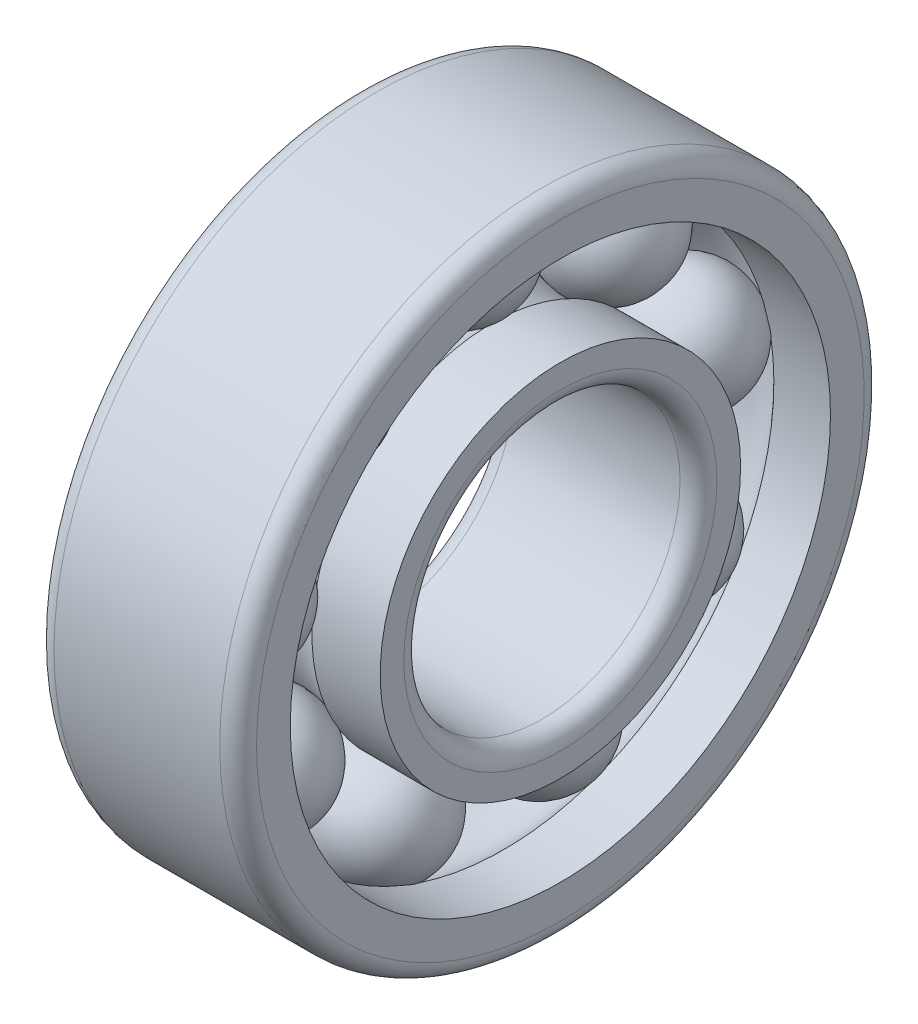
ISO-10303-21;
HEADER;
FILE_DESCRIPTION(('STEP AP214'),'2;1');
FILE_NAME('part.step','',(''),(''),'','','');
FILE_SCHEMA(('AUTOMOTIVE_DESIGN { 1 0 10303 214 1 1 1 1 }'));
ENDSEC;
DATA;
#1=APPLICATION_CONTEXT('core data for automotive mechanical design processes');
#2=APPLICATION_PROTOCOL_DEFINITION('international standard','automotive_design',2000,#1);
#3=PRODUCT_CONTEXT('',#1,'mechanical');
#4=PRODUCT('Part','Part','',(#3));
#5=PRODUCT_RELATED_PRODUCT_CATEGORY('part','',(#4));
#6=PRODUCT_DEFINITION_FORMATION('','',#4);
#7=PRODUCT_DEFINITION_CONTEXT('part definition',#1,'design');
#8=PRODUCT_DEFINITION('design','',#6,#7);
#9=PRODUCT_DEFINITION_SHAPE('','',#8);
#10=(LENGTH_UNIT() NAMED_UNIT(*) SI_UNIT(.MILLI.,.METRE.));
#11=(NAMED_UNIT(*) PLANE_ANGLE_UNIT() SI_UNIT($,.RADIAN.));
#12=(NAMED_UNIT(*) SI_UNIT($,.STERADIAN.) SOLID_ANGLE_UNIT());
#13=UNCERTAINTY_MEASURE_WITH_UNIT(LENGTH_MEASURE(1.E-05),#10,'distance_accuracy_value','');
#14=(GEOMETRIC_REPRESENTATION_CONTEXT(3) GLOBAL_UNCERTAINTY_ASSIGNED_CONTEXT((#13)) GLOBAL_UNIT_ASSIGNED_CONTEXT((#10,
#11,#12)) REPRESENTATION_CONTEXT('',''));
#15=CARTESIAN_POINT('',(0.,0.,0.));
#16=DIRECTION('',(0.,0.,1.));
#17=DIRECTION('',(1.,0.,0.));
#18=AXIS2_PLACEMENT_3D('',#15,#16,#17);
#19=CARTESIAN_POINT('',(0.,0.,0.));
#20=DIRECTION('',(1.,0.,0.));
#21=DIRECTION('',(0.,0.,-1.));
#22=AXIS2_PLACEMENT_3D('',#19,#20,#21);
#23=TOROIDAL_SURFACE('',#22,12.5,3.25443786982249);
#24=CARTESIAN_POINT('',(1.79915821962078,7.26326514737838,-6.56139488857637));
#25=CARTESIAN_POINT('',(1.7228976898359,7.22509448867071,-6.5281588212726));
#26=CARTESIAN_POINT('',(1.64449606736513,7.18936531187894,-6.49704390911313));
#27=CARTESIAN_POINT('',(1.48398656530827,7.12301536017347,-6.43925592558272));
#28=CARTESIAN_POINT('',(1.40187885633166,7.09239435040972,-6.41258265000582));
#29=CARTESIAN_POINT('',(1.23459110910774,7.03650437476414,-6.36389332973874));
#30=CARTESIAN_POINT('',(1.14941351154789,7.01123126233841,-6.34187367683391));
#31=CARTESIAN_POINT('',(0.976564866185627,6.96618504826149,-6.30262323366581));
#32=CARTESIAN_POINT('',(0.888893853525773,6.94641186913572,-6.2853923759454));
#33=CARTESIAN_POINT('',(0.622979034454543,6.89556007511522,-6.24107643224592));
#34=CARTESIAN_POINT('',(0.441751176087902,6.87292178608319,-6.22134408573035));
#35=CARTESIAN_POINT('',(0.0769136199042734,6.85092229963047,-6.20216859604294));
#36=CARTESIAN_POINT('',(-0.10669613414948,6.85156165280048,-6.202725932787));
#37=CARTESIAN_POINT('',(-0.47123513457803,6.87606009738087,-6.22407947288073));
#38=CARTESIAN_POINT('',(-0.65216340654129,6.8999274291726,-6.24488285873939));
#39=CARTESIAN_POINT('',(-1.0060567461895,6.970246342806,-6.30616301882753));
#40=CARTESIAN_POINT('',(-1.1790285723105,7.01667835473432,-6.34662274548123));
#41=CARTESIAN_POINT('',(-1.42435427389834,7.10066869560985,-6.41979028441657));
#42=CARTESIAN_POINT('',(-1.50178700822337,7.13005334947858,-6.44538606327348));
#43=CARTESIAN_POINT('',(-1.65315209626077,7.19332461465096,-6.50049188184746));
#44=CARTESIAN_POINT('',(-1.72709099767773,7.22720231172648,-6.5299941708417));
#45=CARTESIAN_POINT('',(-1.79915821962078,7.26326514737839,-6.56139488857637));
#46=B_SPLINE_CURVE_WITH_KNOTS('',3,(#24,#25,#26,#27,#28,#29,#30,#31,#32,#33,#34,#35,#36,#37,#38,
#39,#40,#41,#42,#43,#44,#45),.UNSPECIFIED.,.F.,.F.,(4,2,2,2,2,2,2,2,2,2,4),(0.,
0.274493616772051,0.548974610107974,0.823241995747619,1.09750551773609,1.64576611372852,
2.19403967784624,2.74250781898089,3.29050113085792,3.55032387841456,3.80963863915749),.UNSPECIFIED.);
#47=CARTESIAN_POINT('',(1.79895821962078,7.26316507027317,-6.56130774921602));
#48=VERTEX_POINT('',#47);
#49=CARTESIAN_POINT('',(-1.79895821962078,7.26316507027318,-6.56130774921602));
#50=VERTEX_POINT('',#49);
#51=EDGE_CURVE('E58',#48,#50,#46,.T.);
#52=ORIENTED_EDGE('',*,*,#51,.F.);
#53=CARTESIAN_POINT('',(1.79895821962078,0.,0.));
#54=DIRECTION('',(1.,0.,0.));
#55=DIRECTION('',(0.,0.,-1.));
#56=AXIS2_PLACEMENT_3D('',#53,#54,#55);
#57=CIRCLE('',#56,9.7879684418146);
#58=CARTESIAN_POINT('',(1.7989582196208,2.05067665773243,-9.57073933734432));
#59=VERTEX_POINT('',#58);
#60=EDGE_CURVE('E283',#59,#48,#57,.T.);
#61=ORIENTED_EDGE('',*,*,#60,.F.);
#62=CARTESIAN_POINT('',(-1.79915821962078,2.05070208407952,-9.57086957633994));
#63=CARTESIAN_POINT('',(-1.7228976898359,2.04100413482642,-9.52119478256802));
#64=CARTESIAN_POINT('',(-1.64449606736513,2.03192241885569,-9.47469495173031));
#65=CARTESIAN_POINT('',(-1.48398656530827,2.01505153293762,-9.3883402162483));
#66=CARTESIAN_POINT('',(-1.40187885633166,2.00726230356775,-9.34848500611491));
#67=CARTESIAN_POINT('',(-1.23459110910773,1.99304110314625,-9.2757382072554));
#68=CARTESIAN_POINT('',(-1.14941351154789,1.98660808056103,-9.24284122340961));
#69=CARTESIAN_POINT('',(-0.976564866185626,1.97513930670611,-9.18420483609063));
#70=CARTESIAN_POINT('',(-0.888893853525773,1.97010353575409,-9.15846533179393));
#71=CARTESIAN_POINT('',(-0.622979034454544,1.9571506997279,-9.09226841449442));
#72=CARTESIAN_POINT('',(-0.441751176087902,1.9513811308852,-9.06279690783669));
#73=CARTESIAN_POINT('',(-0.0769136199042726,1.94577441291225,-9.03415704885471));
#74=CARTESIAN_POINT('',(0.10669613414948,1.94593740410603,-9.03498941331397));
#75=CARTESIAN_POINT('',(0.47123513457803,1.95218088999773,-9.06688245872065));
#76=CARTESIAN_POINT('',(0.65216340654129,1.95826348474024,-9.09795386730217));
#77=CARTESIAN_POINT('',(1.0060567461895,1.97617420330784,-9.18949191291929));
#78=CARTESIAN_POINT('',(1.1790285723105,1.98799734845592,-9.24993307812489));
#79=CARTESIAN_POINT('',(1.42435427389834,2.00936712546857,-9.35925461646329));
#80=CARTESIAN_POINT('',(1.50178700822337,2.01684139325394,-9.39750036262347));
#81=CARTESIAN_POINT('',(1.65315209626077,2.03292879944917,-9.47984779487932));
#82=CARTESIAN_POINT('',(1.72709099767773,2.04153968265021,-9.52393788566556));
#83=CARTESIAN_POINT('',(1.79915821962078,2.05070208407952,-9.57086957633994));
#84=B_SPLINE_CURVE_WITH_KNOTS('',3,(#62,#63,#64,#65,#66,#67,#68,#69,#70,#71,#72,#73,#74,#75,#76,
#77,#78,#79,#80,#81,#82,#83),.UNSPECIFIED.,.F.,.F.,(4,2,2,2,2,2,2,2,2,2,4),(0.,
0.274493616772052,0.548974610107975,0.823241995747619,1.09750551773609,1.64576611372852,
2.19403967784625,2.7425078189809,3.29050113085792,3.55032387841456,3.80963863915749),.UNSPECIFIED.);
#85=CARTESIAN_POINT('',(-1.79895821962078,2.05067665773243,-9.57073933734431));
#86=VERTEX_POINT('',#85);
#87=EDGE_CURVE('E405',#86,#59,#84,.T.);
#88=ORIENTED_EDGE('',*,*,#87,.F.);
#89=CARTESIAN_POINT('',(-1.79895821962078,0.,0.));
#90=DIRECTION('',(1.,0.,0.));
#91=DIRECTION('',(0.,0.,-1.));
#92=AXIS2_PLACEMENT_3D('',#89,#90,#91);
#93=CIRCLE('',#92,9.7879684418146);
#94=EDGE_CURVE('E1047',#86,#50,#93,.T.);
#95=ORIENTED_EDGE('',*,*,#94,.T.);
#96=EDGE_LOOP('',(#52,#61,#88,#95));
#97=FACE_BOUND('',#96,.T.);
#98=ADVANCED_FACE('F36',(#97),#23,.F.);
#99=CARTESIAN_POINT('',(0.,0.,0.));
#100=DIRECTION('',(-1.,0.,0.));
#101=DIRECTION('',(0.,0.,1.));
#102=AXIS2_PLACEMENT_3D('',#99,#100,#101);
#103=TOROIDAL_SURFACE('',#102,12.5,3.25443786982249);
#104=CARTESIAN_POINT('',(2.4257147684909,0.,0.));
#105=DIRECTION('',(-1.,0.,0.));
#106=DIRECTION('',(0.,0.,1.));
#107=AXIS2_PLACEMENT_3D('',#104,#105,#106);
#108=CIRCLE('',#107,14.6696252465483);
#109=CARTESIAN_POINT('',(2.4257147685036,10.9511764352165,-9.76061676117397));
#110=VERTEX_POINT('',#109);
#111=CARTESIAN_POINT('',(2.4257147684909,2.97735385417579,-14.3643053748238));
#112=VERTEX_POINT('',#111);
#113=EDGE_CURVE('E947',#110,#112,#108,.T.);
#114=ORIENTED_EDGE('',*,*,#113,.F.);
#115=CARTESIAN_POINT('',(-2.4259147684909,10.9510072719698,-9.76047045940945));
#116=CARTESIAN_POINT('',(-2.36490667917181,11.0026236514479,-9.8051111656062));
#117=CARTESIAN_POINT('',(-2.30100955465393,11.0522842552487,-9.84805572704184));
#118=CARTESIAN_POINT('',(-2.16791863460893,11.1473623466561,-9.93026808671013));
#119=CARTESIAN_POINT('',(-2.09872509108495,11.1927800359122,-9.96953605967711));
#120=CARTESIAN_POINT('',(-1.95557392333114,11.2790113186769,-10.0440853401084));
#121=CARTESIAN_POINT('',(-1.88162014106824,11.3198285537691,-10.0793698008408));
#122=CARTESIAN_POINT('',(-1.72945753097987,11.3966034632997,-10.1457332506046));
#123=CARTESIAN_POINT('',(-1.65124875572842,11.4325611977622,-10.1768122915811));
#124=CARTESIAN_POINT('',(-1.41096384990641,11.5327753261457,-10.263424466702));
#125=CARTESIAN_POINT('',(-1.24317028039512,11.5894080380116,-10.3123632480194));
#126=CARTESIAN_POINT('',(-0.897507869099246,11.6805149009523,-10.3910875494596));
#127=CARTESIAN_POINT('',(-0.719640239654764,11.71499171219,-10.4208753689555));
#128=CARTESIAN_POINT('',(-0.358758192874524,11.7608699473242,-10.4605131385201));
#129=CARTESIAN_POINT('',(-0.175743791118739,11.7722714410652,-10.4703631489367));
#130=CARTESIAN_POINT('',(0.19021740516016,11.7716556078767,-10.4698311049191));
#131=CARTESIAN_POINT('',(0.373164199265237,11.7596381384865,-10.4594489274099));
#132=CARTESIAN_POINT('',(0.733759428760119,11.7125474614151,-10.4187635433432));
#133=CARTESIAN_POINT('',(0.91140830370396,11.6774761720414,-10.388461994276));
#134=CARTESIAN_POINT('',(1.25650195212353,11.5852187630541,-10.3087431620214));
#135=CARTESIAN_POINT('',(1.42394575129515,11.5280305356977,-10.2593240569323));
#136=CARTESIAN_POINT('',(1.66258423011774,11.427461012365,-10.1724041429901));
#137=CARTESIAN_POINT('',(1.73959050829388,11.3917469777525,-10.141535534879));
#138=CARTESIAN_POINT('',(1.88943692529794,11.3155961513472,-10.0757111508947));
#139=CARTESIAN_POINT('',(1.9622770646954,11.2751593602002,-10.0407553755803));
#140=CARTESIAN_POINT('',(2.10330338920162,11.189820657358,-9.96697742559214));
#141=CARTESIAN_POINT('',(2.17148638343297,11.1449157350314,-9.92815264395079));
#142=CARTESIAN_POINT('',(2.30268910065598,11.0509779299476,-9.84692606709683));
#143=CARTESIAN_POINT('',(2.36570853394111,11.0019448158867,-9.80452407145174));
#144=CARTESIAN_POINT('',(2.4259147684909,10.9510072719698,-9.76047045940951));
#145=B_SPLINE_CURVE_WITH_KNOTS('',3,(#115,#116,#117,#118,#119,#120,#121,#122,#123,#124,#125,
#126,#127,#128,#129,#130,#131,#132,#133,#134,#135,#136,#137,#138,#139,#140,#141,#142,#143,#144),
.UNSPECIFIED.,.F.,.F.,(4,2,2,2,2,2,2,2,2,2,2,2,2,2,4),(0.,0.274521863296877,0.549030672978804,
0.823320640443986,1.09760721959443,1.64595765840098,2.19424224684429,2.74252517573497,
3.29081143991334,3.83905208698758,4.38734499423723,4.65806084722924,4.92877666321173,
5.19967613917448,5.47059080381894),.UNSPECIFIED.);
#146=CARTESIAN_POINT('',(-2.4257147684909,10.9511764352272,-9.76061676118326));
#147=VERTEX_POINT('',#146);
#148=EDGE_CURVE('E355',#147,#110,#145,.T.);
#149=ORIENTED_EDGE('',*,*,#148,.F.);
#150=CARTESIAN_POINT('',(-2.4257147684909,0.,0.));
#151=DIRECTION('',(-1.,0.,0.));
#152=DIRECTION('',(0.,0.,1.));
#153=AXIS2_PLACEMENT_3D('',#150,#151,#152);
#154=CIRCLE('',#153,14.6696252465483);
#155=CARTESIAN_POINT('',(-2.4257147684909,2.97735385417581,-14.3643053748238));
#156=VERTEX_POINT('',#155);
#157=EDGE_CURVE('E935',#147,#156,#154,.T.);
#158=ORIENTED_EDGE('',*,*,#157,.T.);
#159=CARTESIAN_POINT('',(2.4259147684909,2.97731173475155,-14.3640857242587));
#160=CARTESIAN_POINT('',(2.36490667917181,2.99016353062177,-14.4311071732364));
#161=CARTESIAN_POINT('',(2.30100955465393,3.00252430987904,-14.495586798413));
#162=CARTESIAN_POINT('',(2.16791863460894,3.02618325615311,-14.6190330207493));
#163=CARTESIAN_POINT('',(2.09872509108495,3.03748147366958,-14.6779998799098));
#164=CARTESIAN_POINT('',(1.95557392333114,3.05892740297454,-14.7899530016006));
#165=CARTESIAN_POINT('',(1.88162014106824,3.06907602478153,-14.8429439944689));
#166=CARTESIAN_POINT('',(1.72945753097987,3.08816100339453,-14.9426147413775));
#167=CARTESIAN_POINT('',(1.65124875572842,3.09709737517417,-14.9892945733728));
#168=CARTESIAN_POINT('',(1.41096384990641,3.1219986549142,-15.1193886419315));
#169=CARTESIAN_POINT('',(1.24317028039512,3.13606452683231,-15.1929033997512));
#170=CARTESIAN_POINT('',(0.897507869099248,3.15868834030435,-15.3111664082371));
#171=CARTESIAN_POINT('',(0.719640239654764,3.16724694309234,-15.3559181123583));
#172=CARTESIAN_POINT('',(0.358758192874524,3.17863514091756,-15.4154687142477));
#173=CARTESIAN_POINT('',(0.175743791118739,3.18146475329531,-15.4302677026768));
#174=CARTESIAN_POINT('',(-0.19021740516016,3.18131190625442,-15.4294683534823));
#175=CARTESIAN_POINT('',(-0.373164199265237,3.17832941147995,-15.4138698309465));
#176=CARTESIAN_POINT('',(-0.73375942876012,3.16664017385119,-15.352745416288));
#177=CARTESIAN_POINT('',(-0.911408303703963,3.1579339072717,-15.3072220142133));
#178=CARTESIAN_POINT('',(-1.25650195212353,3.13502407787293,-15.1874653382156));
#179=CARTESIAN_POINT('',(-1.42394575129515,3.12081999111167,-15.113229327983));
#180=CARTESIAN_POINT('',(-1.66258423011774,3.09582989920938,-14.9826736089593));
#181=CARTESIAN_POINT('',(-1.73959050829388,3.08695391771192,-14.9363100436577));
#182=CARTESIAN_POINT('',(-1.88943692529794,3.06802374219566,-14.8374493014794));
#183=CARTESIAN_POINT('',(-1.96227706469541,3.05796954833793,-14.7849521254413));
#184=CARTESIAN_POINT('',(-2.10330338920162,3.03674532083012,-14.6741576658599));
#185=CARTESIAN_POINT('',(-2.17148638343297,3.0255745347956,-14.6158564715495));
#186=CARTESIAN_POINT('',(-2.30268910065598,3.00219915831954,-14.4938906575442));
#187=CARTESIAN_POINT('',(-2.36570853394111,2.98999450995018,-14.4302257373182));
#188=CARTESIAN_POINT('',(-2.4259147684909,2.97731173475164,-14.3640857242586));
#189=B_SPLINE_CURVE_WITH_KNOTS('',3,(#159,#160,#161,#162,#163,#164,#165,#166,#167,#168,#169,
#170,#171,#172,#173,#174,#175,#176,#177,#178,#179,#180,#181,#182,#183,#184,#185,#186,#187,#188),
.UNSPECIFIED.,.F.,.F.,(4,2,2,2,2,2,2,2,2,2,2,2,2,2,4),(0.,0.274521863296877,0.549030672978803,
0.823320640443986,1.09760721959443,1.64595765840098,2.19424224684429,2.74252517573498,
3.29081143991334,3.83905208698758,4.38734499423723,4.65806084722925,4.92877666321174,
5.19967613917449,5.47059080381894),.UNSPECIFIED.);
#190=EDGE_CURVE('E411',#112,#156,#189,.T.);
#191=ORIENTED_EDGE('',*,*,#190,.F.);
#192=EDGE_LOOP('',(#114,#149,#158,#191));
#193=FACE_BOUND('',#192,.T.);
#194=ADVANCED_FACE('F851',(#193),#103,.F.);
#195=CARTESIAN_POINT('',(1.79915821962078,1.34640056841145,-9.6950569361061));
#196=CARTESIAN_POINT('',(1.7228976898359,1.33852387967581,-9.64506100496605));
#197=CARTESIAN_POINT('',(1.64449606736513,1.33115402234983,-9.59825932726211));
#198=CARTESIAN_POINT('',(1.48398656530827,1.31747241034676,-9.51134223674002));
#199=CARTESIAN_POINT('',(1.40187885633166,1.31116060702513,-9.47122651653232));
#200=CARTESIAN_POINT('',(1.23459110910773,1.29964329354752,-9.39800294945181));
#201=CARTESIAN_POINT('',(1.14941351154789,1.29443692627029,-9.36488967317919));
#202=CARTESIAN_POINT('',(0.976564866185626,1.28515922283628,-9.30586694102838));
#203=CARTESIAN_POINT('',(0.888893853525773,1.28108787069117,-9.27995738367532));
#204=CARTESIAN_POINT('',(0.622979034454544,1.27061887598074,-9.21332249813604));
#205=CARTESIAN_POINT('',(0.441751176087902,1.26596064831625,-9.18365503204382));
#206=CARTESIAN_POINT('',(0.0769136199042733,1.26143383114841,-9.15482475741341));
#207=CARTESIAN_POINT('',(-0.10669613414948,1.261565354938,-9.15566267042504));
#208=CARTESIAN_POINT('',(-0.47123513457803,1.26660646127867,-9.18776772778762));
#209=CARTESIAN_POINT('',(-0.652163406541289,1.2715177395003,-9.21904567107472));
#210=CARTESIAN_POINT('',(-1.0060567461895,1.28599502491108,-9.31118912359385));
#211=CARTESIAN_POINT('',(-1.1790285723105,1.29555699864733,-9.37202899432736));
#212=CARTESIAN_POINT('',(-1.42435427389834,1.31286614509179,-9.48206653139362));
#213=CARTESIAN_POINT('',(-1.50178700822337,1.31892344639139,-9.520562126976));
#214=CARTESIAN_POINT('',(-1.65315209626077,1.3319707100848,-9.60344561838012));
#215=CARTESIAN_POINT('',(-1.72709099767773,1.33895882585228,-9.64782184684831));
#216=CARTESIAN_POINT('',(-1.79915821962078,1.34640056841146,-9.6950569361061));
#217=B_SPLINE_CURVE_WITH_KNOTS('',3,(#195,#196,#197,#198,#199,#200,#201,#202,#203,#204,#205,
#206,#207,#208,#209,#210,#211,#212,#213,#214,#215,#216),.UNSPECIFIED.,.F.,.F.,(4,2,2,2,2,2,2,2,
2,2,4),(0.,0.274493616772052,0.548974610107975,0.823241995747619,1.09750551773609,
1.64576611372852,2.19403967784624,2.74250781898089,3.29050113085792,3.55032387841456,
3.80963863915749),.UNSPECIFIED.);
#218=CARTESIAN_POINT('',(1.79895821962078,1.34637991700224,-9.69492585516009));
#219=VERTEX_POINT('',#218);
#220=CARTESIAN_POINT('',(-1.79895821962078,1.34637991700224,-9.69492585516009));
#221=VERTEX_POINT('',#220);
#222=EDGE_CURVE('E389',#219,#221,#217,.T.);
#223=ORIENTED_EDGE('',*,*,#222,.F.);
#224=CARTESIAN_POINT('',(1.7989582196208,-4.58104320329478,-8.64976123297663));
#225=VERTEX_POINT('',#224);
#226=EDGE_CURVE('E1418',#225,#219,#57,.T.);
#227=ORIENTED_EDGE('',*,*,#226,.F.);
#228=CARTESIAN_POINT('',(-1.79915821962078,-4.58110744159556,-8.64987734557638));
#229=CARTESIAN_POINT('',(-1.7228976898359,-4.55660615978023,-8.60559052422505));
#230=CARTESIAN_POINT('',(-1.64449606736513,-4.53367364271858,-8.56413197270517));
#231=CARTESIAN_POINT('',(-1.48398656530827,-4.49108973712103,-8.4871360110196));
#232=CARTESIAN_POINT('',(-1.40187885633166,-4.47143819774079,-8.45159832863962));
#233=CARTESIAN_POINT('',(-1.23459110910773,-4.43557152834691,-8.38672983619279));
#234=CARTESIAN_POINT('',(-1.14941351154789,-4.41935373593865,-8.35739421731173));
#235=CARTESIAN_POINT('',(-0.976564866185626,-4.39044858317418,-8.30510415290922));
#236=CARTESIAN_POINT('',(-0.888893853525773,-4.3777611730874,-8.28214961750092));
#237=CARTESIAN_POINT('',(-0.622979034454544,-4.34513306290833,-8.22311391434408));
#238=CARTESIAN_POINT('',(-0.441751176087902,-4.33060888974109,-8.19682882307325));
#239=CARTESIAN_POINT('',(-0.0769136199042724,-4.31649453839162,-8.17128548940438));
#240=CARTESIAN_POINT('',(0.106696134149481,-4.31690471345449,-8.1720278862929));
#241=CARTESIAN_POINT('',(0.47123513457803,-4.33262238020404,-8.20047261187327));
#242=CARTESIAN_POINT('',(0.65216340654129,-4.34793515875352,-8.22818450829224));
#243=CARTESIAN_POINT('',(1.0060567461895,-4.39305427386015,-8.30981950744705));
#244=CARTESIAN_POINT('',(1.1790285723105,-4.42284805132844,-8.36371989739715));
#245=CARTESIAN_POINT('',(1.42435427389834,-4.47674838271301,-8.46120128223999));
#246=CARTESIAN_POINT('',(1.50178700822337,-4.49560665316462,-8.49530359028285));
#247=CARTESIAN_POINT('',(1.65315209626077,-4.53621489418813,-8.56872616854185));
#248=CARTESIAN_POINT('',(1.72709099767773,-4.55795913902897,-8.60803610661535));
#249=CARTESIAN_POINT('',(1.79915821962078,-4.58110744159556,-8.64987734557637));
#250=B_SPLINE_CURVE_WITH_KNOTS('',3,(#228,#229,#230,#231,#232,#233,#234,#235,#236,#237,#238,
#239,#240,#241,#242,#243,#244,#245,#246,#247,#248,#249),.UNSPECIFIED.,.F.,.F.,(4,2,2,2,2,2,2,2,
2,2,4),(0.,0.27449361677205,0.548974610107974,0.823241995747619,1.09750551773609,
1.64576611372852,2.19403967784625,2.7425078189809,3.29050113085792,3.55032387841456,
3.80963863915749),.UNSPECIFIED.);
#251=CARTESIAN_POINT('',(-1.79895821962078,-4.58104320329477,-8.64976123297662));
#252=VERTEX_POINT('',#251);
#253=EDGE_CURVE('E474',#252,#225,#250,.T.);
#254=ORIENTED_EDGE('',*,*,#253,.F.);
#255=EDGE_CURVE('E1049',#252,#221,#93,.T.);
#256=ORIENTED_EDGE('',*,*,#255,.T.);
#257=EDGE_LOOP('',(#223,#227,#254,#256));
#258=FACE_BOUND('',#257,.T.);
#259=ADVANCED_FACE('F975',(#258),#23,.F.);
#260=CARTESIAN_POINT('',(2.4257147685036,2.11508433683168,-14.5163467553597));
#261=VERTEX_POINT('',#260);
#262=CARTESIAN_POINT('',(2.4257147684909,-6.95241214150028,-12.9175024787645));
#263=VERTEX_POINT('',#262);
#264=EDGE_CURVE('E951',#261,#263,#108,.T.);
#265=ORIENTED_EDGE('',*,*,#264,.F.);
#266=CARTESIAN_POINT('',(-2.4259147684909,2.11504879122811,-14.5161259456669));
#267=CARTESIAN_POINT('',(-2.36490667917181,2.1258947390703,-14.5835010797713));
#268=CARTESIAN_POINT('',(-2.30100955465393,2.13633273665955,-14.6483197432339));
#269=CARTESIAN_POINT('',(-2.16791863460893,2.1563216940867,-14.7724130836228));
#270=CARTESIAN_POINT('',(-2.09872509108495,2.16587269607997,-14.8316880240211));
#271=CARTESIAN_POINT('',(-1.95557392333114,2.18401033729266,-14.9442244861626));
#272=CARTESIAN_POINT('',(-1.88162014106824,2.19259773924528,-14.997490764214));
#273=CARTESIAN_POINT('',(-1.72945753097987,2.20875312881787,-15.0976780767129));
#274=CARTESIAN_POINT('',(-1.65124875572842,2.21632112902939,-15.1445991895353));
#275=CARTESIAN_POINT('',(-1.41096384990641,2.23741637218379,-15.2753643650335));
#276=CARTESIAN_POINT('',(-1.24317028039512,2.2493423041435,-15.349256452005));
#277=CARTESIAN_POINT('',(-0.897507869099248,2.26853120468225,-15.4681251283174));
#278=CARTESIAN_POINT('',(-0.719640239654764,2.27579473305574,-15.513105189));
#279=CARTESIAN_POINT('',(-0.358758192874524,2.28546083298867,-15.5729594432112));
#280=CARTESIAN_POINT('',(-0.175743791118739,2.28786341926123,-15.5878337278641));
#281=CARTESIAN_POINT('',(0.19021740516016,2.28773365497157,-15.5870303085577));
#282=CARTESIAN_POINT('',(0.373164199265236,2.2852012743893,-15.5713524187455));
#283=CARTESIAN_POINT('',(0.73375942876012,2.27527978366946,-15.5099163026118));
#284=CARTESIAN_POINT('',(0.911408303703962,2.26789107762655,-15.4641605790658));
#285=CARTESIAN_POINT('',(1.25650195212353,2.2484600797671,-15.3437904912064));
#286=CARTESIAN_POINT('',(1.42394575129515,2.23641734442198,-15.2691733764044));
#287=CARTESIAN_POINT('',(1.66258423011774,2.21524766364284,-15.1379440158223));
#288=CARTESIAN_POINT('',(1.73959050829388,2.2077310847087,-15.0913407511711));
#289=CARTESIAN_POINT('',(1.88943692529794,2.19170726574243,-14.9919675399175));
#290=CARTESIAN_POINT('',(1.96227706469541,2.18320002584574,-14.9391975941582));
#291=CARTESIAN_POINT('',(2.10330338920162,2.16525033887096,-14.8278257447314));
#292=CARTESIAN_POINT('',(2.17148638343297,2.15580726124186,-14.7692199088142));
#293=CARTESIAN_POINT('',(2.30268910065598,2.13605816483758,-14.6466146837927));
#294=CARTESIAN_POINT('',(2.36570853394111,2.12575209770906,-14.5826149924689));
#295=CARTESIAN_POINT('',(2.4259147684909,2.11504879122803,-14.516125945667));
#296=B_SPLINE_CURVE_WITH_KNOTS('',3,(#266,#267,#268,#269,#270,#271,#272,#273,#274,#275,#276,
#277,#278,#279,#280,#281,#282,#283,#284,#285,#286,#287,#288,#289,#290,#291,#292,#293,#294,#295),
.UNSPECIFIED.,.F.,.F.,(4,2,2,2,2,2,2,2,2,2,2,2,2,2,4),(0.,0.274521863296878,0.549030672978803,
0.823320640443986,1.09760721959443,1.64595765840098,2.19424224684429,2.74252517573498,
3.29081143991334,3.83905208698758,4.38734499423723,4.65806084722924,4.92877666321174,
5.19967613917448,5.47059080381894),.UNSPECIFIED.);
#297=CARTESIAN_POINT('',(-2.4257147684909,2.11508433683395,-14.5163467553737));
#298=VERTEX_POINT('',#297);
#299=EDGE_CURVE('E424',#298,#261,#296,.T.);
#300=ORIENTED_EDGE('',*,*,#299,.F.);
#301=CARTESIAN_POINT('',(-2.4257147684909,-6.95241214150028,-12.9175024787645));
#302=VERTEX_POINT('',#301);
#303=EDGE_CURVE('E940',#298,#302,#154,.T.);
#304=ORIENTED_EDGE('',*,*,#303,.T.);
#305=CARTESIAN_POINT('',(2.4259147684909,-6.95230321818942,-12.9173071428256));
#306=CARTESIAN_POINT('',(2.36490667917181,-6.98553872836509,-12.9769095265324));
#307=CARTESIAN_POINT('',(2.30100955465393,-7.01751652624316,-13.0342491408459));
#308=CARTESIAN_POINT('',(2.16791863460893,-7.07874242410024,-13.1440221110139));
#309=CARTESIAN_POINT('',(2.09872509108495,-7.10799065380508,-13.1964557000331));
#310=CARTESIAN_POINT('',(1.95557392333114,-7.1635241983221,-13.2960019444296));
#311=CARTESIAN_POINT('',(1.88162014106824,-7.18981185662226,-13.3431188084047));
#312=CARTESIAN_POINT('',(1.72945753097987,-7.23925903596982,-13.4317386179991));
#313=CARTESIAN_POINT('',(1.65124875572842,-7.26241859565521,-13.4732416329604));
#314=CARTESIAN_POINT('',(1.41096384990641,-7.32696596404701,-13.5889057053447));
#315=CARTESIAN_POINT('',(1.24317028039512,-7.36344525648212,-13.6542626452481));
#316=CARTESIAN_POINT('',(0.897507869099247,-7.42213240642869,-13.759399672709));
#317=CARTESIAN_POINT('',(0.719640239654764,-7.44434197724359,-13.7991828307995));
#318=CARTESIAN_POINT('',(0.358758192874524,-7.47389650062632,-13.8521214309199));
#319=CARTESIAN_POINT('',(0.175743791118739,-7.48124149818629,-13.8652769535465));
#320=CARTESIAN_POINT('',(-0.19021740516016,-7.48084477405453,-13.8645663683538));
#321=CARTESIAN_POINT('',(-0.373164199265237,-7.47310296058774,-13.8507000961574));
#322=CARTESIAN_POINT('',(-0.73375942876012,-7.44276741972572,-13.7963623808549));
#323=CARTESIAN_POINT('',(-0.911408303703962,-7.42017492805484,-13.7558931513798));
#324=CARTESIAN_POINT('',(-1.25650195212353,-7.36074676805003,-13.6494280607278));
#325=CARTESIAN_POINT('',(-1.42394575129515,-7.32390974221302,-13.5834297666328));
#326=CARTESIAN_POINT('',(-1.66258423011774,-7.25913366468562,-13.4673549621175));
#327=CARTESIAN_POINT('',(-1.73959050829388,-7.23613113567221,-13.4261330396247));
#328=CARTESIAN_POINT('',(-1.88943692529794,-7.18708603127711,-13.3382332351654));
#329=CARTESIAN_POINT('',(-1.96227706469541,-7.16104345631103,-13.2915553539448));
#330=CARTESIAN_POINT('',(-2.10330338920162,-7.10608485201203,-13.1930392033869));
#331=CARTESIAN_POINT('',(-2.17148638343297,-7.07716688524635,-13.1411974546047));
#332=CARTESIAN_POINT('',(-2.30268910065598,-7.01667534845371,-13.0327408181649));
#333=CARTESIAN_POINT('',(-2.36570853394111,-6.98510162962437,-12.9761256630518));
#334=CARTESIAN_POINT('',(-2.4259147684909,-6.95230321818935,-12.9173071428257));
#335=B_SPLINE_CURVE_WITH_KNOTS('',3,(#305,#306,#307,#308,#309,#310,#311,#312,#313,#314,#315,
#316,#317,#318,#319,#320,#321,#322,#323,#324,#325,#326,#327,#328,#329,#330,#331,#332,#333,#334),
.UNSPECIFIED.,.F.,.F.,(4,2,2,2,2,2,2,2,2,2,2,2,2,2,4),(0.,0.274521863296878,0.549030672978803,
0.823320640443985,1.09760721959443,1.64595765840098,2.19424224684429,2.74252517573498,
3.29081143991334,3.83905208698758,4.38734499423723,4.65806084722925,4.92877666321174,
5.19967613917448,5.47059080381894),.UNSPECIFIED.);
#336=EDGE_CURVE('E480',#263,#302,#335,.T.);
#337=ORIENTED_EDGE('',*,*,#336,.F.);
#338=EDGE_LOOP('',(#265,#300,#304,#337));
#339=FACE_BOUND('',#338,.T.);
#340=ADVANCED_FACE('F980',(#339),#103,.F.);
#341=CARTESIAN_POINT('',(1.79915821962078,-5.20045980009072,-8.29229409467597));
#342=CARTESIAN_POINT('',(1.7228976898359,-5.17435692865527,-8.24893195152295));
#343=CARTESIAN_POINT('',(1.64449606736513,-5.14991902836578,-8.20834253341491));
#344=CARTESIAN_POINT('',(1.48398656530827,-5.10453052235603,-8.13296580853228));
#345=CARTESIAN_POINT('',(1.40187885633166,-5.08357975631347,-8.09817823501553));
#346=CARTESIAN_POINT('',(1.23459110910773,-5.04533532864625,-8.03468254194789));
#347=CARTESIAN_POINT('',(1.14941351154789,-5.02803883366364,-8.0059697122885));
#348=CARTESIAN_POINT('',(0.976564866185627,-4.99720688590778,-7.95479208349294));
#349=CARTESIAN_POINT('',(0.888893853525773,-4.98367138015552,-7.9323271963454));
#350=CARTESIAN_POINT('',(0.622979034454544,-4.94885901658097,-7.87455257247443));
#351=CARTESIAN_POINT('',(0.441751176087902,-4.93335754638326,-7.84883172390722));
#352=CARTESIAN_POINT('',(0.076913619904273,-4.91829354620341,-7.82383667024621));
#353=CARTESIAN_POINT('',(-0.10669613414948,-4.91873139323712,-7.82456309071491));
#354=CARTESIAN_POINT('',(-0.47123513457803,-4.93550641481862,-7.85239735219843));
#355=CARTESIAN_POINT('',(-0.65216340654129,-4.95184923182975,-7.87951455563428));
#356=CARTESIAN_POINT('',(-1.0060567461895,-4.99998765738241,-7.95940635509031));
#357=CARTESIAN_POINT('',(-1.1790285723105,-5.03176987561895,-8.0121587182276));
#358=CARTESIAN_POINT('',(-1.42435427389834,-5.08924106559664,-8.10757846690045));
#359=CARTESIAN_POINT('',(-1.50178700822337,-5.10934539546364,-8.14096136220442));
#360=CARTESIAN_POINT('',(-1.65315209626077,-5.15262709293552,-8.21284041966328));
#361=CARTESIAN_POINT('',(-1.72709099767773,-5.17579837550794,-8.25132645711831));
#362=CARTESIAN_POINT('',(-1.79915821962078,-5.20045980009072,-8.29229409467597));
#363=B_SPLINE_CURVE_WITH_KNOTS('',3,(#341,#342,#343,#344,#345,#346,#347,#348,#349,#350,#351,
#352,#353,#354,#355,#356,#357,#358,#359,#360,#361,#362),.UNSPECIFIED.,.F.,.F.,(4,2,2,2,2,2,2,2,
2,2,4),(0.,0.274493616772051,0.548974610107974,0.823241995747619,1.09750551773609,
1.64576611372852,2.19403967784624,2.74250781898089,3.29050113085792,3.55032387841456,
3.80963863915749),.UNSPECIFIED.);
#364=CARTESIAN_POINT('',(1.79895821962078,-5.20039136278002,-8.29218040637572));
#365=VERTEX_POINT('',#364);
#366=CARTESIAN_POINT('',(-1.79895821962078,-5.20039136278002,-8.29218040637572));
#367=VERTEX_POINT('',#366);
#368=EDGE_CURVE('E458',#365,#367,#363,.T.);
#369=ORIENTED_EDGE('',*,*,#368,.F.);
#370=CARTESIAN_POINT('',(1.7989582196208,-9.06924203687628,-3.68146371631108));
#371=VERTEX_POINT('',#370);
#372=EDGE_CURVE('E1409',#371,#365,#57,.T.);
#373=ORIENTED_EDGE('',*,*,#372,.F.);
#374=CARTESIAN_POINT('',(-1.79915821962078,-9.06936588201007,-3.68151137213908));
#375=CARTESIAN_POINT('',(-1.7228976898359,-9.0221297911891,-3.66333481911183));
#376=CARTESIAN_POINT('',(-1.64449606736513,-8.97791342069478,-3.64631646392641));
#377=CARTESIAN_POINT('',(-1.48398656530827,-8.89580020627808,-3.61470654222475));
#378=CARTESIAN_POINT('',(-1.40187885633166,-8.85790307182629,-3.60011486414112));
#379=CARTESIAN_POINT('',(-1.23459110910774,-8.78873094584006,-3.57347736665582));
#380=CARTESIAN_POINT('',(-1.14941351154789,-8.75745082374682,-3.56142957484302));
#381=CARTESIAN_POINT('',(-0.976564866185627,-8.70169678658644,-3.53995293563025));
#382=CARTESIAN_POINT('',(-0.888893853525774,-8.67722277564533,-3.53052405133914));
#383=CARTESIAN_POINT('',(-0.622979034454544,-8.61428077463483,-3.50627302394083));
#384=CARTESIAN_POINT('',(-0.441751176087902,-8.5862588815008,-3.49547343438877));
#385=CARTESIAN_POINT('',(-0.0769136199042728,-8.55902772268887,-3.4849786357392));
#386=CARTESIAN_POINT('',(0.10669613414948,-8.5598191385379,-3.48528368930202));
#387=CARTESIAN_POINT('',(0.471235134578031,-8.59014348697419,-3.49697049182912));
#388=CARTESIAN_POINT('',(0.65216340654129,-8.61968661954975,-3.50835617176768));
#389=CARTESIAN_POINT('',(1.0060567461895,-8.70672383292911,-3.54189020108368));
#390=CARTESIAN_POINT('',(1.1790285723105,-8.76419369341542,-3.56402922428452));
#391=CARTESIAN_POINT('',(1.42435427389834,-8.8681435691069,-3.60405783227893));
#392=CARTESIAN_POINT('',(1.50178700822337,-8.90451038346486,-3.61805985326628));
#393=CARTESIAN_POINT('',(1.65315209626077,-8.98281322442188,-3.64820233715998));
#394=CARTESIAN_POINT('',(1.72709099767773,-9.02473822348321,-3.66433856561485));
#395=CARTESIAN_POINT('',(1.79915821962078,-9.06936588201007,-3.68151137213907));
#396=B_SPLINE_CURVE_WITH_KNOTS('',3,(#374,#375,#376,#377,#378,#379,#380,#381,#382,#383,#384,
#385,#386,#387,#388,#389,#390,#391,#392,#393,#394,#395),.UNSPECIFIED.,.F.,.F.,(4,2,2,2,2,2,2,2,
2,2,4),(0.,0.274493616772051,0.548974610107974,0.823241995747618,1.09750551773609,
1.64576611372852,2.19403967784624,2.74250781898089,3.29050113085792,3.55032387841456,
3.80963863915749),.UNSPECIFIED.);
#397=CARTESIAN_POINT('',(-1.79895821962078,-9.06924203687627,-3.68146371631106));
#398=VERTEX_POINT('',#397);
#399=EDGE_CURVE('E543',#398,#371,#396,.T.);
#400=ORIENTED_EDGE('',*,*,#399,.F.);
#401=EDGE_CURVE('E1412',#398,#367,#93,.T.);
#402=ORIENTED_EDGE('',*,*,#401,.T.);
#403=EDGE_LOOP('',(#369,#373,#400,#402));
#404=FACE_BOUND('',#403,.T.);
#405=ADVANCED_FACE('F983',(#404),#23,.F.);
#406=CARTESIAN_POINT('',(2.4257147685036,-7.71067922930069,-12.4797167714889));
#407=VERTEX_POINT('',#406);
#408=CARTESIAN_POINT('',(2.4257147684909,-13.6290672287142,-5.42645661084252));
#409=VERTEX_POINT('',#408);
#410=EDGE_CURVE('E1384',#407,#409,#108,.T.);
#411=ORIENTED_EDGE('',*,*,#410,.F.);
#412=CARTESIAN_POINT('',(-2.4259147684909,-7.71056452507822,-12.4795247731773));
#413=CARTESIAN_POINT('',(-2.36490667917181,-7.74556394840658,-12.5381087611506));
#414=CARTESIAN_POINT('',(-2.30100955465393,-7.77923261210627,-12.5944721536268));
#415=CARTESIAN_POINT('',(-2.16791863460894,-7.84368584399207,-12.7023818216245));
#416=CARTESIAN_POINT('',(-2.09872509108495,-7.87447054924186,-12.7539283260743));
#417=CARTESIAN_POINT('',(-1.95557392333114,-7.93291335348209,-12.8517949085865));
#418=CARTESIAN_POINT('',(-1.88162014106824,-7.96057392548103,-12.8981191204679));
#419=CARTESIAN_POINT('',(-1.72945753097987,-8.0125973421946,-12.9852515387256));
#420=CARTESIAN_POINT('',(-1.65124875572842,-8.03696022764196,-13.0260598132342));
#421=CARTESIAN_POINT('',(-1.41096384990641,-8.10485456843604,-13.1397915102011));
#422=CARTESIAN_POINT('',(-1.24317028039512,-8.14321569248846,-13.2040619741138));
#423=CARTESIAN_POINT('',(-0.897507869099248,-8.20492345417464,-13.3074550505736));
#424=CARTESIAN_POINT('',(-0.719640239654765,-8.22827189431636,-13.3465806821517));
#425=CARTESIAN_POINT('',(-0.358758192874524,-8.2593408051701,-13.3986449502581));
#426=CARTESIAN_POINT('',(-0.175743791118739,-8.26706132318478,-13.4115836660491));
#427=CARTESIAN_POINT('',(0.19021740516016,-8.26664430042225,-13.4108848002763));
#428=CARTESIAN_POINT('',(0.373164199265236,-8.25850666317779,-13.3972470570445));
#429=CARTESIAN_POINT('',(0.73375942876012,-8.22661659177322,-13.3438068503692));
#430=CARTESIAN_POINT('',(0.911408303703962,-8.20286545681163,-13.3040065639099));
#431=CARTESIAN_POINT('',(1.25650195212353,-8.14037806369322,-13.1993077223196));
#432=CARTESIAN_POINT('',(1.42394575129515,-8.10164037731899,-13.1344067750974));
#433=CARTESIAN_POINT('',(1.66258423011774,-8.03350468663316,-13.0202716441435));
#434=CARTESIAN_POINT('',(1.73959050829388,-8.00930671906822,-12.9797399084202));
#435=CARTESIAN_POINT('',(1.88943692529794,-7.95770580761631,-12.8933156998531));
#436=CARTESIAN_POINT('',(1.96227706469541,-7.93030286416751,-12.8474232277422));
#437=CARTESIAN_POINT('',(2.10330338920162,-7.87246467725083,-12.7505696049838));
#438=CARTESIAN_POINT('',(2.17148638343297,-7.8420273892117,-12.6996050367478));
#439=CARTESIAN_POINT('',(2.30268910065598,-7.77834695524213,-12.5929895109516));
#440=CARTESIAN_POINT('',(2.36570853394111,-7.74510365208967,-12.5373382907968));
#441=CARTESIAN_POINT('',(2.4259147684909,-7.71056452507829,-12.4795247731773));
#442=B_SPLINE_CURVE_WITH_KNOTS('',3,(#412,#413,#414,#415,#416,#417,#418,#419,#420,#421,#422,
#423,#424,#425,#426,#427,#428,#429,#430,#431,#432,#433,#434,#435,#436,#437,#438,#439,#440,#441),
.UNSPECIFIED.,.F.,.F.,(4,2,2,2,2,2,2,2,2,2,2,2,2,2,4),(0.,0.274521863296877,0.549030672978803,
0.823320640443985,1.09760721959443,1.64595765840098,2.19424224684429,2.74252517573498,
3.29081143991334,3.83905208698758,4.38734499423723,4.65806084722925,4.92877666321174,
5.19967613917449,5.47059080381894),.UNSPECIFIED.);
#443=CARTESIAN_POINT('',(-2.4257147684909,-7.71067922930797,-12.4797167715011));
#444=VERTEX_POINT('',#443);
#445=EDGE_CURVE('E493',#444,#407,#442,.T.);
#446=ORIENTED_EDGE('',*,*,#445,.F.);
#447=CARTESIAN_POINT('',(-2.4257147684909,-13.6290672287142,-5.42645661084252));
#448=VERTEX_POINT('',#447);
#449=EDGE_CURVE('E1455',#444,#448,#154,.T.);
#450=ORIENTED_EDGE('',*,*,#449,.T.);
#451=CARTESIAN_POINT('',(2.4259147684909,-13.6288582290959,-5.4263769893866));
#452=CARTESIAN_POINT('',(2.36490667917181,-13.6926297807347,-5.45067169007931));
#453=CARTESIAN_POINT('',(2.30100955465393,-13.7539833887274,-5.4740414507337));
#454=CARTESIAN_POINT('',(2.16791863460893,-13.8714458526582,-5.51877717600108));
#455=CARTESIAN_POINT('',(2.09872509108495,-13.9275549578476,-5.54014323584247));
#456=CARTESIAN_POINT('',(1.95557392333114,-14.0340832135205,-5.58070380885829));
#457=CARTESIAN_POINT('',(1.88162014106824,-14.0845068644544,-5.59990003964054));
#458=CARTESIAN_POINT('',(1.72945753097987,-14.1793493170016,-5.63600271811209));
#459=CARTESIAN_POINT('',(1.65124875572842,-14.2237681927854,-5.65290919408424));
#460=CARTESIAN_POINT('',(1.41096384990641,-14.3475617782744,-5.70002276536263));
#461=CARTESIAN_POINT('',(1.24317028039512,-14.4175171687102,-5.72664064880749));
#462=CARTESIAN_POINT('',(0.897507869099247,-14.5300549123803,-5.76945691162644));
#463=CARTESIAN_POINT('',(0.719640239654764,-14.5726405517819,-5.78565654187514));
#464=CARTESIAN_POINT('',(0.358758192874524,-14.6293089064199,-5.80721258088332));
#465=CARTESIAN_POINT('',(0.175743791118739,-14.6433917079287,-5.812569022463));
#466=CARTESIAN_POINT('',(-0.19021740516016,-14.6426310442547,-5.81227969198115));
#467=CARTESIAN_POINT('',(-0.373164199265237,-14.6277874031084,-5.80663385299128));
#468=CARTESIAN_POINT('',(-0.733759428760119,-14.5696214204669,-5.78450805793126));
#469=CARTESIAN_POINT('',(-0.911408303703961,-14.526301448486,-5.76802900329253));
#470=CARTESIAN_POINT('',(-1.25650195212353,-14.4123423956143,-5.72467169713));
#471=CARTESIAN_POINT('',(-1.42394575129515,-14.3417007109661,-5.69779245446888));
#472=CARTESIAN_POINT('',(-1.66258423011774,-14.21746791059,-5.65051125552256));
#473=CARTESIAN_POINT('',(-1.73959050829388,-14.1733500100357,-5.63371917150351));
#474=CARTESIAN_POINT('',(-1.88943692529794,-14.0792783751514,-5.59790960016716));
#475=CARTESIAN_POINT('',(-1.9622770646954,-14.0293246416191,-5.5788921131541));
#476=CARTESIAN_POINT('',(-2.10330338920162,-13.9238989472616,-5.53875107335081));
#477=CARTESIAN_POINT('',(-2.17148638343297,-13.8684232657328,-5.51762610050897));
#478=CARTESIAN_POINT('',(-2.30268910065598,-13.7523694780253,-5.47342670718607));
#479=CARTESIAN_POINT('',(-2.36570853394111,-13.6917910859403,-5.4503521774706));
#480=CARTESIAN_POINT('',(-2.4259147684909,-13.6288582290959,-5.42637698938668));
#481=B_SPLINE_CURVE_WITH_KNOTS('',3,(#451,#452,#453,#454,#455,#456,#457,#458,#459,#460,#461,
#462,#463,#464,#465,#466,#467,#468,#469,#470,#471,#472,#473,#474,#475,#476,#477,#478,#479,#480),
.UNSPECIFIED.,.F.,.F.,(4,2,2,2,2,2,2,2,2,2,2,2,2,2,4),(0.,0.274521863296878,0.549030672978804,
0.823320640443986,1.09760721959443,1.64595765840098,2.19424224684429,2.74252517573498,
3.29081143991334,3.83905208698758,4.38734499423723,4.65806084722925,4.92877666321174,
5.19967613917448,5.47059080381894),.UNSPECIFIED.);
#482=EDGE_CURVE('E549',#409,#448,#481,.T.);
#483=ORIENTED_EDGE('',*,*,#482,.F.);
#484=EDGE_LOOP('',(#411,#446,#450,#483));
#485=FACE_BOUND('',#484,.T.);
#486=ADVANCED_FACE('F1175',(#485),#103,.F.);
#487=CARTESIAN_POINT('',(1.79915821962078,-9.31396723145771,-3.00947468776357));
#488=CARTESIAN_POINT('',(1.7228976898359,-9.26609862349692,-2.99303596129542));
#489=CARTESIAN_POINT('',(1.64449606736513,-9.22128773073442,-2.97765104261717));
#490=CARTESIAN_POINT('',(1.48398656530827,-9.13806689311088,-2.94908429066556));
#491=CARTESIAN_POINT('',(1.40187885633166,-9.09965665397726,-2.93590235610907));
#492=CARTESIAN_POINT('',(1.23459110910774,-9.02954547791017,-2.91184487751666));
#493=CARTESIAN_POINT('',(1.14941351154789,-8.99783934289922,-2.90096754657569));
#494=CARTESIAN_POINT('',(0.976564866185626,-8.94132435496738,-2.88158160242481));
#495=CARTESIAN_POINT('',(0.888893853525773,-8.91651540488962,-2.87307295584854));
#496=CARTESIAN_POINT('',(0.622979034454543,-8.85271077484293,-2.85119198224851));
#497=CARTESIAN_POINT('',(0.441751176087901,-8.82430291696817,-2.84145282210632));
#498=CARTESIAN_POINT('',(0.0769136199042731,-8.79669671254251,-2.83198845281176));
#499=CARTESIAN_POINT('',(-0.10669613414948,-8.79749905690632,-2.83226348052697));
#500=CARTESIAN_POINT('',(-0.47123513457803,-8.82824098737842,-2.84280298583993));
#501=CARTESIAN_POINT('',(-0.65216340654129,-8.85819091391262,-2.85307100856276));
#502=CARTESIAN_POINT('',(-1.0060567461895,-8.94642054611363,-2.88332889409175));
#503=CARTESIAN_POINT('',(-1.1790285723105,-9.00467570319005,-2.90331033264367));
#504=CARTESIAN_POINT('',(-1.42435427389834,-9.11003582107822,-2.93946433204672));
#505=CARTESIAN_POINT('',(-1.50178700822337,-9.14689474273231,-2.95211429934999));
#506=CARTESIAN_POINT('',(-1.65315209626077,-9.22625341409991,-2.97935591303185));
#507=CARTESIAN_POINT('',(-1.72709099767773,-9.26874199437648,-2.99394371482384));
#508=CARTESIAN_POINT('',(-1.79915821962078,-9.31396723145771,-3.00947468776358));
#509=B_SPLINE_CURVE_WITH_KNOTS('',3,(#487,#488,#489,#490,#491,#492,#493,#494,#495,#496,#497,
#498,#499,#500,#501,#502,#503,#504,#505,#506,#507,#508),.UNSPECIFIED.,.F.,.F.,(4,2,2,2,2,2,2,2,
2,2,4),(0.,0.274493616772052,0.548974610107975,0.823241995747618,1.09750551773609,
1.64576611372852,2.19403967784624,2.74250781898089,3.29050113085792,3.55032387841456,
3.80963863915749),.UNSPECIFIED.);
#510=CARTESIAN_POINT('',(1.79895821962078,-9.31384172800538,-3.00943158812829));
#511=VERTEX_POINT('',#510);
#512=CARTESIAN_POINT('',(-1.79895821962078,-9.31384172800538,-3.00943158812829));
#513=VERTEX_POINT('',#512);
#514=EDGE_CURVE('E527',#511,#513,#509,.T.);
#515=ORIENTED_EDGE('',*,*,#514,.F.);
#516=CARTESIAN_POINT('',(1.7989582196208,-9.31384172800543,3.00943158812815));
#517=VERTEX_POINT('',#516);
#518=EDGE_CURVE('E1417',#517,#511,#57,.T.);
#519=ORIENTED_EDGE('',*,*,#518,.F.);
#520=CARTESIAN_POINT('',(-1.79915821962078,-9.31396723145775,3.00947468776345));
#521=CARTESIAN_POINT('',(-1.7228976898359,-9.26609862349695,2.99303596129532));
#522=CARTESIAN_POINT('',(-1.64449606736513,-9.22128773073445,2.97765104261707));
#523=CARTESIAN_POINT('',(-1.48398656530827,-9.13806689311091,2.94908429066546));
#524=CARTESIAN_POINT('',(-1.40187885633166,-9.09965665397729,2.93590235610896));
#525=CARTESIAN_POINT('',(-1.23459110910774,-9.02954547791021,2.91184487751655));
#526=CARTESIAN_POINT('',(-1.14941351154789,-8.99783934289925,2.90096754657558));
#527=CARTESIAN_POINT('',(-0.976564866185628,-8.94132435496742,2.88158160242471));
#528=CARTESIAN_POINT('',(-0.888893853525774,-8.91651540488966,2.87307295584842));
#529=CARTESIAN_POINT('',(-0.622979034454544,-8.85271077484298,2.85119198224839));
#530=CARTESIAN_POINT('',(-0.441751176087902,-8.82430291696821,2.84145282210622));
#531=CARTESIAN_POINT('',(-0.0769136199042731,-8.79669671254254,2.83198845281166));
#532=CARTESIAN_POINT('',(0.10669613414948,-8.79749905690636,2.83226348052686));
#533=CARTESIAN_POINT('',(0.471235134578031,-8.82824098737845,2.84280298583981));
#534=CARTESIAN_POINT('',(0.652163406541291,-8.85819091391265,2.85307100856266));
#535=CARTESIAN_POINT('',(1.0060567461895,-8.94642054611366,2.88332889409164));
#536=CARTESIAN_POINT('',(1.1790285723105,-9.0046757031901,2.90331033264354));
#537=CARTESIAN_POINT('',(1.42435427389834,-9.11003582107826,2.93946433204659));
#538=CARTESIAN_POINT('',(1.50178700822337,-9.14689474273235,2.95211429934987));
#539=CARTESIAN_POINT('',(1.65315209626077,-9.22625341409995,2.97935591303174));
#540=CARTESIAN_POINT('',(1.72709099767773,-9.26874199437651,2.99394371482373));
#541=CARTESIAN_POINT('',(1.79915821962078,-9.31396723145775,3.00947468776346));
#542=B_SPLINE_CURVE_WITH_KNOTS('',3,(#520,#521,#522,#523,#524,#525,#526,#527,#528,#529,#530,
#531,#532,#533,#534,#535,#536,#537,#538,#539,#540,#541),.UNSPECIFIED.,.F.,.F.,(4,2,2,2,2,2,2,2,
2,2,4),(0.,0.27449361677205,0.548974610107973,0.823241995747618,1.09750551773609,
1.64576611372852,2.19403967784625,2.7425078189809,3.29050113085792,3.55032387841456,
3.80963863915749),.UNSPECIFIED.);
#543=CARTESIAN_POINT('',(-1.79895821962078,-9.31384172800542,3.00943158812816));
#544=VERTEX_POINT('',#543);
#545=EDGE_CURVE('E612',#544,#517,#542,.T.);
#546=ORIENTED_EDGE('',*,*,#545,.F.);
#547=EDGE_CURVE('E1433',#544,#513,#93,.T.);
#548=ORIENTED_EDGE('',*,*,#547,.T.);
#549=EDGE_LOOP('',(#515,#519,#546,#548));
#550=FACE_BOUND('',#549,.T.);
#551=ADVANCED_FACE('F1183',(#550),#23,.F.);
#552=CARTESIAN_POINT('',(2.4257147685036,-13.9285302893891,-4.60368861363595));
#553=VERTEX_POINT('',#552);
#554=CARTESIAN_POINT('',(2.4257147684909,-13.9285302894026,4.60368861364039));
#555=VERTEX_POINT('',#554);
#556=EDGE_CURVE('E1383',#553,#555,#108,.T.);
#557=ORIENTED_EDGE('',*,*,#556,.F.);
#558=CARTESIAN_POINT('',(-2.4259147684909,-13.9283190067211,-4.60361526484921));
#559=CARTESIAN_POINT('',(-2.36490667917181,-13.9927871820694,-4.62599600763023));
#560=CARTESIAN_POINT('',(-2.30100955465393,-14.0548085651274,-4.64753107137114));
#561=CARTESIAN_POINT('',(-2.16791863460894,-14.1735456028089,-4.68876493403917));
#562=CARTESIAN_POINT('',(-2.09872509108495,-14.2302615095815,-4.70846382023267));
#563=CARTESIAN_POINT('',(-1.95557392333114,-14.3379387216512,-4.74586766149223));
#564=CARTESIAN_POINT('',(-1.88162014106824,-14.3889045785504,-4.76357419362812));
#565=CARTESIAN_POINT('',(-1.72945753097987,-14.484764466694,-4.79688149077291));
#566=CARTESIAN_POINT('',(-1.65124875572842,-14.5296585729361,-4.81248228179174));
#567=CARTESIAN_POINT('',(-1.41096384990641,-14.6547739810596,-4.85596417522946));
#568=CARTESIAN_POINT('',(-1.24317028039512,-14.7254725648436,-4.88054015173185));
#569=CARTESIAN_POINT('',(-0.897507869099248,-14.8392032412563,-4.92007885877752));
#570=CARTESIAN_POINT('',(-0.719640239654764,-14.882238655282,-4.93504274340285));
#571=CARTESIAN_POINT('',(-0.358758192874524,-14.9395050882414,-4.95495557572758));
#572=CARTESIAN_POINT('',(-0.175743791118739,-14.9537361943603,-4.95990455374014));
#573=CARTESIAN_POINT('',(0.19021740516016,-14.9529675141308,-4.95963724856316));
#574=CARTESIAN_POINT('',(0.373164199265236,-14.9379675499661,-4.95442090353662));
#575=CARTESIAN_POINT('',(0.73375942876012,-14.879187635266,-4.93398187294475));
#576=CARTESIAN_POINT('',(0.911408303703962,-14.8354100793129,-4.91876001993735));
#577=CARTESIAN_POINT('',(1.25650195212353,-14.7202428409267,-4.87872217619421));
#578=CARTESIAN_POINT('',(1.42394575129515,-14.6488505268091,-4.85390527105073));
#579=CARTESIAN_POINT('',(1.66258423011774,-14.523290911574,-4.81026946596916));
#580=CARTESIAN_POINT('',(1.73959050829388,-14.4787008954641,-4.79477450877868));
#581=CARTESIAN_POINT('',(1.88943692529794,-14.3836198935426,-4.76173815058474));
#582=CARTESIAN_POINT('',(1.96227706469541,-14.3331289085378,-4.74419674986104));
#583=CARTESIAN_POINT('',(2.10330338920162,-14.2265659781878,-4.70718024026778));
#584=CARTESIAN_POINT('',(2.17148638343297,-14.1704902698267,-4.68770382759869));
#585=CARTESIAN_POINT('',(2.30268910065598,-14.0531770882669,-4.64696459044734));
#586=CARTESIAN_POINT('',(2.36570853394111,-13.9919393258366,-4.6257016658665));
#587=CARTESIAN_POINT('',(2.4259147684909,-13.9283190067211,-4.60361526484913));
#588=B_SPLINE_CURVE_WITH_KNOTS('',3,(#558,#559,#560,#561,#562,#563,#564,#565,#566,#567,#568,
#569,#570,#571,#572,#573,#574,#575,#576,#577,#578,#579,#580,#581,#582,#583,#584,#585,#586,#587),
.UNSPECIFIED.,.F.,.F.,(4,2,2,2,2,2,2,2,2,2,2,2,2,2,4),(0.,0.274521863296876,0.549030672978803,
0.823320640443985,1.09760721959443,1.64595765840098,2.19424224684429,2.74252517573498,
3.29081143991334,3.83905208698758,4.38734499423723,4.65806084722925,4.92877666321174,
5.19967613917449,5.47059080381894),.UNSPECIFIED.);
#589=CARTESIAN_POINT('',(-2.4257147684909,-13.9285302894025,-4.60368861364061));
#590=VERTEX_POINT('',#589);
#591=EDGE_CURVE('E562',#590,#553,#588,.T.);
#592=ORIENTED_EDGE('',*,*,#591,.F.);
#593=CARTESIAN_POINT('',(-2.4257147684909,-13.9285302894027,4.60368861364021));
#594=VERTEX_POINT('',#593);
#595=EDGE_CURVE('E1453',#590,#594,#154,.T.);
#596=ORIENTED_EDGE('',*,*,#595,.T.);
#597=CARTESIAN_POINT('',(2.4259147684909,-13.9283190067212,4.60361526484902));
#598=CARTESIAN_POINT('',(2.36490667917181,-13.9927871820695,4.62599600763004));
#599=CARTESIAN_POINT('',(2.30100955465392,-14.0548085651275,4.64753107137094));
#600=CARTESIAN_POINT('',(2.16791863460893,-14.173545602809,4.68876493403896));
#601=CARTESIAN_POINT('',(2.09872509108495,-14.2302615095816,4.70846382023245));
#602=CARTESIAN_POINT('',(1.95557392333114,-14.3379387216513,4.74586766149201));
#603=CARTESIAN_POINT('',(1.88162014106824,-14.3889045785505,4.7635741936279));
#604=CARTESIAN_POINT('',(1.72945753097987,-14.4847644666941,4.7968814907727));
#605=CARTESIAN_POINT('',(1.65124875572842,-14.5296585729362,4.81248228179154));
#606=CARTESIAN_POINT('',(1.41096384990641,-14.6547739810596,4.85596417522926));
#607=CARTESIAN_POINT('',(1.24317028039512,-14.7254725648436,4.88054015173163));
#608=CARTESIAN_POINT('',(0.897507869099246,-14.8392032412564,4.9200788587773));
#609=CARTESIAN_POINT('',(0.719640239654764,-14.882238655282,4.93504274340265));
#610=CARTESIAN_POINT('',(0.358758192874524,-14.9395050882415,4.95495557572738));
#611=CARTESIAN_POINT('',(0.175743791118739,-14.9537361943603,4.95990455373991));
#612=CARTESIAN_POINT('',(-0.19021740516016,-14.9529675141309,4.95963724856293));
#613=CARTESIAN_POINT('',(-0.373164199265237,-14.9379675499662,4.95442090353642));
#614=CARTESIAN_POINT('',(-0.733759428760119,-14.8791876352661,4.93398187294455));
#615=CARTESIAN_POINT('',(-0.91140830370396,-14.8354100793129,4.91876001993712));
#616=CARTESIAN_POINT('',(-1.25650195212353,-14.7202428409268,4.87872217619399));
#617=CARTESIAN_POINT('',(-1.42394575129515,-14.6488505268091,4.85390527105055));
#618=CARTESIAN_POINT('',(-1.66258423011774,-14.5232909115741,4.81026946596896));
#619=CARTESIAN_POINT('',(-1.73959050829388,-14.4787008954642,4.79477450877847));
#620=CARTESIAN_POINT('',(-1.88943692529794,-14.3836198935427,4.76173815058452));
#621=CARTESIAN_POINT('',(-1.9622770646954,-14.3331289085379,4.74419674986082));
#622=CARTESIAN_POINT('',(-2.10330338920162,-14.2265659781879,4.70718024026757));
#623=CARTESIAN_POINT('',(-2.17148638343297,-14.1704902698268,4.68770382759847));
#624=CARTESIAN_POINT('',(-2.30268910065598,-14.0531770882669,4.64696459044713));
#625=CARTESIAN_POINT('',(-2.36570853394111,-13.9919393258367,4.62570166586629));
#626=CARTESIAN_POINT('',(-2.4259147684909,-13.9283190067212,4.60361526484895));
#627=B_SPLINE_CURVE_WITH_KNOTS('',3,(#597,#598,#599,#600,#601,#602,#603,#604,#605,#606,#607,
#608,#609,#610,#611,#612,#613,#614,#615,#616,#617,#618,#619,#620,#621,#622,#623,#624,#625,#626),
.UNSPECIFIED.,.F.,.F.,(4,2,2,2,2,2,2,2,2,2,2,2,2,2,4),(0.,0.274521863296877,0.549030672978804,
0.823320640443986,1.09760721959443,1.64595765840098,2.19424224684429,2.74252517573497,
3.29081143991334,3.83905208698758,4.38734499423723,4.65806084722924,4.92877666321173,
5.19967613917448,5.47059080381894),.UNSPECIFIED.);
#628=EDGE_CURVE('E618',#555,#594,#627,.T.);
#629=ORIENTED_EDGE('',*,*,#628,.F.);
#630=EDGE_LOOP('',(#557,#592,#596,#629));
#631=FACE_BOUND('',#630,.T.);
#632=ADVANCED_FACE('F1191',(#631),#103,.F.);
#633=CARTESIAN_POINT('',(1.79915821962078,-9.06936588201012,3.68151137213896));
#634=CARTESIAN_POINT('',(1.7228976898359,-9.02212979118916,3.66333481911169));
#635=CARTESIAN_POINT('',(1.64449606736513,-8.97791342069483,3.64631646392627));
#636=CARTESIAN_POINT('',(1.48398656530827,-8.89580020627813,3.6147065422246));
#637=CARTESIAN_POINT('',(1.40187885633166,-8.85790307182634,3.60011486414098));
#638=CARTESIAN_POINT('',(1.23459110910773,-8.78873094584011,3.57347736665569));
#639=CARTESIAN_POINT('',(1.14941351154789,-8.75745082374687,3.56142957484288));
#640=CARTESIAN_POINT('',(0.976564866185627,-8.7016967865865,3.53995293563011));
#641=CARTESIAN_POINT('',(0.888893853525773,-8.67722277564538,3.53052405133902));
#642=CARTESIAN_POINT('',(0.622979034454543,-8.61428077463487,3.50627302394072));
#643=CARTESIAN_POINT('',(0.441751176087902,-8.58625888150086,3.49547343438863));
#644=CARTESIAN_POINT('',(0.0769136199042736,-8.55902772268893,3.48497863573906));
#645=CARTESIAN_POINT('',(-0.106696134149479,-8.55981913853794,3.48528368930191));
#646=CARTESIAN_POINT('',(-0.47123513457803,-8.59014348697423,3.49697049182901));
#647=CARTESIAN_POINT('',(-0.65216340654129,-8.61968661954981,3.50835617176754));
#648=CARTESIAN_POINT('',(-1.0060567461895,-8.70672383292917,3.54189020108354));
#649=CARTESIAN_POINT('',(-1.1790285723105,-8.76419369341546,3.56402922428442));
#650=CARTESIAN_POINT('',(-1.42435427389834,-8.86814356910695,3.6040578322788));
#651=CARTESIAN_POINT('',(-1.50178700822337,-8.90451038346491,3.61805985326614));
#652=CARTESIAN_POINT('',(-1.65315209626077,-8.98281322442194,3.64820233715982));
#653=CARTESIAN_POINT('',(-1.72709099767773,-9.02473822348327,3.66433856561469));
#654=CARTESIAN_POINT('',(-1.79915821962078,-9.06936588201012,3.68151137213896));
#655=B_SPLINE_CURVE_WITH_KNOTS('',3,(#633,#634,#635,#636,#637,#638,#639,#640,#641,#642,#643,
#644,#645,#646,#647,#648,#649,#650,#651,#652,#653,#654),.UNSPECIFIED.,.F.,.F.,(4,2,2,2,2,2,2,2,
2,2,4),(0.,0.274493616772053,0.548974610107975,0.823241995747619,1.09750551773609,
1.64576611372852,2.19403967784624,2.74250781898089,3.29050113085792,3.55032387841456,
3.80963863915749),.UNSPECIFIED.);
#656=CARTESIAN_POINT('',(1.79895821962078,-9.06924203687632,3.68146371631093));
#657=VERTEX_POINT('',#656);
#658=CARTESIAN_POINT('',(-1.79895821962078,-9.06924203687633,3.68146371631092));
#659=VERTEX_POINT('',#658);
#660=EDGE_CURVE('E596',#657,#659,#655,.T.);
#661=ORIENTED_EDGE('',*,*,#660,.F.);
#662=CARTESIAN_POINT('',(1.7989582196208,-5.20039136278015,8.29218040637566));
#663=VERTEX_POINT('',#662);
#664=EDGE_CURVE('E1419',#663,#657,#57,.T.);
#665=ORIENTED_EDGE('',*,*,#664,.F.);
#666=CARTESIAN_POINT('',(-1.79915821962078,-5.20045980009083,8.2922940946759));
#667=CARTESIAN_POINT('',(-1.7228976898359,-5.17435692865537,8.24893195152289));
#668=CARTESIAN_POINT('',(-1.64449606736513,-5.14991902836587,8.20834253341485));
#669=CARTESIAN_POINT('',(-1.48398656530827,-5.10453052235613,8.13296580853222));
#670=CARTESIAN_POINT('',(-1.40187885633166,-5.08357975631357,8.09817823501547));
#671=CARTESIAN_POINT('',(-1.23459110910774,-5.04533532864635,8.03468254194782));
#672=CARTESIAN_POINT('',(-1.14941351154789,-5.02803883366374,8.00596971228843));
#673=CARTESIAN_POINT('',(-0.976564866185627,-4.99720688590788,7.95479208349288));
#674=CARTESIAN_POINT('',(-0.888893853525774,-4.98367138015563,7.93232719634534));
#675=CARTESIAN_POINT('',(-0.622979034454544,-4.94885901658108,7.87455257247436));
#676=CARTESIAN_POINT('',(-0.441751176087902,-4.93335754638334,7.84883172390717));
#677=CARTESIAN_POINT('',(-0.0769136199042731,-4.91829354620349,7.82383667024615));
#678=CARTESIAN_POINT('',(0.10669613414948,-4.91873139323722,7.82456309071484));
#679=CARTESIAN_POINT('',(0.471235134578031,-4.93550641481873,7.85239735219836));
#680=CARTESIAN_POINT('',(0.65216340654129,-4.95184923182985,7.87951455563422));
#681=CARTESIAN_POINT('',(1.0060567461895,-4.99998765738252,7.95940635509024));
#682=CARTESIAN_POINT('',(1.1790285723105,-5.03176987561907,8.01215871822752));
#683=CARTESIAN_POINT('',(1.42435427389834,-5.08924106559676,8.10757846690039));
#684=CARTESIAN_POINT('',(1.50178700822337,-5.10934539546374,8.14096136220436));
#685=CARTESIAN_POINT('',(1.65315209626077,-5.15262709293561,8.21284041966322));
#686=CARTESIAN_POINT('',(1.72709099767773,-5.17579837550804,8.25132645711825));
#687=CARTESIAN_POINT('',(1.79915821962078,-5.20045980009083,8.2922940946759));
#688=B_SPLINE_CURVE_WITH_KNOTS('',3,(#666,#667,#668,#669,#670,#671,#672,#673,#674,#675,#676,
#677,#678,#679,#680,#681,#682,#683,#684,#685,#686,#687),.UNSPECIFIED.,.F.,.F.,(4,2,2,2,2,2,2,2,
2,2,4),(0.,0.274493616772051,0.548974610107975,0.823241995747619,1.09750551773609,
1.64576611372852,2.19403967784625,2.7425078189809,3.29050113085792,3.55032387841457,
3.80963863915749),.UNSPECIFIED.);
#689=CARTESIAN_POINT('',(-1.79895821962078,-5.20039136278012,8.29218040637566));
#690=VERTEX_POINT('',#689);
#691=EDGE_CURVE('E681',#690,#663,#688,.T.);
#692=ORIENTED_EDGE('',*,*,#691,.F.);
#693=EDGE_CURVE('E1435',#690,#659,#93,.T.);
#694=ORIENTED_EDGE('',*,*,#693,.T.);
#695=EDGE_LOOP('',(#661,#665,#692,#694));
#696=FACE_BOUND('',#695,.T.);
#697=ADVANCED_FACE('F1199',(#696),#23,.F.);
#698=CARTESIAN_POINT('',(2.4257147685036,-13.6290672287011,5.42645661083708));
#699=VERTEX_POINT('',#698);
#700=CARTESIAN_POINT('',(2.4257147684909,-7.71067922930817,12.479716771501));
#701=VERTEX_POINT('',#700);
#702=EDGE_CURVE('E1380',#699,#701,#108,.T.);
#703=ORIENTED_EDGE('',*,*,#702,.F.);
#704=CARTESIAN_POINT('',(-2.4259147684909,-13.628858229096,5.42637698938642));
#705=CARTESIAN_POINT('',(-2.36490667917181,-13.6926297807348,5.45067169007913));
#706=CARTESIAN_POINT('',(-2.30100955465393,-13.7539833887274,5.47404145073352));
#707=CARTESIAN_POINT('',(-2.16791863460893,-13.8714458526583,5.5187771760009));
#708=CARTESIAN_POINT('',(-2.09872509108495,-13.9275549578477,5.5401432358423));
#709=CARTESIAN_POINT('',(-1.95557392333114,-14.0340832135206,5.58070380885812));
#710=CARTESIAN_POINT('',(-1.88162014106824,-14.0845068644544,5.59990003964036));
#711=CARTESIAN_POINT('',(-1.72945753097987,-14.1793493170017,5.6360027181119));
#712=CARTESIAN_POINT('',(-1.65124875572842,-14.2237681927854,5.65290919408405));
#713=CARTESIAN_POINT('',(-1.41096384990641,-14.3475617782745,5.70002276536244));
#714=CARTESIAN_POINT('',(-1.24317028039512,-14.4175171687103,5.72664064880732));
#715=CARTESIAN_POINT('',(-0.897507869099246,-14.5300549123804,5.76945691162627));
#716=CARTESIAN_POINT('',(-0.719640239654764,-14.572640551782,5.78565654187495));
#717=CARTESIAN_POINT('',(-0.358758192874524,-14.62930890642,5.80721258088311));
#718=CARTESIAN_POINT('',(-0.175743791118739,-14.6433917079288,5.81256902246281));
#719=CARTESIAN_POINT('',(0.19021740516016,-14.6426310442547,5.81227969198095));
#720=CARTESIAN_POINT('',(0.373164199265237,-14.6277874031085,5.80663385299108));
#721=CARTESIAN_POINT('',(0.733759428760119,-14.569621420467,5.78450805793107));
#722=CARTESIAN_POINT('',(0.91140830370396,-14.5263014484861,5.76802900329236));
#723=CARTESIAN_POINT('',(1.25650195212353,-14.4123423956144,5.72467169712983));
#724=CARTESIAN_POINT('',(1.42394575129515,-14.3417007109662,5.69779245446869));
#725=CARTESIAN_POINT('',(1.66258423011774,-14.2174679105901,5.65051125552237));
#726=CARTESIAN_POINT('',(1.73959050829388,-14.1733500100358,5.63371917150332));
#727=CARTESIAN_POINT('',(1.88943692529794,-14.0792783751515,5.59790960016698));
#728=CARTESIAN_POINT('',(1.9622770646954,-14.0293246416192,5.57889211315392));
#729=CARTESIAN_POINT('',(2.10330338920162,-13.9238989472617,5.53875107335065));
#730=CARTESIAN_POINT('',(2.17148638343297,-13.8684232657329,5.5176261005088));
#731=CARTESIAN_POINT('',(2.30268910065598,-13.7523694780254,5.47342670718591));
#732=CARTESIAN_POINT('',(2.36570853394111,-13.6917910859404,5.45035217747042));
#733=CARTESIAN_POINT('',(2.4259147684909,-13.628858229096,5.4263769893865));
#734=B_SPLINE_CURVE_WITH_KNOTS('',3,(#704,#705,#706,#707,#708,#709,#710,#711,#712,#713,#714,
#715,#716,#717,#718,#719,#720,#721,#722,#723,#724,#725,#726,#727,#728,#729,#730,#731,#732,#733),
.UNSPECIFIED.,.F.,.F.,(4,2,2,2,2,2,2,2,2,2,2,2,2,2,4),(0.,0.274521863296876,0.549030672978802,
0.823320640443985,1.09760721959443,1.64595765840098,2.19424224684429,2.74252517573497,
3.29081143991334,3.83905208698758,4.38734499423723,4.65806084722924,4.92877666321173,
5.19967613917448,5.47059080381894),.UNSPECIFIED.);
#735=CARTESIAN_POINT('',(-2.4257147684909,-13.6290672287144,5.42645661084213));
#736=VERTEX_POINT('',#735);
#737=EDGE_CURVE('E631',#736,#699,#734,.T.);
#738=ORIENTED_EDGE('',*,*,#737,.F.);
#739=CARTESIAN_POINT('',(-2.4257147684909,-7.71067922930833,12.4797167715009));
#740=VERTEX_POINT('',#739);
#741=EDGE_CURVE('E1450',#736,#740,#154,.T.);
#742=ORIENTED_EDGE('',*,*,#741,.T.);
#743=CARTESIAN_POINT('',(2.4259147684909,-7.7105645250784,12.4795247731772));
#744=CARTESIAN_POINT('',(2.36490667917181,-7.74556394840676,12.5381087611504));
#745=CARTESIAN_POINT('',(2.30100955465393,-7.77923261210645,12.5944721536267));
#746=CARTESIAN_POINT('',(2.16791863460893,-7.84368584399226,12.7023818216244));
#747=CARTESIAN_POINT('',(2.09872509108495,-7.87447054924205,12.7539283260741));
#748=CARTESIAN_POINT('',(1.95557392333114,-7.93291335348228,12.8517949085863));
#749=CARTESIAN_POINT('',(1.88162014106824,-7.96057392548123,12.8981191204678));
#750=CARTESIAN_POINT('',(1.72945753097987,-8.01259734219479,12.9852515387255));
#751=CARTESIAN_POINT('',(1.65124875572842,-8.03696022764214,13.0260598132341));
#752=CARTESIAN_POINT('',(1.41096384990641,-8.10485456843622,13.139791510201));
#753=CARTESIAN_POINT('',(1.24317028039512,-8.14321569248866,13.2040619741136));
#754=CARTESIAN_POINT('',(0.897507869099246,-8.20492345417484,13.3074550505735));
#755=CARTESIAN_POINT('',(0.719640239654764,-8.22827189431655,13.3465806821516));
#756=CARTESIAN_POINT('',(0.358758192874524,-8.25934080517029,13.398644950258));
#757=CARTESIAN_POINT('',(0.175743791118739,-8.26706132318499,13.4115836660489));
#758=CARTESIAN_POINT('',(-0.19021740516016,-8.26664430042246,13.4108848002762));
#759=CARTESIAN_POINT('',(-0.373164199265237,-8.25850666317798,13.3972470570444));
#760=CARTESIAN_POINT('',(-0.73375942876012,-8.2266165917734,13.3438068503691));
#761=CARTESIAN_POINT('',(-0.911408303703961,-8.20286545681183,13.3040065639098));
#762=CARTESIAN_POINT('',(-1.25650195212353,-8.14037806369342,13.1993077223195));
#763=CARTESIAN_POINT('',(-1.42394575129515,-8.10164037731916,13.1344067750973));
#764=CARTESIAN_POINT('',(-1.66258423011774,-8.03350468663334,13.0202716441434));
#765=CARTESIAN_POINT('',(-1.73959050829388,-8.00930671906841,12.9797399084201));
#766=CARTESIAN_POINT('',(-1.88943692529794,-7.95770580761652,12.893315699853));
#767=CARTESIAN_POINT('',(-1.9622770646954,-7.9303028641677,12.8474232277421));
#768=CARTESIAN_POINT('',(-2.10330338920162,-7.87246467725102,12.7505696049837));
#769=CARTESIAN_POINT('',(-2.17148638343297,-7.84202738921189,12.6996050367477));
#770=CARTESIAN_POINT('',(-2.30268910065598,-7.77834695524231,12.5929895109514));
#771=CARTESIAN_POINT('',(-2.36570853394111,-7.74510365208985,12.5373382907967));
#772=CARTESIAN_POINT('',(-2.4259147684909,-7.71056452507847,12.4795247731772));
#773=B_SPLINE_CURVE_WITH_KNOTS('',3,(#743,#744,#745,#746,#747,#748,#749,#750,#751,#752,#753,
#754,#755,#756,#757,#758,#759,#760,#761,#762,#763,#764,#765,#766,#767,#768,#769,#770,#771,#772),
.UNSPECIFIED.,.F.,.F.,(4,2,2,2,2,2,2,2,2,2,2,2,2,2,4),(0.,0.274521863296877,0.549030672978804,
0.823320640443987,1.09760721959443,1.64595765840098,2.19424224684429,2.74252517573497,
3.29081143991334,3.83905208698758,4.38734499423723,4.65806084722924,4.92877666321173,
5.19967613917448,5.47059080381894),.UNSPECIFIED.);
#774=EDGE_CURVE('E687',#701,#740,#773,.T.);
#775=ORIENTED_EDGE('',*,*,#774,.F.);
#776=EDGE_LOOP('',(#703,#738,#742,#775));
#777=FACE_BOUND('',#776,.T.);
#778=ADVANCED_FACE('F1207',(#777),#103,.F.);
#779=CARTESIAN_POINT('',(1.79915821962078,-4.58110744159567,8.64987734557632));
#780=CARTESIAN_POINT('',(1.7228976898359,-4.55660615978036,8.60559052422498));
#781=CARTESIAN_POINT('',(1.64449606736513,-4.53367364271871,8.56413197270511));
#782=CARTESIAN_POINT('',(1.48398656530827,-4.49108973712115,8.48713601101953));
#783=CARTESIAN_POINT('',(1.40187885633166,-4.47143819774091,8.45159832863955));
#784=CARTESIAN_POINT('',(1.23459110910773,-4.43557152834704,8.38672983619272));
#785=CARTESIAN_POINT('',(1.14941351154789,-4.41935373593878,8.35739421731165));
#786=CARTESIAN_POINT('',(0.976564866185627,-4.39044858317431,8.30510415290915));
#787=CARTESIAN_POINT('',(0.888893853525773,-4.37776117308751,8.28214961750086));
#788=CARTESIAN_POINT('',(0.622979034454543,-4.34513306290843,8.22311391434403));
#789=CARTESIAN_POINT('',(0.441751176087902,-4.33060888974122,8.19682882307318));
#790=CARTESIAN_POINT('',(0.0769136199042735,-4.31649453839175,8.17128548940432));
#791=CARTESIAN_POINT('',(-0.10669613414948,-4.3169047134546,8.17202788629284));
#792=CARTESIAN_POINT('',(-0.47123513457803,-4.33262238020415,8.20047261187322));
#793=CARTESIAN_POINT('',(-0.65216340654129,-4.34793515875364,8.22818450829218));
#794=CARTESIAN_POINT('',(-1.0060567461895,-4.39305427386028,8.30981950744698));
#795=CARTESIAN_POINT('',(-1.1790285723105,-4.42284805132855,8.36371989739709));
#796=CARTESIAN_POINT('',(-1.42435427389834,-4.47674838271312,8.46120128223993));
#797=CARTESIAN_POINT('',(-1.50178700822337,-4.49560665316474,8.49530359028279));
#798=CARTESIAN_POINT('',(-1.65315209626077,-4.53621489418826,8.56872616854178));
#799=CARTESIAN_POINT('',(-1.72709099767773,-4.5579591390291,8.60803610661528));
#800=CARTESIAN_POINT('',(-1.79915821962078,-4.58110744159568,8.64987734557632));
#801=B_SPLINE_CURVE_WITH_KNOTS('',3,(#779,#780,#781,#782,#783,#784,#785,#786,#787,#788,#789,
#790,#791,#792,#793,#794,#795,#796,#797,#798,#799,#800),.UNSPECIFIED.,.F.,.F.,(4,2,2,2,2,2,2,2,
2,2,4),(0.,0.27449361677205,0.548974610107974,0.823241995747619,1.09750551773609,
1.64576611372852,2.19403967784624,2.74250781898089,3.29050113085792,3.55032387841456,
3.80963863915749),.UNSPECIFIED.);
#802=CARTESIAN_POINT('',(1.79895821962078,-4.58104320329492,8.64976123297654));
#803=VERTEX_POINT('',#802);
#804=CARTESIAN_POINT('',(-1.79895821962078,-4.58104320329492,8.64976123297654));
#805=VERTEX_POINT('',#804);
#806=EDGE_CURVE('E665',#803,#805,#801,.T.);
#807=ORIENTED_EDGE('',*,*,#806,.F.);
#808=CARTESIAN_POINT('',(1.7989582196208,1.34637991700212,9.69492585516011));
#809=VERTEX_POINT('',#808);
#810=EDGE_CURVE('E1366',#809,#803,#57,.T.);
#811=ORIENTED_EDGE('',*,*,#810,.F.);
#812=CARTESIAN_POINT('',(-1.79915821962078,1.34640056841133,9.69505693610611));
#813=CARTESIAN_POINT('',(-1.7228976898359,1.33852387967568,9.64506100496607));
#814=CARTESIAN_POINT('',(-1.64449606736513,1.33115402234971,9.59825932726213));
#815=CARTESIAN_POINT('',(-1.48398656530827,1.31747241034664,9.51134223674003));
#816=CARTESIAN_POINT('',(-1.40187885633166,1.31116060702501,9.47122651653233));
#817=CARTESIAN_POINT('',(-1.23459110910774,1.2996432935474,9.39800294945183));
#818=CARTESIAN_POINT('',(-1.14941351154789,1.29443692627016,9.36488967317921));
#819=CARTESIAN_POINT('',(-0.976564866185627,1.28515922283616,9.3058669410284));
#820=CARTESIAN_POINT('',(-0.888893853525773,1.28108787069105,9.27995738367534));
#821=CARTESIAN_POINT('',(-0.622979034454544,1.27061887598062,9.21332249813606));
#822=CARTESIAN_POINT('',(-0.441751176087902,1.26596064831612,9.18365503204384));
#823=CARTESIAN_POINT('',(-0.0769136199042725,1.26143383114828,9.15482475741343));
#824=CARTESIAN_POINT('',(0.10669613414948,1.26156535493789,9.15566267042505));
#825=CARTESIAN_POINT('',(0.471235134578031,1.26660646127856,9.18776772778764));
#826=CARTESIAN_POINT('',(0.65216340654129,1.27151773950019,9.21904567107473));
#827=CARTESIAN_POINT('',(1.0060567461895,1.28599502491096,9.31118912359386));
#828=CARTESIAN_POINT('',(1.1790285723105,1.29555699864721,9.37202899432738));
#829=CARTESIAN_POINT('',(1.42435427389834,1.31286614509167,9.48206653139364));
#830=CARTESIAN_POINT('',(1.50178700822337,1.31892344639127,9.52056212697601));
#831=CARTESIAN_POINT('',(1.65315209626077,1.33197071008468,9.60344561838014));
#832=CARTESIAN_POINT('',(1.72709099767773,1.33895882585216,9.64782184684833));
#833=CARTESIAN_POINT('',(1.79915821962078,1.34640056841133,9.69505693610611));
#834=B_SPLINE_CURVE_WITH_KNOTS('',3,(#812,#813,#814,#815,#816,#817,#818,#819,#820,#821,#822,
#823,#824,#825,#826,#827,#828,#829,#830,#831,#832,#833),.UNSPECIFIED.,.F.,.F.,(4,2,2,2,2,2,2,2,
2,2,4),(0.,0.274493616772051,0.548974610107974,0.823241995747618,1.09750551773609,
1.64576611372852,2.19403967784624,2.74250781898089,3.29050113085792,3.55032387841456,
3.80963863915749),.UNSPECIFIED.);
#835=CARTESIAN_POINT('',(-1.79895821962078,1.34637991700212,9.6949258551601));
#836=VERTEX_POINT('',#835);
#837=EDGE_CURVE('E750',#836,#809,#834,.T.);
#838=ORIENTED_EDGE('',*,*,#837,.F.);
#839=EDGE_CURVE('E1046',#836,#805,#93,.T.);
#840=ORIENTED_EDGE('',*,*,#839,.T.);
#841=EDGE_LOOP('',(#807,#811,#838,#840));
#842=FACE_BOUND('',#841,.T.);
#843=ADVANCED_FACE('F1215',(#842),#23,.F.);
#844=CARTESIAN_POINT('',(2.4257147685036,-6.95241214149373,12.9175024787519));
#845=VERTEX_POINT('',#844);
#846=CARTESIAN_POINT('',(2.4257147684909,2.11508433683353,14.5163467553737));
#847=VERTEX_POINT('',#846);
#848=EDGE_CURVE('E955',#845,#847,#108,.T.);
#849=ORIENTED_EDGE('',*,*,#848,.F.);
#850=CARTESIAN_POINT('',(-2.4259147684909,-6.95230321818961,12.9173071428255));
#851=CARTESIAN_POINT('',(-2.36490667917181,-6.98553872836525,12.9769095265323));
#852=CARTESIAN_POINT('',(-2.30100955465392,-7.01751652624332,13.0342491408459));
#853=CARTESIAN_POINT('',(-2.16791863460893,-7.0787424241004,13.1440221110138));
#854=CARTESIAN_POINT('',(-2.09872509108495,-7.10799065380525,13.196455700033));
#855=CARTESIAN_POINT('',(-1.95557392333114,-7.16352419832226,13.2960019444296));
#856=CARTESIAN_POINT('',(-1.88162014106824,-7.18981185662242,13.3431188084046));
#857=CARTESIAN_POINT('',(-1.72945753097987,-7.23925903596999,13.4317386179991));
#858=CARTESIAN_POINT('',(-1.65124875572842,-7.26241859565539,13.4732416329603));
#859=CARTESIAN_POINT('',(-1.41096384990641,-7.32696596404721,13.5889057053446));
#860=CARTESIAN_POINT('',(-1.24317028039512,-7.36344525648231,13.654262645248));
#861=CARTESIAN_POINT('',(-0.897507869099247,-7.42213240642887,13.7593996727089));
#862=CARTESIAN_POINT('',(-0.719640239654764,-7.44434197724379,13.7991828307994));
#863=CARTESIAN_POINT('',(-0.358758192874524,-7.47389650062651,13.8521214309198));
#864=CARTESIAN_POINT('',(-0.175743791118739,-7.48124149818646,13.8652769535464));
#865=CARTESIAN_POINT('',(0.19021740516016,-7.4808447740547,13.8645663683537));
#866=CARTESIAN_POINT('',(0.373164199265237,-7.47310296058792,13.8507000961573));
#867=CARTESIAN_POINT('',(0.733759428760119,-7.44276741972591,13.7963623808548));
#868=CARTESIAN_POINT('',(0.911408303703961,-7.42017492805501,13.7558931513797));
#869=CARTESIAN_POINT('',(1.25650195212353,-7.3607467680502,13.6494280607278));
#870=CARTESIAN_POINT('',(1.42394575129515,-7.32390974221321,13.5834297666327));
#871=CARTESIAN_POINT('',(1.66258423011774,-7.2591336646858,13.4673549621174));
#872=CARTESIAN_POINT('',(1.73959050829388,-7.23613113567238,13.4261330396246));
#873=CARTESIAN_POINT('',(1.88943692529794,-7.18708603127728,13.3382332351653));
#874=CARTESIAN_POINT('',(1.9622770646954,-7.1610434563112,13.2915553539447));
#875=CARTESIAN_POINT('',(2.10330338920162,-7.1060848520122,13.1930392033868));
#876=CARTESIAN_POINT('',(2.17148638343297,-7.07716688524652,13.1411974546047));
#877=CARTESIAN_POINT('',(2.30268910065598,-7.01667534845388,13.0327408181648));
#878=CARTESIAN_POINT('',(2.36570853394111,-6.98510162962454,12.9761256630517));
#879=CARTESIAN_POINT('',(2.4259147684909,-6.95230321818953,12.9173071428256));
#880=B_SPLINE_CURVE_WITH_KNOTS('',3,(#850,#851,#852,#853,#854,#855,#856,#857,#858,#859,#860,
#861,#862,#863,#864,#865,#866,#867,#868,#869,#870,#871,#872,#873,#874,#875,#876,#877,#878,#879),
.UNSPECIFIED.,.F.,.F.,(4,2,2,2,2,2,2,2,2,2,2,2,2,2,4),(0.,0.274521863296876,0.549030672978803,
0.823320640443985,1.09760721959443,1.64595765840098,2.19424224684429,2.74252517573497,
3.29081143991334,3.83905208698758,4.38734499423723,4.65806084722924,4.92877666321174,
5.19967613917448,5.47059080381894),.UNSPECIFIED.);
#881=CARTESIAN_POINT('',(-2.4257147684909,-6.95241214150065,12.9175024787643));
#882=VERTEX_POINT('',#881);
#883=EDGE_CURVE('E700',#882,#845,#880,.T.);
#884=ORIENTED_EDGE('',*,*,#883,.F.);
#885=CARTESIAN_POINT('',(-2.4257147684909,2.11508433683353,14.5163467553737));
#886=VERTEX_POINT('',#885);
#887=EDGE_CURVE('E945',#882,#886,#154,.T.);
#888=ORIENTED_EDGE('',*,*,#887,.T.);
#889=CARTESIAN_POINT('',(2.4259147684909,2.11504879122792,14.516125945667));
#890=CARTESIAN_POINT('',(2.36490667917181,2.1258947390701,14.5835010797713));
#891=CARTESIAN_POINT('',(2.30100955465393,2.13633273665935,14.6483197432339));
#892=CARTESIAN_POINT('',(2.16791863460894,2.1563216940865,14.7724130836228));
#893=CARTESIAN_POINT('',(2.09872509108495,2.16587269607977,14.8316880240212));
#894=CARTESIAN_POINT('',(1.95557392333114,2.18401033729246,14.9442244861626));
#895=CARTESIAN_POINT('',(1.88162014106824,2.19259773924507,14.9974907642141));
#896=CARTESIAN_POINT('',(1.72945753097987,2.20875312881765,15.0976780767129));
#897=CARTESIAN_POINT('',(1.65124875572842,2.21632112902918,15.1445991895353));
#898=CARTESIAN_POINT('',(1.41096384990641,2.2374163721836,15.2753643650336));
#899=CARTESIAN_POINT('',(1.24317028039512,2.24934230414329,15.349256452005));
#900=CARTESIAN_POINT('',(0.897507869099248,2.26853120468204,15.4681251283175));
#901=CARTESIAN_POINT('',(0.719640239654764,2.27579473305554,15.513105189));
#902=CARTESIAN_POINT('',(0.358758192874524,2.28546083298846,15.5729594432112));
#903=CARTESIAN_POINT('',(0.175743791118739,2.28786341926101,15.5878337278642));
#904=CARTESIAN_POINT('',(-0.19021740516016,2.28773365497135,15.5870303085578));
#905=CARTESIAN_POINT('',(-0.373164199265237,2.2852012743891,15.5713524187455));
#906=CARTESIAN_POINT('',(-0.73375942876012,2.27527978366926,15.5099163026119));
#907=CARTESIAN_POINT('',(-0.911408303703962,2.26789107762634,15.4641605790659));
#908=CARTESIAN_POINT('',(-1.25650195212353,2.24846007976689,15.3437904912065));
#909=CARTESIAN_POINT('',(-1.42394575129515,2.23641734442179,15.2691733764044));
#910=CARTESIAN_POINT('',(-1.66258423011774,2.21524766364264,15.1379440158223));
#911=CARTESIAN_POINT('',(-1.73959050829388,2.20773108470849,15.0913407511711));
#912=CARTESIAN_POINT('',(-1.88943692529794,2.19170726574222,14.9919675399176));
#913=CARTESIAN_POINT('',(-1.96227706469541,2.18320002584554,14.9391975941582));
#914=CARTESIAN_POINT('',(-2.10330338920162,2.16525033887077,14.8278257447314));
#915=CARTESIAN_POINT('',(-2.17148638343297,2.15580726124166,14.7692199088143));
#916=CARTESIAN_POINT('',(-2.30268910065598,2.13605816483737,14.6466146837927));
#917=CARTESIAN_POINT('',(-2.36570853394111,2.12575209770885,14.5826149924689));
#918=CARTESIAN_POINT('',(-2.4259147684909,2.11504879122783,14.516125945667));
#919=B_SPLINE_CURVE_WITH_KNOTS('',3,(#889,#890,#891,#892,#893,#894,#895,#896,#897,#898,#899,
#900,#901,#902,#903,#904,#905,#906,#907,#908,#909,#910,#911,#912,#913,#914,#915,#916,#917,#918),
.UNSPECIFIED.,.F.,.F.,(4,2,2,2,2,2,2,2,2,2,2,2,2,2,4),(0.,0.274521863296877,0.549030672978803,
0.823320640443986,1.09760721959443,1.64595765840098,2.19424224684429,2.74252517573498,
3.29081143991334,3.83905208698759,4.38734499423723,4.65806084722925,4.92877666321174,
5.19967613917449,5.47059080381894),.UNSPECIFIED.);
#920=EDGE_CURVE('E756',#847,#886,#919,.T.);
#921=ORIENTED_EDGE('',*,*,#920,.F.);
#922=EDGE_LOOP('',(#849,#884,#888,#921));
#923=FACE_BOUND('',#922,.T.);
#924=ADVANCED_FACE('F973',(#923),#103,.F.);
#925=CARTESIAN_POINT('',(1.79915821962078,2.0507020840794,9.57086957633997));
#926=CARTESIAN_POINT('',(1.7228976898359,2.04100413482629,9.52119478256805));
#927=CARTESIAN_POINT('',(1.64449606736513,2.03192241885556,9.47469495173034));
#928=CARTESIAN_POINT('',(1.48398656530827,2.0150515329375,9.38834021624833));
#929=CARTESIAN_POINT('',(1.40187885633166,2.00726230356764,9.34848500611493));
#930=CARTESIAN_POINT('',(1.23459110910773,1.99304110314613,9.27573820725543));
#931=CARTESIAN_POINT('',(1.14941351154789,1.9866080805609,9.24284122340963));
#932=CARTESIAN_POINT('',(0.976564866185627,1.97513930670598,9.18420483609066));
#933=CARTESIAN_POINT('',(0.888893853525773,1.97010353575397,9.15846533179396));
#934=CARTESIAN_POINT('',(0.622979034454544,1.95715069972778,9.09226841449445));
#935=CARTESIAN_POINT('',(0.441751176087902,1.95138113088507,9.06279690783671));
#936=CARTESIAN_POINT('',(0.0769136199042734,1.94577441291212,9.03415704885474));
#937=CARTESIAN_POINT('',(-0.10669613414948,1.94593740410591,9.03498941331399));
#938=CARTESIAN_POINT('',(-0.471235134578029,1.95218088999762,9.06688245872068));
#939=CARTESIAN_POINT('',(-0.652163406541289,1.95826348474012,9.09795386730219));
#940=CARTESIAN_POINT('',(-1.0060567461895,1.97617420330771,9.18949191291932));
#941=CARTESIAN_POINT('',(-1.1790285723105,1.9879973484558,9.24993307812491));
#942=CARTESIAN_POINT('',(-1.42435427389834,2.00936712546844,9.35925461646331));
#943=CARTESIAN_POINT('',(-1.50178700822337,2.01684139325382,9.39750036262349));
#944=CARTESIAN_POINT('',(-1.65315209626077,2.03292879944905,9.47984779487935));
#945=CARTESIAN_POINT('',(-1.72709099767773,2.04153968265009,9.52393788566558));
#946=CARTESIAN_POINT('',(-1.79915821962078,2.0507020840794,9.57086957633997));
#947=B_SPLINE_CURVE_WITH_KNOTS('',3,(#925,#926,#927,#928,#929,#930,#931,#932,#933,#934,#935,
#936,#937,#938,#939,#940,#941,#942,#943,#944,#945,#946),.UNSPECIFIED.,.F.,.F.,(4,2,2,2,2,2,2,2,
2,2,4),(0.,0.27449361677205,0.548974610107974,0.823241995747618,1.09750551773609,
1.64576611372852,2.19403967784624,2.74250781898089,3.29050113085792,3.55032387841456,
3.80963863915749),.UNSPECIFIED.);
#948=CARTESIAN_POINT('',(1.79895821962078,2.05067665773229,9.57073933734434));
#949=VERTEX_POINT('',#948);
#950=CARTESIAN_POINT('',(-1.79895821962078,2.0506766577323,9.57073933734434));
#951=VERTEX_POINT('',#950);
#952=EDGE_CURVE('E734',#949,#951,#947,.T.);
#953=ORIENTED_EDGE('',*,*,#952,.F.);
#954=CARTESIAN_POINT('',(1.7989582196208,7.26316507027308,6.56130774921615));
#955=VERTEX_POINT('',#954);
#956=EDGE_CURVE('E1039',#955,#949,#57,.T.);
#957=ORIENTED_EDGE('',*,*,#956,.F.);
#958=CARTESIAN_POINT('',(-1.79915821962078,7.2632651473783,6.56139488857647));
#959=CARTESIAN_POINT('',(-1.7228976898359,7.22509448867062,6.52815882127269));
#960=CARTESIAN_POINT('',(-1.64449606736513,7.18936531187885,6.49704390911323));
#961=CARTESIAN_POINT('',(-1.48398656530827,7.12301536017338,6.43925592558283));
#962=CARTESIAN_POINT('',(-1.40187885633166,7.09239435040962,6.41258265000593));
#963=CARTESIAN_POINT('',(-1.23459110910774,7.03650437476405,6.36389332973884));
#964=CARTESIAN_POINT('',(-1.14941351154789,7.01123126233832,6.34187367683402));
#965=CARTESIAN_POINT('',(-0.976564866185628,6.9661850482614,6.30262323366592));
#966=CARTESIAN_POINT('',(-0.888893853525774,6.94641186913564,6.28539237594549));
#967=CARTESIAN_POINT('',(-0.622979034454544,6.89556007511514,6.24107643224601));
#968=CARTESIAN_POINT('',(-0.441751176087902,6.8729217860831,6.22134408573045));
#969=CARTESIAN_POINT('',(-0.0769136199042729,6.85092229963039,6.20216859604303));
#970=CARTESIAN_POINT('',(0.10669613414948,6.8515616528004,6.20272593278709));
#971=CARTESIAN_POINT('',(0.471235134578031,6.87606009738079,6.22407947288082));
#972=CARTESIAN_POINT('',(0.652163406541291,6.8999274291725,6.2448828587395));
#973=CARTESIAN_POINT('',(1.0060567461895,6.97024634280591,6.30616301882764));
#974=CARTESIAN_POINT('',(1.1790285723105,7.01667835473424,6.34662274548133));
#975=CARTESIAN_POINT('',(1.42435427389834,7.10066869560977,6.41979028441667));
#976=CARTESIAN_POINT('',(1.50178700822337,7.13005334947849,6.44538606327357));
#977=CARTESIAN_POINT('',(1.65315209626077,7.19332461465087,6.50049188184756));
#978=CARTESIAN_POINT('',(1.72709099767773,7.22720231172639,6.5299941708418));
#979=CARTESIAN_POINT('',(1.79915821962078,7.2632651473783,6.56139488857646));
#980=B_SPLINE_CURVE_WITH_KNOTS('',3,(#958,#959,#960,#961,#962,#963,#964,#965,#966,#967,#968,
#969,#970,#971,#972,#973,#974,#975,#976,#977,#978,#979),.UNSPECIFIED.,.F.,.F.,(4,2,2,2,2,2,2,2,
2,2,4),(0.,0.274493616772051,0.548974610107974,0.823241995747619,1.09750551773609,
1.64576611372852,2.19403967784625,2.7425078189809,3.29050113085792,3.55032387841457,
3.80963863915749),.UNSPECIFIED.);
#981=CARTESIAN_POINT('',(-1.79895821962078,7.26316507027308,6.56130774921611));
#982=VERTEX_POINT('',#981);
#983=EDGE_CURVE('E819',#982,#955,#980,.T.);
#984=ORIENTED_EDGE('',*,*,#983,.F.);
#985=EDGE_CURVE('E1041',#982,#951,#93,.T.);
#986=ORIENTED_EDGE('',*,*,#985,.T.);
#987=EDGE_LOOP('',(#953,#957,#984,#986));
#988=FACE_BOUND('',#987,.T.);
#989=ADVANCED_FACE('F970',(#988),#23,.F.);
#990=CARTESIAN_POINT('',(2.4257147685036,2.97735385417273,14.36430537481));
#991=VERTEX_POINT('',#990);
#992=CARTESIAN_POINT('',(2.4257147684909,10.951176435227,9.76061676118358));
#993=VERTEX_POINT('',#992);
#994=EDGE_CURVE('E952',#991,#993,#108,.T.);
#995=ORIENTED_EDGE('',*,*,#994,.F.);
#996=CARTESIAN_POINT('',(-2.4259147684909,2.97731173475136,14.3640857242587));
#997=CARTESIAN_POINT('',(-2.36490667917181,2.99016353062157,14.4311071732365));
#998=CARTESIAN_POINT('',(-2.30100955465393,3.00252430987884,14.495586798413));
#999=CARTESIAN_POINT('',(-2.16791863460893,3.02618325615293,14.6190330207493));
#1000=CARTESIAN_POINT('',(-2.09872509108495,3.0374814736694,14.6779998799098));
#1001=CARTESIAN_POINT('',(-1.95557392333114,3.05892740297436,14.7899530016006));
#1002=CARTESIAN_POINT('',(-1.88162014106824,3.06907602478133,14.8429439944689));
#1003=CARTESIAN_POINT('',(-1.72945753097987,3.08816100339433,14.9426147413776));
#1004=CARTESIAN_POINT('',(-1.65124875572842,3.09709737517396,14.9892945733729));
#1005=CARTESIAN_POINT('',(-1.41096384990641,3.12199865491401,15.1193886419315));
#1006=CARTESIAN_POINT('',(-1.24317028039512,3.13606452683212,15.1929033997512));
#1007=CARTESIAN_POINT('',(-0.897507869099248,3.15868834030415,15.3111664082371));
#1008=CARTESIAN_POINT('',(-0.719640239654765,3.16724694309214,15.3559181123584));
#1009=CARTESIAN_POINT('',(-0.358758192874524,3.17863514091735,15.4154687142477));
#1010=CARTESIAN_POINT('',(-0.175743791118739,3.18146475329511,15.4302677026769));
#1011=CARTESIAN_POINT('',(0.19021740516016,3.18131190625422,15.4294683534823));
#1012=CARTESIAN_POINT('',(0.373164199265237,3.17832941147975,15.4138698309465));
#1013=CARTESIAN_POINT('',(0.733759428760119,3.16664017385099,15.352745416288));
#1014=CARTESIAN_POINT('',(0.911408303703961,3.15793390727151,15.3072220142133));
#1015=CARTESIAN_POINT('',(1.25650195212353,3.13502407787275,15.1874653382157));
#1016=CARTESIAN_POINT('',(1.42394575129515,3.12081999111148,15.1132293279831));
#1017=CARTESIAN_POINT('',(1.66258423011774,3.09582989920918,14.9826736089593));
#1018=CARTESIAN_POINT('',(1.73959050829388,3.08695391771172,14.9363100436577));
#1019=CARTESIAN_POINT('',(1.88943692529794,3.06802374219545,14.8374493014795));
#1020=CARTESIAN_POINT('',(1.96227706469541,3.05796954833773,14.7849521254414));
#1021=CARTESIAN_POINT('',(2.10330338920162,3.03674532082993,14.6741576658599));
#1022=CARTESIAN_POINT('',(2.17148638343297,3.02557453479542,14.6158564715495));
#1023=CARTESIAN_POINT('',(2.30268910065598,3.00219915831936,14.4938906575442));
#1024=CARTESIAN_POINT('',(2.36570853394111,2.98999450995,14.4302257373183));
#1025=CARTESIAN_POINT('',(2.4259147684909,2.97731173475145,14.3640857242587));
#1026=B_SPLINE_CURVE_WITH_KNOTS('',3,(#996,#997,#998,#999,#1000,#1001,#1002,#1003,#1004,#1005,
#1006,#1007,#1008,#1009,#1010,#1011,#1012,#1013,#1014,#1015,#1016,#1017,#1018,#1019,#1020,#1021,
#1022,#1023,#1024,#1025),.UNSPECIFIED.,.F.,.F.,(4,2,2,2,2,2,2,2,2,2,2,2,2,2,4),(0.,
0.274521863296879,0.549030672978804,0.823320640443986,1.09760721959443,1.64595765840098,
2.19424224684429,2.74252517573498,3.29081143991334,3.83905208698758,4.38734499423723,
4.65806084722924,4.92877666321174,5.19967613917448,5.47059080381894),.UNSPECIFIED.);
#1027=CARTESIAN_POINT('',(-2.4257147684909,2.9773538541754,14.3643053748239));
#1028=VERTEX_POINT('',#1027);
#1029=EDGE_CURVE('E769',#1028,#991,#1026,.T.);
#1030=ORIENTED_EDGE('',*,*,#1029,.F.);
#1031=CARTESIAN_POINT('',(-2.4257147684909,10.951176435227,9.76061676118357));
#1032=VERTEX_POINT('',#1031);
#1033=EDGE_CURVE('E941',#1028,#1032,#154,.T.);
#1034=ORIENTED_EDGE('',*,*,#1033,.T.);
#1035=CARTESIAN_POINT('',(2.4259147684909,10.9510072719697,9.7604704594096));
#1036=CARTESIAN_POINT('',(2.36490667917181,11.0026236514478,9.80511116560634));
#1037=CARTESIAN_POINT('',(2.30100955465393,11.0522842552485,9.84805572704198));
#1038=CARTESIAN_POINT('',(2.16791863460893,11.1473623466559,9.93026808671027));
#1039=CARTESIAN_POINT('',(2.09872509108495,11.1927800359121,9.96953605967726));
#1040=CARTESIAN_POINT('',(1.95557392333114,11.2790113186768,10.0440853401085));
#1041=CARTESIAN_POINT('',(1.88162014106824,11.319828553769,10.0793698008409));
#1042=CARTESIAN_POINT('',(1.72945753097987,11.3966034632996,10.1457332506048));
#1043=CARTESIAN_POINT('',(1.65124875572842,11.4325611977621,10.1768122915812));
#1044=CARTESIAN_POINT('',(1.41096384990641,11.5327753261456,10.2634244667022));
#1045=CARTESIAN_POINT('',(1.24317028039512,11.5894080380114,10.3123632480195));
#1046=CARTESIAN_POINT('',(0.897507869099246,11.6805149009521,10.3910875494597));
#1047=CARTESIAN_POINT('',(0.719640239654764,11.7149917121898,10.4208753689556));
#1048=CARTESIAN_POINT('',(0.358758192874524,11.7608699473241,10.4605131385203));
#1049=CARTESIAN_POINT('',(0.175743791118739,11.7722714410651,10.4703631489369));
#1050=CARTESIAN_POINT('',(-0.19021740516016,11.7716556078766,10.4698311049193));
#1051=CARTESIAN_POINT('',(-0.373164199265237,11.7596381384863,10.45944892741));
#1052=CARTESIAN_POINT('',(-0.733759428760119,11.712547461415,10.4187635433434));
#1053=CARTESIAN_POINT('',(-0.911408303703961,11.6774761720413,10.3884619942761));
#1054=CARTESIAN_POINT('',(-1.25650195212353,11.5852187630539,10.3087431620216));
#1055=CARTESIAN_POINT('',(-1.42394575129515,11.5280305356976,10.2593240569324));
#1056=CARTESIAN_POINT('',(-1.66258423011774,11.4274610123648,10.1724041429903));
#1057=CARTESIAN_POINT('',(-1.73959050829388,11.3917469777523,10.1415355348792));
#1058=CARTESIAN_POINT('',(-1.88943692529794,11.3155961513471,10.0757111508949));
#1059=CARTESIAN_POINT('',(-1.9622770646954,11.2751593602,10.0407553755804));
#1060=CARTESIAN_POINT('',(-2.10330338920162,11.1898206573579,9.96697742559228));
#1061=CARTESIAN_POINT('',(-2.17148638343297,11.1449157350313,9.92815264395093));
#1062=CARTESIAN_POINT('',(-2.30268910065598,11.0509779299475,9.84692606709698));
#1063=CARTESIAN_POINT('',(-2.36570853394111,11.0019448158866,9.80452407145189));
#1064=CARTESIAN_POINT('',(-2.4259147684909,10.9510072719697,9.76047045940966));
#1065=B_SPLINE_CURVE_WITH_KNOTS('',3,(#1035,#1036,#1037,#1038,#1039,#1040,#1041,#1042,#1043,
#1044,#1045,#1046,#1047,#1048,#1049,#1050,#1051,#1052,#1053,#1054,#1055,#1056,#1057,#1058,#1059,
#1060,#1061,#1062,#1063,#1064),.UNSPECIFIED.,.F.,.F.,(4,2,2,2,2,2,2,2,2,2,2,2,2,2,4),(0.,
0.274521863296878,0.549030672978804,0.823320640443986,1.09760721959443,1.64595765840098,
2.19424224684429,2.74252517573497,3.29081143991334,3.83905208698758,4.38734499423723,
4.65806084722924,4.92877666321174,5.19967613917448,5.47059080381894),.UNSPECIFIED.);
#1066=EDGE_CURVE('E825',#993,#1032,#1065,.T.);
#1067=ORIENTED_EDGE('',*,*,#1066,.F.);
#1068=EDGE_LOOP('',(#995,#1030,#1034,#1067));
#1069=FACE_BOUND('',#1068,.T.);
#1070=ADVANCED_FACE('F965',(#1069),#103,.F.);
#1071=CARTESIAN_POINT('',(1.79915821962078,7.72296531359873,6.01354556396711));
#1072=CARTESIAN_POINT('',(1.7228976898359,7.68360591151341,5.98172618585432));
#1073=CARTESIAN_POINT('',(1.64449606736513,7.64675939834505,5.9519428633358));
#1074=CARTESIAN_POINT('',(1.48398656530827,7.57832779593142,5.89663569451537));
#1075=CARTESIAN_POINT('',(1.40187885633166,7.54674246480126,5.8711116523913));
#1076=CARTESIAN_POINT('',(1.23459110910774,7.48908765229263,5.82452558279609));
#1077=CARTESIAN_POINT('',(1.14941351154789,7.46301389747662,5.80346009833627));
#1078=CARTESIAN_POINT('',(0.976564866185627,7.41653756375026,5.76591400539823));
#1079=CARTESIAN_POINT('',(0.888893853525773,7.39613490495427,5.74943333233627));
#1080=CARTESIAN_POINT('',(0.622979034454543,7.34366189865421,5.7070494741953));
#1081=CARTESIAN_POINT('',(0.441751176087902,7.32029823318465,5.68818159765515));
#1082=CARTESIAN_POINT('',(0.0769136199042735,7.29759389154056,5.66984612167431));
#1083=CARTESIAN_POINT('',(-0.10669613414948,7.2982537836,5.6703789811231));
#1084=CARTESIAN_POINT('',(-0.47123513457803,7.32353702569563,5.69079723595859));
#1085=CARTESIAN_POINT('',(-0.65216340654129,7.34816888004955,5.71068949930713));
#1086=CARTESIAN_POINT('',(-1.0060567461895,7.42072880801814,5.76929892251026));
#1087=CARTESIAN_POINT('',(-1.1790285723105,7.46863669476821,5.80799977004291));
#1088=CARTESIAN_POINT('',(-1.42435427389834,7.55527742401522,5.87800869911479));
#1089=CARTESIAN_POINT('',(-1.50178700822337,7.58558693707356,5.90250227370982));
#1090=CARTESIAN_POINT('',(-1.65315209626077,7.65084251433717,5.95524328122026));
#1091=CARTESIAN_POINT('',(-1.72709099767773,7.68577939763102,5.98348328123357));
#1092=CARTESIAN_POINT('',(-1.79915821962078,7.72296531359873,6.01354556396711));
#1093=B_SPLINE_CURVE_WITH_KNOTS('',3,(#1071,#1072,#1073,#1074,#1075,#1076,#1077,#1078,#1079,
#1080,#1081,#1082,#1083,#1084,#1085,#1086,#1087,#1088,#1089,#1090,#1091,#1092),.UNSPECIFIED.,
.F.,.F.,(4,2,2,2,2,2,2,2,2,2,4),(0.,0.274493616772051,0.548974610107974,0.823241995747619,
1.09750551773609,1.64576611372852,2.19403967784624,2.74250781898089,3.29050113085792,
3.55032387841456,3.80963863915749),.UNSPECIFIED.);
#1094=CARTESIAN_POINT('',(1.79895821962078,7.72286211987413,6.01346213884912));
#1095=VERTEX_POINT('',#1094);
#1096=CARTESIAN_POINT('',(-1.79895821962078,7.72286211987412,6.01346213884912));
#1097=VERTEX_POINT('',#1096);
#1098=EDGE_CURVE('E803',#1095,#1097,#1093,.T.);
#1099=ORIENTED_EDGE('',*,*,#1098,.F.);
#1100=CARTESIAN_POINT('',(1.7989582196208,9.78143456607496,0.357580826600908));
#1101=VERTEX_POINT('',#1100);
#1102=EDGE_CURVE('E286',#1101,#1095,#57,.T.);
#1103=ORIENTED_EDGE('',*,*,#1102,.F.);
#1104=CARTESIAN_POINT('',(-1.79915821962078,9.78156724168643,0.357583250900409));
#1105=CARTESIAN_POINT('',(-1.7228976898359,9.73096308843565,0.356658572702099));
#1106=CARTESIAN_POINT('',(-1.64449606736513,9.68359267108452,0.355789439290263));
#1107=CARTESIAN_POINT('',(-1.48398656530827,9.59562025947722,0.35417020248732));
#1108=CARTESIAN_POINT('',(-1.40187885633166,9.55501795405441,0.353420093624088));
#1109=CARTESIAN_POINT('',(-1.23459110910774,9.48090685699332,0.352047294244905));
#1110=CARTESIAN_POINT('',(-1.14941351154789,9.44739256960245,0.351424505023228));
#1111=CARTESIAN_POINT('',(-0.976564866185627,9.38765546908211,0.350312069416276));
#1112=CARTESIAN_POINT('',(-0.888893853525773,9.36143255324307,0.349822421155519));
#1113=CARTESIAN_POINT('',(-0.622979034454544,9.29399207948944,0.348561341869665));
#1114=CARTESIAN_POINT('',(-0.441751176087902,9.26396643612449,0.347997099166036));
#1115=CARTESIAN_POINT('',(-0.0769136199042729,9.23478808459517,0.34744881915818));
#1116=CARTESIAN_POINT('',(0.10669613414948,9.23563610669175,0.347464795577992));
#1117=CARTESIAN_POINT('',(0.471235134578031,9.26812879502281,0.348075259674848));
#1118=CARTESIAN_POINT('',(0.652163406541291,9.29978439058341,0.348669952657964));
#1119=CARTESIAN_POINT('',(1.0060567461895,9.39304193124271,0.35041315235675));
#1120=CARTESIAN_POINT('',(1.1790285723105,9.45461792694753,0.351561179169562));
#1121=CARTESIAN_POINT('',(1.42435427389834,9.56598944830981,0.353622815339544));
#1122=CARTESIAN_POINT('',(1.50178700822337,9.60495204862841,0.354342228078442));
#1123=CARTESIAN_POINT('',(1.65315209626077,9.68884198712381,0.355885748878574));
#1124=CARTESIAN_POINT('',(1.72709099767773,9.73375751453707,0.356709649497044));
#1125=CARTESIAN_POINT('',(1.79915821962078,9.78156724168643,0.357583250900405));
#1126=B_SPLINE_CURVE_WITH_KNOTS('',3,(#1104,#1105,#1106,#1107,#1108,#1109,#1110,#1111,#1112,
#1113,#1114,#1115,#1116,#1117,#1118,#1119,#1120,#1121,#1122,#1123,#1124,#1125),.UNSPECIFIED.,
.F.,.F.,(4,2,2,2,2,2,2,2,2,2,4),(0.,0.274493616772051,0.548974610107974,0.82324199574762,
1.09750551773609,1.64576611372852,2.19403967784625,2.7425078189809,3.29050113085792,
3.55032387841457,3.80963863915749),.UNSPECIFIED.);
#1127=CARTESIAN_POINT('',(-1.79895821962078,9.78143456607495,0.357580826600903));
#1128=VERTEX_POINT('',#1127);
#1129=EDGE_CURVE('E888',#1128,#1101,#1126,.T.);
#1130=ORIENTED_EDGE('',*,*,#1129,.F.);
#1131=EDGE_CURVE('E284',#1128,#1097,#93,.T.);
#1132=ORIENTED_EDGE('',*,*,#1131,.T.);
#1133=EDGE_LOOP('',(#1099,#1103,#1130,#1132));
#1134=FACE_BOUND('',#1133,.T.);
#1135=ADVANCED_FACE('F964',(#1134),#23,.F.);
#1136=CARTESIAN_POINT('',(2.4257147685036,11.5139828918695,9.08989014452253));
#1137=VERTEX_POINT('',#1136);
#1138=CARTESIAN_POINT('',(2.4257147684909,14.6630913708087,0.43778570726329));
#1139=VERTEX_POINT('',#1138);
#1140=EDGE_CURVE('E948',#1137,#1139,#108,.T.);
#1141=ORIENTED_EDGE('',*,*,#1140,.F.);
#1142=CARTESIAN_POINT('',(-2.4259147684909,11.513809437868,9.08974895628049));
#1143=CARTESIAN_POINT('',(-2.36490667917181,11.5667350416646,9.13282938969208));
#1144=CARTESIAN_POINT('',(-2.30100955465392,11.617650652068,9.17427829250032));
#1145=CARTESIAN_POINT('',(-2.16791863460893,11.7151241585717,9.25363590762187));
#1146=CARTESIAN_POINT('',(-2.09872509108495,11.7616822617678,9.2915447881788));
#1147=CARTESIAN_POINT('',(-1.95557392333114,11.850072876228,9.36352067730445));
#1148=CARTESIAN_POINT('',(-1.88162014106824,11.8919091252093,9.39759072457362));
#1149=CARTESIAN_POINT('',(-1.72945753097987,11.9705961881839,9.46167535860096));
#1150=CARTESIAN_POINT('',(-1.65124875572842,12.0074470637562,9.49168999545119));
#1151=CARTESIAN_POINT('',(-1.41096384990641,12.1101454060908,9.57534159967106));
#1152=CARTESIAN_POINT('',(-1.24317028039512,12.1681748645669,9.62261580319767));
#1153=CARTESIAN_POINT('',(-0.897507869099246,12.2615237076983,9.69866821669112));
#1154=CARTESIAN_POINT('',(-0.719640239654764,12.2968458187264,9.72744864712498));
#1155=CARTESIAN_POINT('',(-0.358758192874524,12.3438480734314,9.76574686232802));
#1156=CARTESIAN_POINT('',(-0.175743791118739,12.3555282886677,9.77526470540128));
#1157=CARTESIAN_POINT('',(0.19021740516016,12.3548973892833,9.77475061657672));
#1158=CARTESIAN_POINT('',(0.373164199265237,12.3425861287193,9.76471856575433));
#1159=CARTESIAN_POINT('',(0.733759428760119,12.2943416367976,9.72540824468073));
#1160=CARTESIAN_POINT('',(0.91140830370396,12.2584103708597,9.69613157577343));
#1161=CARTESIAN_POINT('',(1.25650195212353,12.1638823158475,9.61911879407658));
#1162=CARTESIAN_POINT('',(1.42394575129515,12.1052833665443,9.57138092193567));
#1163=CARTESIAN_POINT('',(1.66258423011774,12.0022202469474,9.48743276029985));
#1164=CARTESIAN_POINT('',(1.73959050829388,11.9656189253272,9.45762157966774));
#1165=CARTESIAN_POINT('',(1.88943692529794,11.8875711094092,9.39405793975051));
#1166=CARTESIAN_POINT('',(1.9622770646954,11.8461246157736,9.36030548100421));
#1167=CARTESIAN_POINT('',(2.10330338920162,11.7586486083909,9.28907467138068));
#1168=CARTESIAN_POINT('',(2.17148638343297,11.7126160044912,9.2515938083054));
#1169=CARTESIAN_POINT('',(2.30268910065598,11.6163113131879,9.17318797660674));
#1170=CARTESIAN_POINT('',(2.36570853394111,11.5660389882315,9.13226281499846));
#1171=CARTESIAN_POINT('',(2.4259147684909,11.5138094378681,9.08974895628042));
#1172=B_SPLINE_CURVE_WITH_KNOTS('',3,(#1142,#1143,#1144,#1145,#1146,#1147,#1148,#1149,#1150,
#1151,#1152,#1153,#1154,#1155,#1156,#1157,#1158,#1159,#1160,#1161,#1162,#1163,#1164,#1165,#1166,
#1167,#1168,#1169,#1170,#1171),.UNSPECIFIED.,.F.,.F.,(4,2,2,2,2,2,2,2,2,2,2,2,2,2,4),(0.,
0.274521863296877,0.549030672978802,0.823320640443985,1.09760721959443,1.64595765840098,
2.19424224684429,2.74252517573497,3.29081143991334,3.83905208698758,4.38734499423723,
4.65806084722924,4.92877666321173,5.19967613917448,5.47059080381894),.UNSPECIFIED.);
#1173=CARTESIAN_POINT('',(-2.4257147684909,11.5139828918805,9.08989014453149));
#1174=VERTEX_POINT('',#1173);
#1175=EDGE_CURVE('E838',#1174,#1137,#1172,.T.);
#1176=ORIENTED_EDGE('',*,*,#1175,.F.);
#1177=CARTESIAN_POINT('',(-2.4257147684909,14.6630913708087,0.437785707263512));
#1178=VERTEX_POINT('',#1177);
#1179=EDGE_CURVE('E929',#1174,#1178,#154,.T.);
#1180=ORIENTED_EDGE('',*,*,#1179,.T.);
#1181=CARTESIAN_POINT('',(2.4259147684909,14.6628677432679,0.437782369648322));
#1182=CARTESIAN_POINT('',(2.36490667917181,14.7311026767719,0.438800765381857));
#1183=CARTESIAN_POINT('',(2.30100955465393,14.7967491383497,0.439776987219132));
#1184=CARTESIAN_POINT('',(2.16791863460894,14.9224282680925,0.44164028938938));
#1185=CARTESIAN_POINT('',(2.09872509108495,14.9824612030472,0.442527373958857));
#1186=CARTESIAN_POINT('',(1.95557392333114,15.0964375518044,0.444207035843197));
#1187=CARTESIAN_POINT('',(1.88162014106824,15.1503857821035,0.444999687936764));
#1188=CARTESIAN_POINT('',(1.72945753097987,15.2518563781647,0.446487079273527));
#1189=CARTESIAN_POINT('',(1.65124875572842,15.2993788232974,0.447181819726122));
#1190=CARTESIAN_POINT('',(1.41096384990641,15.4318205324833,0.449114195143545));
#1191=CARTESIAN_POINT('',(1.24317028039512,15.5066609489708,0.450200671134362));
#1192=CARTESIAN_POINT('',(0.897507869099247,15.6270558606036,0.451944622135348));
#1193=CARTESIAN_POINT('',(0.719640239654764,15.6726138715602,0.452602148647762));
#1194=CARTESIAN_POINT('',(0.358758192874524,15.7332373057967,0.45347648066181));
#1195=CARTESIAN_POINT('',(0.175743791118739,15.7483028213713,0.453693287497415));
#1196=CARTESIAN_POINT('',(-0.19021740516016,15.747489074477,0.453681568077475));
#1197=CARTESIAN_POINT('',(-0.373164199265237,15.7316096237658,0.453453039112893));
#1198=CARTESIAN_POINT('',(-0.73375942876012,15.6693840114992,0.452555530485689));
#1199=CARTESIAN_POINT('',(-0.911408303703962,15.6230403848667,0.451886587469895));
#1200=CARTESIAN_POINT('',(-1.25650195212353,15.5011248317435,0.450120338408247));
#1201=CARTESIAN_POINT('',(-1.42394575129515,15.4255501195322,0.44902299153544));
#1202=CARTESIAN_POINT('',(-1.66258423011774,15.292638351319,0.447083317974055));
#1203=CARTESIAN_POINT('',(-1.73959050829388,15.2454378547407,0.446393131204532));
#1204=CARTESIAN_POINT('',(-1.88943692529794,15.1447918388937,0.444917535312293));
#1205=CARTESIAN_POINT('',(-1.9622770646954,15.0913463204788,0.444132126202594));
#1206=CARTESIAN_POINT('',(-2.10330338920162,14.9785495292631,0.442469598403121));
#1207=CARTESIAN_POINT('',(-2.17148638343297,14.9191942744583,0.4415924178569));
#1208=CARTESIAN_POINT('',(-2.30268910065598,14.7950223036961,0.439751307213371));
#1209=CARTESIAN_POINT('',(-2.36570853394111,14.7302052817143,0.438787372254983));
#1210=CARTESIAN_POINT('',(-2.4259147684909,14.6628677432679,0.437782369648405));
#1211=B_SPLINE_CURVE_WITH_KNOTS('',3,(#1181,#1182,#1183,#1184,#1185,#1186,#1187,#1188,#1189,
#1190,#1191,#1192,#1193,#1194,#1195,#1196,#1197,#1198,#1199,#1200,#1201,#1202,#1203,#1204,#1205,
#1206,#1207,#1208,#1209,#1210),.UNSPECIFIED.,.F.,.F.,(4,2,2,2,2,2,2,2,2,2,2,2,2,2,4),(0.,
0.274521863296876,0.549030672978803,0.823320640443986,1.09760721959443,1.64595765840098,
2.19424224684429,2.74252517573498,3.29081143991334,3.83905208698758,4.38734499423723,
4.65806084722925,4.92877666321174,5.19967613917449,5.47059080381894),.UNSPECIFIED.);
#1212=EDGE_CURVE('E11',#1139,#1178,#1211,.T.);
#1213=ORIENTED_EDGE('',*,*,#1212,.F.);
#1214=EDGE_LOOP('',(#1141,#1176,#1180,#1213));
#1215=FACE_BOUND('',#1214,.T.);
#1216=ADVANCED_FACE('F852',(#1215),#103,.F.);
#1217=CARTESIAN_POINT('',(0.,12.5,0.));
#1218=DIRECTION('',(-1.,0.,0.));
#1219=DIRECTION('',(0.,1.,0.));
#1220=AXIS2_PLACEMENT_3D('',#1217,#1218,#1219);
#1221=SPHERICAL_SURFACE('',#1220,3.27943786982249);
#1222=CARTESIAN_POINT('',(1.79875821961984,9.7814057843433,0.358367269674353));
#1223=CARTESIAN_POINT('',(1.81903445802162,9.78434755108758,0.279273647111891));
#1224=CARTESIAN_POINT('',(1.83248763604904,9.78630962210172,0.198347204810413));
#1225=CARTESIAN_POINT('',(1.84550417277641,9.78821206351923,0.0370633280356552));
#1226=CARTESIAN_POINT('',(1.84535143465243,9.78819375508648,-0.0432707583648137));
#1227=CARTESIAN_POINT('',(1.83518764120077,9.7867015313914,-0.162461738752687));
#1228=CARTESIAN_POINT('',(1.8301865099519,9.78596626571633,-0.201806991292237));
#1229=CARTESIAN_POINT('',(1.81692782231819,9.78403166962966,-0.280360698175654));
#1230=CARTESIAN_POINT('',(1.80863651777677,9.7828275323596,-0.31956334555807));
#1231=CARTESIAN_POINT('',(1.79875821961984,9.7814057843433,-0.358367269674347));
#1232=B_SPLINE_CURVE_WITH_KNOTS('',3,(#1222,#1223,#1224,#1225,#1226,#1227,#1228,#1229,#1230,
#1231),.UNSPECIFIED.,.F.,.F.,(4,2,2,2,4),(0.,0.24492253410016,0.484735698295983,
0.603622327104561,0.723761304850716),.UNSPECIFIED.);
#1233=CARTESIAN_POINT('',(1.79895821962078,9.78143456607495,-0.357580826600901));
#1234=VERTEX_POINT('',#1233);
#1235=EDGE_CURVE('E898',#1101,#1234,#1232,.T.);
#1236=ORIENTED_EDGE('',*,*,#1235,.T.);
#1237=CARTESIAN_POINT('',(1.79915821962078,9.78156724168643,-0.357583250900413));
#1238=CARTESIAN_POINT('',(1.7228976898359,9.73096308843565,-0.356658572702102));
#1239=CARTESIAN_POINT('',(1.64449606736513,9.68359267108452,-0.355789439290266));
#1240=CARTESIAN_POINT('',(1.48398656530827,9.59562025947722,-0.354170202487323));
#1241=CARTESIAN_POINT('',(1.40187885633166,9.55501795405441,-0.353420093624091));
#1242=CARTESIAN_POINT('',(1.23459110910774,9.48090685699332,-0.352047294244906));
#1243=CARTESIAN_POINT('',(1.14941351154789,9.44739256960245,-0.351424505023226));
#1244=CARTESIAN_POINT('',(0.976564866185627,9.38765546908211,-0.350312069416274));
#1245=CARTESIAN_POINT('',(0.888893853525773,9.36143255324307,-0.349822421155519));
#1246=CARTESIAN_POINT('',(0.622979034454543,9.29399207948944,-0.348561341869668));
#1247=CARTESIAN_POINT('',(0.441751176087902,9.26396643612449,-0.347997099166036));
#1248=CARTESIAN_POINT('',(0.0769136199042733,9.23478808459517,-0.347448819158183));
#1249=CARTESIAN_POINT('',(-0.10669613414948,9.23563610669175,-0.347464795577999));
#1250=CARTESIAN_POINT('',(-0.47123513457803,9.26812879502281,-0.348075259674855));
#1251=CARTESIAN_POINT('',(-0.652163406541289,9.29978439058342,-0.348669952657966));
#1252=CARTESIAN_POINT('',(-1.0060567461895,9.39304193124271,-0.350413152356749));
#1253=CARTESIAN_POINT('',(-1.1790285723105,9.45461792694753,-0.351561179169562));
#1254=CARTESIAN_POINT('',(-1.42435427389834,9.5659894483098,-0.353622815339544));
#1255=CARTESIAN_POINT('',(-1.50178700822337,9.60495204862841,-0.354342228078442));
#1256=CARTESIAN_POINT('',(-1.65315209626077,9.68884198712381,-0.355885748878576));
#1257=CARTESIAN_POINT('',(-1.72709099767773,9.73375751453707,-0.356709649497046));
#1258=CARTESIAN_POINT('',(-1.79915821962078,9.78156724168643,-0.357583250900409));
#1259=B_SPLINE_CURVE_WITH_KNOTS('',3,(#1237,#1238,#1239,#1240,#1241,#1242,#1243,#1244,#1245,
#1246,#1247,#1248,#1249,#1250,#1251,#1252,#1253,#1254,#1255,#1256,#1257,#1258),.UNSPECIFIED.,
.F.,.F.,(4,2,2,2,2,2,2,2,2,2,4),(0.,0.274493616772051,0.548974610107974,0.823241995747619,
1.09750551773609,1.64576611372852,2.19403967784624,2.74250781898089,3.29050113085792,
3.55032387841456,3.80963863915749),.UNSPECIFIED.);
#1260=CARTESIAN_POINT('',(-1.79895821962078,9.78143456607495,-0.357580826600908));
#1261=VERTEX_POINT('',#1260);
#1262=EDGE_CURVE('E279',#1234,#1261,#1259,.T.);
#1263=ORIENTED_EDGE('',*,*,#1262,.T.);
#1264=CARTESIAN_POINT('',(-1.79875821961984,9.7814057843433,-0.358367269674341));
#1265=CARTESIAN_POINT('',(-1.81903445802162,9.78434755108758,-0.279273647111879));
#1266=CARTESIAN_POINT('',(-1.83248763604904,9.78630962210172,-0.198347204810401));
#1267=CARTESIAN_POINT('',(-1.84550417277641,9.78821206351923,-0.0370633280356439));
#1268=CARTESIAN_POINT('',(-1.84535143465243,9.78819375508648,0.0432707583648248));
#1269=CARTESIAN_POINT('',(-1.83518764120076,9.7867015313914,0.162461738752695));
#1270=CARTESIAN_POINT('',(-1.83018650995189,9.78596626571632,0.201806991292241));
#1271=CARTESIAN_POINT('',(-1.81692782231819,9.78403166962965,0.280360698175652));
#1272=CARTESIAN_POINT('',(-1.80863651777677,9.7828275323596,0.319563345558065));
#1273=CARTESIAN_POINT('',(-1.79875821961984,9.7814057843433,0.35836726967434));
#1274=B_SPLINE_CURVE_WITH_KNOTS('',3,(#1264,#1265,#1266,#1267,#1268,#1269,#1270,#1271,#1272,
#1273),.UNSPECIFIED.,.F.,.F.,(4,2,2,2,4),(0.,0.24492253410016,0.484735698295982,
0.603622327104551,0.723761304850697),.UNSPECIFIED.);
#1275=EDGE_CURVE('E906',#1261,#1128,#1274,.T.);
#1276=ORIENTED_EDGE('',*,*,#1275,.T.);
#1277=ORIENTED_EDGE('',*,*,#1129,.T.);
#1278=EDGE_LOOP('',(#1236,#1263,#1276,#1277));
#1279=FACE_BOUND('',#1278,.T.);
#1280=CARTESIAN_POINT('',(2.4255147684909,14.6630525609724,-0.439083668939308));
#1281=CARTESIAN_POINT('',(2.43675328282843,14.6652370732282,-0.366277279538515));
#1282=CARTESIAN_POINT('',(2.44518007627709,14.6668835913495,-0.293022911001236));
#1283=CARTESIAN_POINT('',(2.45636355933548,14.6690743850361,-0.146510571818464));
#1284=CARTESIAN_POINT('',(2.4591541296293,14.6696252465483,-0.0732552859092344));
#1285=CARTESIAN_POINT('',(2.4591541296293,14.6696252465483,0.0732552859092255));
#1286=CARTESIAN_POINT('',(2.45636355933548,14.6690743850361,0.146510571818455));
#1287=CARTESIAN_POINT('',(2.4451800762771,14.6668835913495,0.293022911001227));
#1288=CARTESIAN_POINT('',(2.43675328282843,14.6652370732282,0.366277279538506));
#1289=CARTESIAN_POINT('',(2.4255147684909,14.6630525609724,0.439083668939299));
#1290=B_SPLINE_CURVE_WITH_KNOTS('',3,(#1280,#1281,#1282,#1283,#1284,#1285,#1286,#1287,#1288,
#1289),.UNSPECIFIED.,.F.,.F.,(4,2,2,2,4),(0.,0.221043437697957,0.440754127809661,
0.660464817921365,0.881508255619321),.UNSPECIFIED.);
#1291=CARTESIAN_POINT('',(2.4257147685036,14.6630913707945,-0.437785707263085));
#1292=VERTEX_POINT('',#1291);
#1293=EDGE_CURVE('E51',#1292,#1139,#1290,.T.);
#1294=ORIENTED_EDGE('',*,*,#1293,.T.);
#1295=ORIENTED_EDGE('',*,*,#1212,.T.);
#1296=CARTESIAN_POINT('',(-2.4255147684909,14.6630525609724,0.4390836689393));
#1297=CARTESIAN_POINT('',(-2.43675328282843,14.6652370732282,0.366277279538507));
#1298=CARTESIAN_POINT('',(-2.44518007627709,14.6668835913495,0.293022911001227));
#1299=CARTESIAN_POINT('',(-2.45636355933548,14.6690743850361,0.146510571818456));
#1300=CARTESIAN_POINT('',(-2.4591541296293,14.6696252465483,0.073255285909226));
#1301=CARTESIAN_POINT('',(-2.4591541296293,14.6696252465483,-0.0732552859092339));
#1302=CARTESIAN_POINT('',(-2.45636355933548,14.6690743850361,-0.146510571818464));
#1303=CARTESIAN_POINT('',(-2.44518007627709,14.6668835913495,-0.293022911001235));
#1304=CARTESIAN_POINT('',(-2.43675328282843,14.6652370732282,-0.366277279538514));
#1305=CARTESIAN_POINT('',(-2.4255147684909,14.6630525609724,-0.439083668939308));
#1306=B_SPLINE_CURVE_WITH_KNOTS('',3,(#1296,#1297,#1298,#1299,#1300,#1301,#1302,#1303,#1304,
#1305),.UNSPECIFIED.,.F.,.F.,(4,2,2,2,4),(0.,0.221043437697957,0.440754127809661,
0.660464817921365,0.881508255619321),.UNSPECIFIED.);
#1307=CARTESIAN_POINT('',(-2.4257147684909,14.6630913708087,-0.43778570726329));
#1308=VERTEX_POINT('',#1307);
#1309=EDGE_CURVE('E865',#1178,#1308,#1306,.T.);
#1310=ORIENTED_EDGE('',*,*,#1309,.T.);
#1311=CARTESIAN_POINT('',(-2.4259147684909,14.6628677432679,-0.437782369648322));
#1312=CARTESIAN_POINT('',(-2.36490667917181,14.7311026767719,-0.438800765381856));
#1313=CARTESIAN_POINT('',(-2.30100955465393,14.7967491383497,-0.439776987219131));
#1314=CARTESIAN_POINT('',(-2.16791863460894,14.9224282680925,-0.441640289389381));
#1315=CARTESIAN_POINT('',(-2.09872509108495,14.9824612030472,-0.442527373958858));
#1316=CARTESIAN_POINT('',(-1.95557392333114,15.0964375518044,-0.444207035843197));
#1317=CARTESIAN_POINT('',(-1.88162014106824,15.1503857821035,-0.444999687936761));
#1318=CARTESIAN_POINT('',(-1.72945753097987,15.2518563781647,-0.446487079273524));
#1319=CARTESIAN_POINT('',(-1.65124875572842,15.2993788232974,-0.447181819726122));
#1320=CARTESIAN_POINT('',(-1.41096384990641,15.4318205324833,-0.449114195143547));
#1321=CARTESIAN_POINT('',(-1.24317028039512,15.5066609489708,-0.450200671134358));
#1322=CARTESIAN_POINT('',(-0.897507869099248,15.6270558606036,-0.451944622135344));
#1323=CARTESIAN_POINT('',(-0.719640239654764,15.6726138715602,-0.452602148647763));
#1324=CARTESIAN_POINT('',(-0.358758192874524,15.7332373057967,-0.453476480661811));
#1325=CARTESIAN_POINT('',(-0.175743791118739,15.7483028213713,-0.453693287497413));
#1326=CARTESIAN_POINT('',(0.19021740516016,15.747489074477,-0.453681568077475));
#1327=CARTESIAN_POINT('',(0.373164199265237,15.7316096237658,-0.453453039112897));
#1328=CARTESIAN_POINT('',(0.733759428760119,15.6693840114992,-0.452555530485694));
#1329=CARTESIAN_POINT('',(0.911408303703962,15.6230403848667,-0.451886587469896));
#1330=CARTESIAN_POINT('',(1.25650195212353,15.5011248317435,-0.450120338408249));
#1331=CARTESIAN_POINT('',(1.42394575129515,15.4255501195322,-0.449022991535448));
#1332=CARTESIAN_POINT('',(1.66258423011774,15.292638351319,-0.447083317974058));
#1333=CARTESIAN_POINT('',(1.73959050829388,15.2454378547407,-0.446393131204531));
#1334=CARTESIAN_POINT('',(1.88943692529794,15.1447918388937,-0.444917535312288));
#1335=CARTESIAN_POINT('',(1.96227706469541,15.0913463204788,-0.44413212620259));
#1336=CARTESIAN_POINT('',(2.10330338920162,14.9785495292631,-0.442469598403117));
#1337=CARTESIAN_POINT('',(2.17148638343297,14.9191942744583,-0.441592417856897));
#1338=CARTESIAN_POINT('',(2.30268910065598,14.7950223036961,-0.43975130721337));
#1339=CARTESIAN_POINT('',(2.36570853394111,14.7302052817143,-0.438787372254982));
#1340=CARTESIAN_POINT('',(2.4259147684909,14.6628677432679,-0.437782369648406));
#1341=B_SPLINE_CURVE_WITH_KNOTS('',3,(#1311,#1312,#1313,#1314,#1315,#1316,#1317,#1318,#1319,
#1320,#1321,#1322,#1323,#1324,#1325,#1326,#1327,#1328,#1329,#1330,#1331,#1332,#1333,#1334,#1335,
#1336,#1337,#1338,#1339,#1340),.UNSPECIFIED.,.F.,.F.,(4,2,2,2,2,2,2,2,2,2,2,2,2,2,4),(0.,
0.274521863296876,0.549030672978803,0.823320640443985,1.09760721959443,1.64595765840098,
2.19424224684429,2.74252517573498,3.29081143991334,3.83905208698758,4.38734499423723,
4.65806084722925,4.92877666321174,5.19967613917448,5.47059080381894),.UNSPECIFIED.);
#1342=EDGE_CURVE('E857',#1308,#1292,#1341,.T.);
#1343=ORIENTED_EDGE('',*,*,#1342,.T.);
#1344=EDGE_LOOP('',(#1294,#1295,#1310,#1343));
#1345=FACE_BOUND('',#1344,.T.);
#1346=ADVANCED_FACE('F876',(#1279,#1345),#1221,.T.);
#1347=CARTESIAN_POINT('',(5.,0.,0.));
#1348=DIRECTION('',(1.,0.,0.));
#1349=DIRECTION('',(0.,0.,-1.));
#1350=AXIS2_PLACEMENT_3D('',#1347,#1348,#1349);
#1351=CYLINDRICAL_SURFACE('',#1350,9.7879684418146);
#1352=CARTESIAN_POINT('',(-1.79875821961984,7.26263750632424,-6.56189169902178));
#1353=CARTESIAN_POINT('',(-1.81903445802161,7.31573143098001,-6.50319340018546));
#1354=CARTESIAN_POINT('',(-1.83248763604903,7.3692529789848,-6.44246134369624));
#1355=CARTESIAN_POINT('',(-1.84550417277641,7.47438161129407,-6.32013359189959));
#1356=CARTESIAN_POINT('',(-1.84535143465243,7.52600534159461,-6.25858234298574));
#1357=CARTESIAN_POINT('',(-1.83518764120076,7.60147671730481,-6.16631757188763));
#1358=CARTESIAN_POINT('',(-1.83018650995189,7.62620411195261,-6.13570474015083));
#1359=CARTESIAN_POINT('',(-1.81692782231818,7.67521547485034,-6.07428557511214));
#1360=CARTESIAN_POINT('',(-1.80863651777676,7.69949202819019,-6.04348060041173));
#1361=CARTESIAN_POINT('',(-1.79875821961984,7.72334558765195,-6.01284118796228));
#1362=B_SPLINE_CURVE_WITH_KNOTS('',3,(#1352,#1353,#1354,#1355,#1356,#1357,#1358,#1359,#1360,
#1361),.UNSPECIFIED.,.F.,.F.,(4,2,2,2,4),(0.,0.24492253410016,0.484735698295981,
0.60362232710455,0.723761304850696),.UNSPECIFIED.);
#1363=CARTESIAN_POINT('',(-1.79895821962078,7.7228621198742,-6.01346213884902));
#1364=VERTEX_POINT('',#1363);
#1365=EDGE_CURVE('E298',#50,#1364,#1362,.T.);
#1366=ORIENTED_EDGE('',*,*,#1365,.F.);
#1367=ORIENTED_EDGE('',*,*,#94,.F.);
#1368=CARTESIAN_POINT('',(-1.79875821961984,1.34560042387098,-9.69503407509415));
#1369=CARTESIAN_POINT('',(-1.81903445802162,1.42400326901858,-9.68419668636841));
#1370=CARTESIAN_POINT('',(-1.83248763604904,1.50404096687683,-9.67207621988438));
#1371=CARTESIAN_POINT('',(-1.84550417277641,1.66320493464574,-9.64594310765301));
#1372=CARTESIAN_POINT('',(-1.84535143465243,1.74231538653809,-9.63197520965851));
#1373=CARTESIAN_POINT('',(-1.83518764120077,1.85943646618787,-9.60980835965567));
#1374=CARTESIAN_POINT('',(-1.83018650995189,1.89805629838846,-9.602252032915));
#1375=CARTESIAN_POINT('',(-1.81692782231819,1.97508065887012,-9.58670611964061));
#1376=CARTESIAN_POINT('',(-1.80863651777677,2.01347863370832,-9.57871280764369));
#1377=CARTESIAN_POINT('',(-1.79875821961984,2.05144615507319,-9.5705744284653));
#1378=B_SPLINE_CURVE_WITH_KNOTS('',3,(#1368,#1369,#1370,#1371,#1372,#1373,#1374,#1375,#1376,
#1377),.UNSPECIFIED.,.F.,.F.,(4,2,2,2,4),(0.,0.24492253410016,0.484735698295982,
0.60362232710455,0.723761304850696),.UNSPECIFIED.);
#1379=EDGE_CURVE('E397',#221,#86,#1378,.T.);
#1380=ORIENTED_EDGE('',*,*,#1379,.F.);
#1381=ORIENTED_EDGE('',*,*,#255,.F.);
#1382=CARTESIAN_POINT('',(-1.79875821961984,-5.20105805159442,-8.29176225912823));
#1383=CARTESIAN_POINT('',(-1.81903445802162,-5.13403184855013,-8.33385671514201));
#1384=CARTESIAN_POINT('',(-1.83248763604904,-5.06492852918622,-8.37601913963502));
#1385=CARTESIAN_POINT('',(-1.84550417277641,-4.9262038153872,-8.45830864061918));
#1386=CARTESIAN_POINT('',(-1.84535143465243,-4.85662330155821,-8.49845982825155));
#1387=CARTESIAN_POINT('',(-1.83518764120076,-4.7526547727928,-8.55676301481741));
#1388=CARTESIAN_POINT('',(-1.83018650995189,-4.7182131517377,-8.57579888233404));
#1389=CARTESIAN_POINT('',(-1.81692782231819,-4.64921634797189,-8.61340032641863));
#1390=CARTESIAN_POINT('',(-1.80863651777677,-4.61466379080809,-8.63195883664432));
#1391=CARTESIAN_POINT('',(-1.79875821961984,-4.58034773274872,-8.65012952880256));
#1392=B_SPLINE_CURVE_WITH_KNOTS('',3,(#1382,#1383,#1384,#1385,#1386,#1387,#1388,#1389,#1390,
#1391),.UNSPECIFIED.,.F.,.F.,(4,2,2,2,4),(0.,0.24492253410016,0.484735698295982,
0.60362232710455,0.723761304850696),.UNSPECIFIED.);
#1393=EDGE_CURVE('E466',#367,#252,#1392,.T.);
#1394=ORIENTED_EDGE('',*,*,#1393,.F.);
#1395=ORIENTED_EDGE('',*,*,#401,.F.);
#1396=CARTESIAN_POINT('',(-1.79875821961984,-9.31408366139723,-3.00868272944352));
#1397=CARTESIAN_POINT('',(-1.81903445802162,-9.28979640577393,-3.0840125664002));
#1398=CARTESIAN_POINT('',(-1.83248763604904,-9.26396167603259,-3.16072961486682));
#1399=CARTESIAN_POINT('',(-1.84550417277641,-9.21058705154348,-3.31293755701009));
#1400=CARTESIAN_POINT('',(-1.84535143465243,-9.18309397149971,-3.3884206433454));
#1401=CARTESIAN_POINT('',(-1.83518764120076,-9.14092602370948,-3.49991315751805));
#1402=CARTESIAN_POINT('',(-1.83018650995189,-9.12677823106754,-3.53663412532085));
#1403=CARTESIAN_POINT('',(-1.81692782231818,-9.09809335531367,-3.60978879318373));
#1404=CARTESIAN_POINT('',(-1.80863651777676,-9.0835537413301,-3.64621539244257));
#1405=CARTESIAN_POINT('',(-1.79875821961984,-9.06894601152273,-3.68219288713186));
#1406=B_SPLINE_CURVE_WITH_KNOTS('',3,(#1396,#1397,#1398,#1399,#1400,#1401,#1402,#1403,#1404,
#1405),.UNSPECIFIED.,.F.,.F.,(4,2,2,2,4),(0.,0.244922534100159,0.484735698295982,
0.603622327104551,0.723761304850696),.UNSPECIFIED.);
#1407=EDGE_CURVE('E535',#513,#398,#1406,.T.);
#1408=ORIENTED_EDGE('',*,*,#1407,.F.);
#1409=ORIENTED_EDGE('',*,*,#547,.F.);
#1410=CARTESIAN_POINT('',(-1.79875821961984,-9.06894601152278,3.68219288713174));
#1411=CARTESIAN_POINT('',(-1.81903445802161,-9.0987619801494,3.60887533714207));
#1412=CARTESIAN_POINT('',(-1.83248763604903,-9.12828419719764,3.53350042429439));
#1413=CARTESIAN_POINT('',(-1.84550417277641,-9.18523424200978,3.38259382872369));
#1414=CARTESIAN_POINT('',(-1.84535143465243,-9.21269291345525,3.3070982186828));
#1415=CARTESIAN_POINT('',(-1.83518764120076,-9.2520563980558,3.19458496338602));
#1416=CARTESIAN_POINT('',(-1.83018650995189,-9.26482234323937,3.15736104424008));
#1417=CARTESIAN_POINT('',(-1.81692782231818,-9.28987136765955,3.08288303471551));
#1418=CARTESIAN_POINT('',(-1.80863651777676,-9.30214794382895,3.0456327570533));
#1419=CARTESIAN_POINT('',(-1.79875821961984,-9.31408366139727,3.00868272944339));
#1420=B_SPLINE_CURVE_WITH_KNOTS('',3,(#1410,#1411,#1412,#1413,#1414,#1415,#1416,#1417,#1418,
#1419),.UNSPECIFIED.,.F.,.F.,(4,2,2,2,4),(0.,0.244922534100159,0.484735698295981,
0.60362232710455,0.723761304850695),.UNSPECIFIED.);
#1421=EDGE_CURVE('E604',#659,#544,#1420,.T.);
#1422=ORIENTED_EDGE('',*,*,#1421,.F.);
#1423=ORIENTED_EDGE('',*,*,#693,.F.);
#1424=CARTESIAN_POINT('',(-1.79875821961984,-4.58034773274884,8.6501295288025));
#1425=CARTESIAN_POINT('',(-1.81903445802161,-4.65031570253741,8.61313036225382));
#1426=CARTESIAN_POINT('',(-1.83248763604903,-4.72138109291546,8.57436634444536));
#1427=CARTESIAN_POINT('',(-1.84550417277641,-4.86200824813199,8.49537196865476));
#1428=CARTESIAN_POINT('',(-1.84535143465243,-4.93157045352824,8.45518906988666));
#1429=CARTESIAN_POINT('',(-1.83518764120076,-5.03404675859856,8.39430127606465));
#1430=CARTESIAN_POINT('',(-1.83018650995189,-5.06775311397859,8.37399189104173));
#1431=CARTESIAN_POINT('',(-1.81692782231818,-5.13481532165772,8.3330396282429));
#1432=CARTESIAN_POINT('',(-1.80863651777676,-5.16816374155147,8.31239549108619));
#1433=CARTESIAN_POINT('',(-1.79875821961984,-5.20105805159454,8.29176225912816));
#1434=B_SPLINE_CURVE_WITH_KNOTS('',3,(#1424,#1425,#1426,#1427,#1428,#1429,#1430,#1431,#1432,
#1433),.UNSPECIFIED.,.F.,.F.,(4,2,2,2,4),(0.,0.24492253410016,0.484735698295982,
0.603622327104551,0.723761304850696),.UNSPECIFIED.);
#1435=EDGE_CURVE('E673',#805,#690,#1434,.T.);
#1436=ORIENTED_EDGE('',*,*,#1435,.F.);
#1437=ORIENTED_EDGE('',*,*,#839,.F.);
#1438=CARTESIAN_POINT('',(-1.79875821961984,2.05144615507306,9.57057442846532));
#1439=CARTESIAN_POINT('',(-1.81903445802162,1.97406497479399,9.58720596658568));
#1440=CARTESIAN_POINT('',(-1.83248763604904,1.89470869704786,9.6031909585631));
#1441=CARTESIAN_POINT('',(-1.84550417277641,1.73620544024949,9.63307114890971));
#1442=CARTESIAN_POINT('',(-1.84535143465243,1.65708862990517,9.64700298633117));
#1443=CARTESIAN_POINT('',(-1.83518764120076,1.53944930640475,9.66623072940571));
#1444=CARTESIAN_POINT('',(-1.83018650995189,1.500574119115,9.67233886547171));
#1445=CARTESIAN_POINT('',(-1.81692782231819,1.4228778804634,9.68407436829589));
#1446=CARTESIAN_POINT('',(-1.80863651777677,1.38406171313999,9.68969599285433));
#1447=CARTESIAN_POINT('',(-1.79875821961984,1.34560042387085,9.69503407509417));
#1448=B_SPLINE_CURVE_WITH_KNOTS('',3,(#1438,#1439,#1440,#1441,#1442,#1443,#1444,#1445,#1446,
#1447),.UNSPECIFIED.,.F.,.F.,(4,2,2,2,4),(0.,0.244922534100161,0.484735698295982,
0.603622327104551,0.723761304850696),.UNSPECIFIED.);
#1449=EDGE_CURVE('E742',#951,#836,#1448,.T.);
#1450=ORIENTED_EDGE('',*,*,#1449,.F.);
#1451=ORIENTED_EDGE('',*,*,#985,.F.);
#1452=CARTESIAN_POINT('',(-1.79875821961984,7.72334558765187,6.01284118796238));
#1453=CARTESIAN_POINT('',(-1.81903445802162,7.67475871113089,6.07532134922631));
#1454=CARTESIAN_POINT('',(-1.83248763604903,7.62424323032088,6.13857579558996));
#1455=CARTESIAN_POINT('',(-1.84550417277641,7.5220293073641,6.26334927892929));
#1456=CARTESIAN_POINT('',(-1.84535143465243,7.47037752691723,6.32487699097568));
#1457=CARTESIAN_POINT('',(-1.83518764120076,7.392619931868,6.41522339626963));
#1458=CARTESIAN_POINT('',(-1.83018650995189,7.36676604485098,6.4448909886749));
#1459=CARTESIAN_POINT('',(-1.81692782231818,7.31479070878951,6.50382308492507));
#1460=CARTESIAN_POINT('',(-1.80863651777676,7.2886693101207,6.53308005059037));
#1461=CARTESIAN_POINT('',(-1.79875821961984,7.26263750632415,6.56189169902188));
#1462=B_SPLINE_CURVE_WITH_KNOTS('',3,(#1452,#1453,#1454,#1455,#1456,#1457,#1458,#1459,#1460,
#1461),.UNSPECIFIED.,.F.,.F.,(4,2,2,2,4),(0.,0.24492253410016,0.484735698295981,
0.60362232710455,0.723761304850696),.UNSPECIFIED.);
#1463=EDGE_CURVE('E811',#1097,#982,#1462,.T.);
#1464=ORIENTED_EDGE('',*,*,#1463,.F.);
#1465=ORIENTED_EDGE('',*,*,#1131,.F.);
#1466=ORIENTED_EDGE('',*,*,#1275,.F.);
#1467=EDGE_CURVE('E1042',#1364,#1261,#93,.T.);
#1468=ORIENTED_EDGE('',*,*,#1467,.F.);
#1469=EDGE_LOOP('',(#1366,#1367,#1380,#1381,#1394,#1395,#1408,#1409,#1422,#1423,#1436,#1437,
#1450,#1451,#1464,#1465,#1466,#1468));
#1470=FACE_BOUND('',#1469,.T.);
#1471=CARTESIAN_POINT('',(-5.5,0.,0.));
#1472=DIRECTION('',(1.,0.,0.));
#1473=DIRECTION('',(0.,0.,-1.));
#1474=AXIS2_PLACEMENT_3D('',#1471,#1472,#1473);
#1475=CIRCLE('',#1474,9.7879684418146);
#1476=CARTESIAN_POINT('',(-5.5,0.,-9.7879684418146));
#1477=VERTEX_POINT('',#1476);
#1478=EDGE_CURVE('E1022',#1477,#1477,#1475,.T.);
#1479=ORIENTED_EDGE('',*,*,#1478,.T.);
#1480=EDGE_LOOP('',(#1479));
#1481=FACE_BOUND('',#1480,.T.);
#1482=ADVANCED_FACE('F38',(#1470,#1481),#1351,.T.);
#1483=CARTESIAN_POINT('',(-5.5,8.5,0.));
#1484=DIRECTION('',(-1.,0.,0.));
#1485=DIRECTION('',(0.,0.,1.));
#1486=AXIS2_PLACEMENT_3D('',#1483,#1484,#1485);
#1487=PLANE('',#1486);
#1488=CARTESIAN_POINT('',(-5.5,0.,0.));
#1489=DIRECTION('',(1.,0.,0.));
#1490=DIRECTION('',(0.,0.,-1.));
#1491=AXIS2_PLACEMENT_3D('',#1488,#1489,#1490);
#1492=CIRCLE('',#1491,8.5);
#1493=CARTESIAN_POINT('',(-5.5,0.,-8.5));
#1494=VERTEX_POINT('',#1493);
#1495=EDGE_CURVE('E1019',#1494,#1494,#1492,.T.);
#1496=ORIENTED_EDGE('',*,*,#1495,.T.);
#1497=EDGE_LOOP('',(#1496));
#1498=FACE_BOUND('',#1497,.T.);
#1499=ORIENTED_EDGE('',*,*,#1478,.F.);
#1500=EDGE_LOOP('',(#1499));
#1501=FACE_BOUND('',#1500,.T.);
#1502=ADVANCED_FACE('F1008',(#1498,#1501),#1487,.T.);
#1503=CARTESIAN_POINT('',(-4.5,0.,0.));
#1504=DIRECTION('',(1.,0.,0.));
#1505=DIRECTION('',(0.,0.,-1.));
#1506=AXIS2_PLACEMENT_3D('',#1503,#1504,#1505);
#1507=TOROIDAL_SURFACE('',#1506,8.5,1.);
#1508=CARTESIAN_POINT('',(-4.5,0.,0.));
#1509=DIRECTION('',(1.,0.,0.));
#1510=DIRECTION('',(0.,0.,-1.));
#1511=AXIS2_PLACEMENT_3D('',#1508,#1509,#1510);
#1512=CIRCLE('',#1511,7.5);
#1513=CARTESIAN_POINT('',(-4.5,0.,-7.5));
#1514=VERTEX_POINT('',#1513);
#1515=EDGE_CURVE('E1025',#1514,#1514,#1512,.T.);
#1516=ORIENTED_EDGE('',*,*,#1515,.T.);
#1517=EDGE_LOOP('',(#1516));
#1518=FACE_BOUND('',#1517,.T.);
#1519=ORIENTED_EDGE('',*,*,#1495,.F.);
#1520=EDGE_LOOP('',(#1519));
#1521=FACE_BOUND('',#1520,.T.);
#1522=ADVANCED_FACE('F1005',(#1518,#1521),#1507,.T.);
#1523=CARTESIAN_POINT('',(5.,0.,0.));
#1524=DIRECTION('',(1.,0.,0.));
#1525=DIRECTION('',(0.,0.,-1.));
#1526=AXIS2_PLACEMENT_3D('',#1523,#1524,#1525);
#1527=CYLINDRICAL_SURFACE('',#1526,7.5);
#1528=CARTESIAN_POINT('',(4.5,0.,0.));
#1529=DIRECTION('',(1.,0.,0.));
#1530=DIRECTION('',(0.,0.,-1.));
#1531=AXIS2_PLACEMENT_3D('',#1528,#1529,#1530);
#1532=CIRCLE('',#1531,7.5);
#1533=CARTESIAN_POINT('',(4.5,0.,-7.5));
#1534=VERTEX_POINT('',#1533);
#1535=EDGE_CURVE('E1030',#1534,#1534,#1532,.T.);
#1536=ORIENTED_EDGE('',*,*,#1535,.T.);
#1537=EDGE_LOOP('',(#1536));
#1538=FACE_BOUND('',#1537,.T.);
#1539=ORIENTED_EDGE('',*,*,#1515,.F.);
#1540=EDGE_LOOP('',(#1539));
#1541=FACE_BOUND('',#1540,.T.);
#1542=ADVANCED_FACE('F1001',(#1538,#1541),#1527,.F.);
#1543=CARTESIAN_POINT('',(4.5,0.,0.));
#1544=DIRECTION('',(1.,0.,0.));
#1545=DIRECTION('',(0.,0.,-1.));
#1546=AXIS2_PLACEMENT_3D('',#1543,#1544,#1545);
#1547=TOROIDAL_SURFACE('',#1546,8.5,1.);
#1548=CARTESIAN_POINT('',(5.5,0.,0.));
#1549=DIRECTION('',(1.,0.,0.));
#1550=DIRECTION('',(0.,0.,-1.));
#1551=AXIS2_PLACEMENT_3D('',#1548,#1549,#1550);
#1552=CIRCLE('',#1551,8.5);
#1553=CARTESIAN_POINT('',(5.5,0.,-8.5));
#1554=VERTEX_POINT('',#1553);
#1555=EDGE_CURVE('E1033',#1554,#1554,#1552,.T.);
#1556=ORIENTED_EDGE('',*,*,#1555,.T.);
#1557=EDGE_LOOP('',(#1556));
#1558=FACE_BOUND('',#1557,.T.);
#1559=ORIENTED_EDGE('',*,*,#1535,.F.);
#1560=EDGE_LOOP('',(#1559));
#1561=FACE_BOUND('',#1560,.T.);
#1562=ADVANCED_FACE('F994',(#1558,#1561),#1547,.T.);
#1563=CARTESIAN_POINT('',(5.5,9.7879684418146,0.));
#1564=DIRECTION('',(1.,0.,0.));
#1565=DIRECTION('',(0.,0.,-1.));
#1566=AXIS2_PLACEMENT_3D('',#1563,#1564,#1565);
#1567=PLANE('',#1566);
#1568=CARTESIAN_POINT('',(5.5,0.,0.));
#1569=DIRECTION('',(1.,0.,0.));
#1570=DIRECTION('',(0.,0.,-1.));
#1571=AXIS2_PLACEMENT_3D('',#1568,#1569,#1570);
#1572=CIRCLE('',#1571,9.7879684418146);
#1573=CARTESIAN_POINT('',(5.5,0.,-9.7879684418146));
#1574=VERTEX_POINT('',#1573);
#1575=EDGE_CURVE('E1036',#1574,#1574,#1572,.T.);
#1576=ORIENTED_EDGE('',*,*,#1575,.T.);
#1577=EDGE_LOOP('',(#1576));
#1578=FACE_BOUND('',#1577,.T.);
#1579=ORIENTED_EDGE('',*,*,#1555,.F.);
#1580=EDGE_LOOP('',(#1579));
#1581=FACE_BOUND('',#1580,.T.);
#1582=ADVANCED_FACE('F990',(#1578,#1581),#1567,.T.);
#1583=CARTESIAN_POINT('',(5.,0.,0.));
#1584=DIRECTION('',(1.,0.,0.));
#1585=DIRECTION('',(0.,0.,-1.));
#1586=AXIS2_PLACEMENT_3D('',#1583,#1584,#1585);
#1587=CYLINDRICAL_SURFACE('',#1586,9.7879684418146);
#1588=CARTESIAN_POINT('',(1.79875821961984,7.72334558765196,-6.01284118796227));
#1589=CARTESIAN_POINT('',(1.81903445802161,7.67475871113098,-6.0753213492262));
#1590=CARTESIAN_POINT('',(1.83248763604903,7.62424323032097,-6.13857579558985));
#1591=CARTESIAN_POINT('',(1.84550417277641,7.5220293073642,-6.26334927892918));
#1592=CARTESIAN_POINT('',(1.84535143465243,7.47037752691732,-6.32487699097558));
#1593=CARTESIAN_POINT('',(1.83518764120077,7.39261993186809,-6.41522339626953));
#1594=CARTESIAN_POINT('',(1.83018650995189,7.36676604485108,-6.44489098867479));
#1595=CARTESIAN_POINT('',(1.81692782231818,7.31479070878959,-6.50382308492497));
#1596=CARTESIAN_POINT('',(1.80863651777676,7.28866931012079,-6.53308005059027));
#1597=CARTESIAN_POINT('',(1.79875821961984,7.26263750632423,-6.56189169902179));
#1598=B_SPLINE_CURVE_WITH_KNOTS('',3,(#1588,#1589,#1590,#1591,#1592,#1593,#1594,#1595,#1596,
#1597),.UNSPECIFIED.,.F.,.F.,(4,2,2,2,4),(0.,0.24492253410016,0.484735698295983,
0.60362232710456,0.723761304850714),.UNSPECIFIED.);
#1599=CARTESIAN_POINT('',(1.7989582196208,7.72286211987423,-6.01346213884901));
#1600=VERTEX_POINT('',#1599);
#1601=EDGE_CURVE('E288',#1600,#48,#1598,.T.);
#1602=ORIENTED_EDGE('',*,*,#1601,.F.);
#1603=EDGE_CURVE('E275',#1600,#1234,#57,.T.);
#1604=ORIENTED_EDGE('',*,*,#1603,.T.);
#1605=ORIENTED_EDGE('',*,*,#1235,.F.);
#1606=ORIENTED_EDGE('',*,*,#1102,.T.);
#1607=CARTESIAN_POINT('',(1.79875821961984,7.26263750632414,6.56189169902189));
#1608=CARTESIAN_POINT('',(1.81903445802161,7.31573143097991,6.50319340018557));
#1609=CARTESIAN_POINT('',(1.83248763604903,7.36925297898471,6.44246134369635));
#1610=CARTESIAN_POINT('',(1.84550417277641,7.47438161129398,6.3201335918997));
#1611=CARTESIAN_POINT('',(1.84535143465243,7.52600534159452,6.25858234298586));
#1612=CARTESIAN_POINT('',(1.83518764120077,7.60147671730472,6.16631757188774));
#1613=CARTESIAN_POINT('',(1.83018650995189,7.62620411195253,6.13570474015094));
#1614=CARTESIAN_POINT('',(1.81692782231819,7.67521547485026,6.07428557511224));
#1615=CARTESIAN_POINT('',(1.80863651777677,7.69949202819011,6.04348060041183));
#1616=CARTESIAN_POINT('',(1.79875821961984,7.72334558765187,6.01284118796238));
#1617=B_SPLINE_CURVE_WITH_KNOTS('',3,(#1607,#1608,#1609,#1610,#1611,#1612,#1613,#1614,#1615,
#1616),.UNSPECIFIED.,.F.,.F.,(4,2,2,2,4),(0.,0.24492253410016,0.484735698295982,
0.603622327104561,0.723761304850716),.UNSPECIFIED.);
#1618=EDGE_CURVE('E787',#955,#1095,#1617,.T.);
#1619=ORIENTED_EDGE('',*,*,#1618,.F.);
#1620=ORIENTED_EDGE('',*,*,#956,.T.);
#1621=CARTESIAN_POINT('',(1.79875821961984,1.34560042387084,9.69503407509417));
#1622=CARTESIAN_POINT('',(1.81903445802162,1.42400326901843,9.68419668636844));
#1623=CARTESIAN_POINT('',(1.83248763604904,1.50404096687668,9.67207621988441));
#1624=CARTESIAN_POINT('',(1.84550417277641,1.6632049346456,9.64594310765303));
#1625=CARTESIAN_POINT('',(1.84535143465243,1.74231538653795,9.63197520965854));
#1626=CARTESIAN_POINT('',(1.83518764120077,1.85943646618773,9.6098083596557));
#1627=CARTESIAN_POINT('',(1.8301865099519,1.89805629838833,9.60225203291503));
#1628=CARTESIAN_POINT('',(1.81692782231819,1.97508065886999,9.58670611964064));
#1629=CARTESIAN_POINT('',(1.80863651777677,2.01347863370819,9.57871280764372));
#1630=CARTESIAN_POINT('',(1.79875821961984,2.05144615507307,9.57057442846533));
#1631=B_SPLINE_CURVE_WITH_KNOTS('',3,(#1621,#1622,#1623,#1624,#1625,#1626,#1627,#1628,#1629,
#1630),.UNSPECIFIED.,.F.,.F.,(4,2,2,2,4),(0.,0.24492253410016,0.484735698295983,
0.603622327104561,0.723761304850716),.UNSPECIFIED.);
#1632=EDGE_CURVE('E718',#809,#949,#1631,.T.);
#1633=ORIENTED_EDGE('',*,*,#1632,.F.);
#1634=ORIENTED_EDGE('',*,*,#810,.T.);
#1635=CARTESIAN_POINT('',(1.79875821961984,-5.20105805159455,8.29176225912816));
#1636=CARTESIAN_POINT('',(1.81903445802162,-5.13403184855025,8.33385671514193));
#1637=CARTESIAN_POINT('',(1.83248763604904,-5.06492852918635,8.37601913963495));
#1638=CARTESIAN_POINT('',(1.84550417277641,-4.92620381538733,8.45830864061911));
#1639=CARTESIAN_POINT('',(1.84535143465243,-4.85662330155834,8.49845982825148));
#1640=CARTESIAN_POINT('',(1.83518764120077,-4.75265477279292,8.55676301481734));
#1641=CARTESIAN_POINT('',(1.83018650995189,-4.71821315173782,8.57579888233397));
#1642=CARTESIAN_POINT('',(1.81692782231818,-4.64921634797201,8.61340032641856));
#1643=CARTESIAN_POINT('',(1.80863651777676,-4.6146637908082,8.63195883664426));
#1644=CARTESIAN_POINT('',(1.79875821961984,-4.58034773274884,8.65012952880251));
#1645=B_SPLINE_CURVE_WITH_KNOTS('',3,(#1635,#1636,#1637,#1638,#1639,#1640,#1641,#1642,#1643,
#1644),.UNSPECIFIED.,.F.,.F.,(4,2,2,2,4),(0.,0.244922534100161,0.484735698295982,
0.60362232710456,0.723761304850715),.UNSPECIFIED.);
#1646=EDGE_CURVE('E649',#663,#803,#1645,.T.);
#1647=ORIENTED_EDGE('',*,*,#1646,.F.);
#1648=ORIENTED_EDGE('',*,*,#664,.T.);
#1649=CARTESIAN_POINT('',(1.79875821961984,-9.31408366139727,3.00868272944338));
#1650=CARTESIAN_POINT('',(1.81903445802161,-9.28979640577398,3.08401256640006));
#1651=CARTESIAN_POINT('',(1.83248763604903,-9.26396167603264,3.16072961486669));
#1652=CARTESIAN_POINT('',(1.84550417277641,-9.21058705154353,3.31293755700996));
#1653=CARTESIAN_POINT('',(1.84535143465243,-9.18309397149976,3.38842064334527));
#1654=CARTESIAN_POINT('',(1.83518764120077,-9.14092602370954,3.49991315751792));
#1655=CARTESIAN_POINT('',(1.83018650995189,-9.12677823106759,3.53663412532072));
#1656=CARTESIAN_POINT('',(1.81692782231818,-9.09809335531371,3.60978879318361));
#1657=CARTESIAN_POINT('',(1.80863651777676,-9.08355374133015,3.64621539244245));
#1658=CARTESIAN_POINT('',(1.79875821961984,-9.06894601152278,3.68219288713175));
#1659=B_SPLINE_CURVE_WITH_KNOTS('',3,(#1649,#1650,#1651,#1652,#1653,#1654,#1655,#1656,#1657,
#1658),.UNSPECIFIED.,.F.,.F.,(4,2,2,2,4),(0.,0.24492253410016,0.484735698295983,
0.603622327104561,0.723761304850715),.UNSPECIFIED.);
#1660=EDGE_CURVE('E580',#517,#657,#1659,.T.);
#1661=ORIENTED_EDGE('',*,*,#1660,.F.);
#1662=ORIENTED_EDGE('',*,*,#518,.T.);
#1663=CARTESIAN_POINT('',(1.79875821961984,-9.06894601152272,-3.68219288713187));
#1664=CARTESIAN_POINT('',(1.81903445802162,-9.09876198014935,-3.60887533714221));
#1665=CARTESIAN_POINT('',(1.83248763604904,-9.12828419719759,-3.53350042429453));
#1666=CARTESIAN_POINT('',(1.84550417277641,-9.18523424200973,-3.38259382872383));
#1667=CARTESIAN_POINT('',(1.84535143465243,-9.2126929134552,-3.30709821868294));
#1668=CARTESIAN_POINT('',(1.83518764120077,-9.25205639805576,-3.19458496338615));
#1669=CARTESIAN_POINT('',(1.83018650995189,-9.26482234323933,-3.1573610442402));
#1670=CARTESIAN_POINT('',(1.81692782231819,-9.28987136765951,-3.08288303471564));
#1671=CARTESIAN_POINT('',(1.80863651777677,-9.30214794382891,-3.04563275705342));
#1672=CARTESIAN_POINT('',(1.79875821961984,-9.31408366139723,-3.00868272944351));
#1673=B_SPLINE_CURVE_WITH_KNOTS('',3,(#1663,#1664,#1665,#1666,#1667,#1668,#1669,#1670,#1671,
#1672),.UNSPECIFIED.,.F.,.F.,(4,2,2,2,4),(0.,0.24492253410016,0.484735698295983,
0.603622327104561,0.723761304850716),.UNSPECIFIED.);
#1674=EDGE_CURVE('E511',#371,#511,#1673,.T.);
#1675=ORIENTED_EDGE('',*,*,#1674,.F.);
#1676=ORIENTED_EDGE('',*,*,#372,.T.);
#1677=CARTESIAN_POINT('',(1.79875821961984,-4.58034773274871,-8.65012952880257));
#1678=CARTESIAN_POINT('',(1.81903445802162,-4.65031570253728,-8.61313036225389));
#1679=CARTESIAN_POINT('',(1.83248763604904,-4.72138109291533,-8.57436634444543));
#1680=CARTESIAN_POINT('',(1.84550417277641,-4.86200824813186,-8.49537196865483));
#1681=CARTESIAN_POINT('',(1.84535143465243,-4.93157045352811,-8.45518906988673));
#1682=CARTESIAN_POINT('',(1.83518764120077,-5.03404675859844,-8.39430127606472));
#1683=CARTESIAN_POINT('',(1.83018650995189,-5.06775311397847,-8.3739918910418));
#1684=CARTESIAN_POINT('',(1.81692782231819,-5.13481532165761,-8.33303962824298));
#1685=CARTESIAN_POINT('',(1.80863651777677,-5.16816374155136,-8.31239549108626));
#1686=CARTESIAN_POINT('',(1.79875821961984,-5.20105805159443,-8.29176225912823));
#1687=B_SPLINE_CURVE_WITH_KNOTS('',3,(#1677,#1678,#1679,#1680,#1681,#1682,#1683,#1684,#1685,
#1686),.UNSPECIFIED.,.F.,.F.,(4,2,2,2,4),(0.,0.24492253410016,0.484735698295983,
0.603622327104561,0.723761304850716),.UNSPECIFIED.);
#1688=EDGE_CURVE('E442',#225,#365,#1687,.T.);
#1689=ORIENTED_EDGE('',*,*,#1688,.F.);
#1690=ORIENTED_EDGE('',*,*,#226,.T.);
#1691=CARTESIAN_POINT('',(1.79875821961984,2.0514461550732,-9.5705744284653));
#1692=CARTESIAN_POINT('',(1.81903445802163,1.97406497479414,-9.58720596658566));
#1693=CARTESIAN_POINT('',(1.83248763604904,1.894708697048,-9.60319095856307));
#1694=CARTESIAN_POINT('',(1.84550417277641,1.73620544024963,-9.63307114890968));
#1695=CARTESIAN_POINT('',(1.84535143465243,1.65708862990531,-9.64700298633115));
#1696=CARTESIAN_POINT('',(1.83518764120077,1.53944930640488,-9.66623072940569));
#1697=CARTESIAN_POINT('',(1.8301865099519,1.50057411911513,-9.67233886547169));
#1698=CARTESIAN_POINT('',(1.81692782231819,1.42287788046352,-9.68407436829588));
#1699=CARTESIAN_POINT('',(1.80863651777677,1.38406171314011,-9.68969599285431));
#1700=CARTESIAN_POINT('',(1.79875821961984,1.34560042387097,-9.69503407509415));
#1701=B_SPLINE_CURVE_WITH_KNOTS('',3,(#1691,#1692,#1693,#1694,#1695,#1696,#1697,#1698,#1699,
#1700),.UNSPECIFIED.,.F.,.F.,(4,2,2,2,4),(0.,0.244922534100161,0.484735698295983,
0.603622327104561,0.723761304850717),.UNSPECIFIED.);
#1702=EDGE_CURVE('E373',#59,#219,#1701,.T.);
#1703=ORIENTED_EDGE('',*,*,#1702,.F.);
#1704=ORIENTED_EDGE('',*,*,#60,.T.);
#1705=EDGE_LOOP('',(#1602,#1604,#1605,#1606,#1619,#1620,#1633,#1634,#1647,#1648,#1661,#1662,
#1675,#1676,#1689,#1690,#1703,#1704));
#1706=FACE_BOUND('',#1705,.T.);
#1707=ORIENTED_EDGE('',*,*,#1575,.F.);
#1708=EDGE_LOOP('',(#1707));
#1709=FACE_BOUND('',#1708,.T.);
#1710=ADVANCED_FACE('F289',(#1706,#1709),#1587,.T.);
#1711=CARTESIAN_POINT('',(-1.79915821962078,7.72296531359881,-6.01354556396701));
#1712=CARTESIAN_POINT('',(-1.7228976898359,7.68360591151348,-5.98172618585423));
#1713=CARTESIAN_POINT('',(-1.64449606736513,7.64675939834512,-5.9519428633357));
#1714=CARTESIAN_POINT('',(-1.48398656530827,7.57832779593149,-5.89663569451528));
#1715=CARTESIAN_POINT('',(-1.40187885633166,7.54674246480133,-5.8711116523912));
#1716=CARTESIAN_POINT('',(-1.23459110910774,7.48908765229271,-5.82452558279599));
#1717=CARTESIAN_POINT('',(-1.14941351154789,7.46301389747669,-5.80346009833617));
#1718=CARTESIAN_POINT('',(-0.976564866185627,7.41653756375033,-5.76591400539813));
#1719=CARTESIAN_POINT('',(-0.888893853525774,7.39613490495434,-5.74943333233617));
#1720=CARTESIAN_POINT('',(-0.622979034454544,7.34366189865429,-5.7070494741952));
#1721=CARTESIAN_POINT('',(-0.441751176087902,7.32029823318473,-5.68818159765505));
#1722=CARTESIAN_POINT('',(-0.0769136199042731,7.29759389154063,-5.66984612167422));
#1723=CARTESIAN_POINT('',(0.10669613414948,7.29825378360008,-5.670378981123));
#1724=CARTESIAN_POINT('',(0.471235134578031,7.3235370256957,-5.6907972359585));
#1725=CARTESIAN_POINT('',(0.652163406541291,7.34816888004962,-5.71068949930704));
#1726=CARTESIAN_POINT('',(1.0060567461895,7.42072880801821,-5.76929892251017));
#1727=CARTESIAN_POINT('',(1.1790285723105,7.46863669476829,-5.80799977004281));
#1728=CARTESIAN_POINT('',(1.42435427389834,7.5552774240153,-5.87800869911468));
#1729=CARTESIAN_POINT('',(1.50178700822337,7.58558693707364,-5.90250227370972));
#1730=CARTESIAN_POINT('',(1.65315209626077,7.65084251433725,-5.95524328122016));
#1731=CARTESIAN_POINT('',(1.72709099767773,7.6857793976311,-5.98348328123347));
#1732=CARTESIAN_POINT('',(1.79915821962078,7.72296531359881,-6.01354556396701));
#1733=B_SPLINE_CURVE_WITH_KNOTS('',3,(#1711,#1712,#1713,#1714,#1715,#1716,#1717,#1718,#1719,
#1720,#1721,#1722,#1723,#1724,#1725,#1726,#1727,#1728,#1729,#1730,#1731,#1732),.UNSPECIFIED.,
.F.,.F.,(4,2,2,2,2,2,2,2,2,2,4),(0.,0.274493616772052,0.548974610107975,0.823241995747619,
1.09750551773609,1.64576611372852,2.19403967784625,2.7425078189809,3.29050113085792,
3.55032387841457,3.80963863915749),.UNSPECIFIED.);
#1734=EDGE_CURVE('E66',#1364,#1600,#1733,.T.);
#1735=ORIENTED_EDGE('',*,*,#1734,.F.);
#1736=ORIENTED_EDGE('',*,*,#1467,.T.);
#1737=ORIENTED_EDGE('',*,*,#1262,.F.);
#1738=ORIENTED_EDGE('',*,*,#1603,.F.);
#1739=EDGE_LOOP('',(#1735,#1736,#1737,#1738));
#1740=FACE_BOUND('',#1739,.T.);
#1741=ADVANCED_FACE('F277',(#1740),#23,.F.);
#1742=CARTESIAN_POINT('',(-5.00000000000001,0.,0.));
#1743=DIRECTION('',(-1.,0.,0.));
#1744=DIRECTION('',(0.,0.,1.));
#1745=AXIS2_PLACEMENT_3D('',#1742,#1743,#1744);
#1746=CYLINDRICAL_SURFACE('',#1745,14.6696252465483);
#1747=CARTESIAN_POINT('',(2.4257147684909,11.5139828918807,-9.08989014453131));
#1748=VERTEX_POINT('',#1747);
#1749=EDGE_CURVE('E942',#1292,#1748,#108,.T.);
#1750=ORIENTED_EDGE('',*,*,#1749,.T.);
#1751=CARTESIAN_POINT('',(2.4255147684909,10.9503123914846,-9.76158611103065));
#1752=CARTESIAN_POINT('',(2.43675328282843,10.998784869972,-9.70721735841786));
#1753=CARTESIAN_POINT('',(2.4451800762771,11.0471331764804,-9.65215961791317));
#1754=CARTESIAN_POINT('',(2.45636355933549,11.142987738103,-9.54133286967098));
#1755=CARTESIAN_POINT('',(2.4591541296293,11.1904973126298,-9.48557015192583));
#1756=CARTESIAN_POINT('',(2.4591541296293,11.2846724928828,-9.37333654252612));
#1757=CARTESIAN_POINT('',(2.45636355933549,11.3313380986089,-9.31686565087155));
#1758=CARTESIAN_POINT('',(2.4451800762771,11.4238361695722,-9.20322247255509));
#1759=CARTESIAN_POINT('',(2.43675328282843,11.469661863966,-9.14604800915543));
#1760=CARTESIAN_POINT('',(2.4255147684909,11.5147874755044,-9.08887090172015));
#1761=B_SPLINE_CURVE_WITH_KNOTS('',3,(#1751,#1752,#1753,#1754,#1755,#1756,#1757,#1758,#1759,
#1760),.UNSPECIFIED.,.F.,.F.,(4,2,2,2,4),(0.,0.221043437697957,0.44075412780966,
0.660464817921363,0.881508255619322),.UNSPECIFIED.);
#1762=EDGE_CURVE('E293',#110,#1748,#1761,.T.);
#1763=ORIENTED_EDGE('',*,*,#1762,.F.);
#1764=ORIENTED_EDGE('',*,*,#113,.T.);
#1765=CARTESIAN_POINT('',(2.4255147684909,2.11379935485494,-14.5165339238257));
#1766=CARTESIAN_POINT('',(2.43675328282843,2.18587898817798,-14.5060425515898));
#1767=CARTESIAN_POINT('',(2.44518007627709,2.25830637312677,-14.4949435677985));
#1768=CARTESIAN_POINT('',(2.45636355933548,2.40297328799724,-14.4716594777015));
#1769=CARTESIAN_POINT('',(2.4591541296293,2.47521131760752,-14.459481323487));
#1770=CARTESIAN_POINT('',(2.4591541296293,2.61949606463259,-14.4340400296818));
#1771=CARTESIAN_POINT('',(2.45636355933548,2.69154278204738,-14.4207768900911));
#1772=CARTESIAN_POINT('',(2.44518007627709,2.8354488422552,-14.3931777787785));
#1773=CARTESIAN_POINT('',(2.43675328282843,2.90730439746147,-14.3788357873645));
#1774=CARTESIAN_POINT('',(2.4255147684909,2.97862535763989,-14.3640417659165));
#1775=B_SPLINE_CURVE_WITH_KNOTS('',3,(#1765,#1766,#1767,#1768,#1769,#1770,#1771,#1772,#1773,
#1774),.UNSPECIFIED.,.F.,.F.,(4,2,2,2,4),(0.,0.221043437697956,0.44075412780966,
0.660464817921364,0.881508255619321),.UNSPECIFIED.);
#1776=EDGE_CURVE('E382',#261,#112,#1775,.T.);
#1777=ORIENTED_EDGE('',*,*,#1776,.F.);
#1778=ORIENTED_EDGE('',*,*,#264,.T.);
#1779=CARTESIAN_POINT('',(2.4255147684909,-7.71178389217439,-12.479034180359));
#1780=CARTESIAN_POINT('',(2.43675328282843,-7.64982396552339,-12.5173292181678));
#1781=CARTESIAN_POINT('',(2.44518007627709,-7.58720708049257,-12.5553823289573));
#1782=CARTESIAN_POINT('',(2.45636355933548,-7.4614190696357,-12.6305357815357));
#1783=CARTESIAN_POINT('',(2.4591541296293,-7.39825356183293,-12.6676404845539));
#1784=CARTESIAN_POINT('',(2.4591541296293,-7.27137168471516,-12.7408957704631));
#1785=CARTESIAN_POINT('',(2.45636355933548,-7.20765531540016,-12.7770463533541));
#1786=CARTESIAN_POINT('',(2.44518007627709,-7.0796765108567,-12.8484052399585));
#1787=CARTESIAN_POINT('',(2.43675328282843,-7.01541310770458,-12.8836064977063));
#1788=CARTESIAN_POINT('',(2.4255147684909,-6.95126866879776,-12.9181178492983));
#1789=B_SPLINE_CURVE_WITH_KNOTS('',3,(#1779,#1780,#1781,#1782,#1783,#1784,#1785,#1786,#1787,
#1788),.UNSPECIFIED.,.F.,.F.,(4,2,2,2,4),(0.,0.221043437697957,0.440754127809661,
0.660464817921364,0.88150825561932),.UNSPECIFIED.);
#1790=EDGE_CURVE('E451',#407,#263,#1789,.T.);
#1791=ORIENTED_EDGE('',*,*,#1790,.F.);
#1792=ORIENTED_EDGE('',*,*,#410,.T.);
#1793=CARTESIAN_POINT('',(2.4255147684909,-13.9289377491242,-4.60245565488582));
#1794=CARTESIAN_POINT('',(2.43675328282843,-13.9060892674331,-4.67161842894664));
#1795=CARTESIAN_POINT('',(2.44518007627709,-13.8825820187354,-4.74101816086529));
#1796=CARTESIAN_POINT('',(2.45636355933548,-13.83453052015,-4.87944402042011));
#1797=CARTESIAN_POINT('',(2.4591541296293,-13.8099933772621,-4.94846987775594));
#1798=CARTESIAN_POINT('',(2.4591541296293,-13.75988381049,-5.08614478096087));
#1799=CARTESIAN_POINT('',(2.45636355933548,-13.7343113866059,-5.15479382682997));
#1800=CARTESIAN_POINT('',(2.44518007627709,-13.6821425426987,-5.29172109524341));
#1801=CARTESIAN_POINT('',(2.43675328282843,-13.6555408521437,-5.35999454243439));
#1802=CARTESIAN_POINT('',(2.4255147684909,-13.628586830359,-5.42766302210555));
#1803=B_SPLINE_CURVE_WITH_KNOTS('',3,(#1793,#1794,#1795,#1796,#1797,#1798,#1799,#1800,#1801,
#1802),.UNSPECIFIED.,.F.,.F.,(4,2,2,2,4),(0.,0.221043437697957,0.440754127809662,
0.660464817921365,0.881508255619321),.UNSPECIFIED.);
#1804=EDGE_CURVE('E520',#553,#409,#1803,.T.);
#1805=ORIENTED_EDGE('',*,*,#1804,.F.);
#1806=ORIENTED_EDGE('',*,*,#556,.T.);
#1807=CARTESIAN_POINT('',(2.4255147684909,-13.6285868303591,5.42766302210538));
#1808=CARTESIAN_POINT('',(2.43675328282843,-13.6555408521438,5.35999454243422));
#1809=CARTESIAN_POINT('',(2.4451800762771,-13.6821425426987,5.29172109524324));
#1810=CARTESIAN_POINT('',(2.45636355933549,-13.734311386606,5.15479382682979));
#1811=CARTESIAN_POINT('',(2.4591541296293,-13.7598838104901,5.08614478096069));
#1812=CARTESIAN_POINT('',(2.4591541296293,-13.8099933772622,4.94846987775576));
#1813=CARTESIAN_POINT('',(2.45636355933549,-13.8345305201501,4.87944402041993));
#1814=CARTESIAN_POINT('',(2.4451800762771,-13.8825820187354,4.74101816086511));
#1815=CARTESIAN_POINT('',(2.43675328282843,-13.9060892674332,4.67161842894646));
#1816=CARTESIAN_POINT('',(2.4255147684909,-13.9289377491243,4.60245565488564));
#1817=B_SPLINE_CURVE_WITH_KNOTS('',3,(#1807,#1808,#1809,#1810,#1811,#1812,#1813,#1814,#1815,
#1816),.UNSPECIFIED.,.F.,.F.,(4,2,2,2,4),(0.,0.221043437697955,0.44075412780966,
0.660464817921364,0.881508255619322),.UNSPECIFIED.);
#1818=EDGE_CURVE('E589',#699,#555,#1817,.T.);
#1819=ORIENTED_EDGE('',*,*,#1818,.F.);
#1820=ORIENTED_EDGE('',*,*,#702,.T.);
#1821=CARTESIAN_POINT('',(2.4255147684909,-6.95126866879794,12.9181178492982));
#1822=CARTESIAN_POINT('',(2.43675328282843,-7.01541310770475,12.8836064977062));
#1823=CARTESIAN_POINT('',(2.44518007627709,-7.07967651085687,12.8484052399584));
#1824=CARTESIAN_POINT('',(2.45636355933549,-7.20765531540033,12.777046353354));
#1825=CARTESIAN_POINT('',(2.4591541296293,-7.27137168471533,12.740895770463));
#1826=CARTESIAN_POINT('',(2.4591541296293,-7.3982535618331,12.6676404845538));
#1827=CARTESIAN_POINT('',(2.45636355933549,-7.46141906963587,12.6305357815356));
#1828=CARTESIAN_POINT('',(2.4451800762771,-7.58720708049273,12.5553823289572));
#1829=CARTESIAN_POINT('',(2.43675328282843,-7.64982396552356,12.5173292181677));
#1830=CARTESIAN_POINT('',(2.4255147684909,-7.71178389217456,12.4790341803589));
#1831=B_SPLINE_CURVE_WITH_KNOTS('',3,(#1821,#1822,#1823,#1824,#1825,#1826,#1827,#1828,#1829,
#1830),.UNSPECIFIED.,.F.,.F.,(4,2,2,2,4),(0.,0.221043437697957,0.440754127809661,
0.660464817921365,0.881508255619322),.UNSPECIFIED.);
#1832=EDGE_CURVE('E658',#845,#701,#1831,.T.);
#1833=ORIENTED_EDGE('',*,*,#1832,.F.);
#1834=ORIENTED_EDGE('',*,*,#848,.T.);
#1835=CARTESIAN_POINT('',(2.4255147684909,2.9786253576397,14.3640417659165));
#1836=CARTESIAN_POINT('',(2.43675328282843,2.90730439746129,14.3788357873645));
#1837=CARTESIAN_POINT('',(2.44518007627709,2.83544884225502,14.3931777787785));
#1838=CARTESIAN_POINT('',(2.45636355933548,2.6915427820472,14.4207768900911));
#1839=CARTESIAN_POINT('',(2.4591541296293,2.61949606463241,14.4340400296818));
#1840=CARTESIAN_POINT('',(2.4591541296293,2.47521131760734,14.459481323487));
#1841=CARTESIAN_POINT('',(2.45636355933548,2.40297328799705,14.4716594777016));
#1842=CARTESIAN_POINT('',(2.44518007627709,2.25830637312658,14.4949435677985));
#1843=CARTESIAN_POINT('',(2.43675328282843,2.1858789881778,14.5060425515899));
#1844=CARTESIAN_POINT('',(2.4255147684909,2.11379935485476,14.5165339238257));
#1845=B_SPLINE_CURVE_WITH_KNOTS('',3,(#1835,#1836,#1837,#1838,#1839,#1840,#1841,#1842,#1843,
#1844),.UNSPECIFIED.,.F.,.F.,(4,2,2,2,4),(0.,0.221043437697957,0.440754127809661,
0.660464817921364,0.881508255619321),.UNSPECIFIED.);
#1846=EDGE_CURVE('E727',#991,#847,#1845,.T.);
#1847=ORIENTED_EDGE('',*,*,#1846,.F.);
#1848=ORIENTED_EDGE('',*,*,#994,.T.);
#1849=CARTESIAN_POINT('',(2.4255147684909,11.5147874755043,9.0888709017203));
#1850=CARTESIAN_POINT('',(2.43675328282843,11.4696618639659,9.14604800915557));
#1851=CARTESIAN_POINT('',(2.44518007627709,11.4238361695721,9.20322247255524));
#1852=CARTESIAN_POINT('',(2.45636355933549,11.3313380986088,9.31686565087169));
#1853=CARTESIAN_POINT('',(2.4591541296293,11.2846724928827,9.37333654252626));
#1854=CARTESIAN_POINT('',(2.4591541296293,11.1904973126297,9.48557015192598));
#1855=CARTESIAN_POINT('',(2.45636355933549,11.1429877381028,9.54133286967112));
#1856=CARTESIAN_POINT('',(2.4451800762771,11.0471331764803,9.65215961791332));
#1857=CARTESIAN_POINT('',(2.43675328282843,10.9987848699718,9.707217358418));
#1858=CARTESIAN_POINT('',(2.4255147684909,10.9503123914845,9.76158611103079));
#1859=B_SPLINE_CURVE_WITH_KNOTS('',3,(#1849,#1850,#1851,#1852,#1853,#1854,#1855,#1856,#1857,
#1858),.UNSPECIFIED.,.F.,.F.,(4,2,2,2,4),(0.,0.221043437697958,0.440754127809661,
0.660464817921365,0.881508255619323),.UNSPECIFIED.);
#1860=EDGE_CURVE('E796',#1137,#993,#1859,.T.);
#1861=ORIENTED_EDGE('',*,*,#1860,.F.);
#1862=ORIENTED_EDGE('',*,*,#1140,.T.);
#1863=ORIENTED_EDGE('',*,*,#1293,.F.);
#1864=EDGE_LOOP('',(#1750,#1763,#1764,#1777,#1778,#1791,#1792,#1805,#1806,#1819,#1820,#1833,
#1834,#1847,#1848,#1861,#1862,#1863));
#1865=FACE_BOUND('',#1864,.T.);
#1866=CARTESIAN_POINT('',(5.5,0.,0.));
#1867=DIRECTION('',(-1.,0.,0.));
#1868=DIRECTION('',(0.,0.,1.));
#1869=AXIS2_PLACEMENT_3D('',#1866,#1867,#1868);
#1870=CIRCLE('',#1869,14.6696252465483);
#1871=CARTESIAN_POINT('',(5.5,0.,14.6696252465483));
#1872=VERTEX_POINT('',#1871);
#1873=EDGE_CURVE('E1051',#1872,#1872,#1870,.T.);
#1874=ORIENTED_EDGE('',*,*,#1873,.F.);
#1875=EDGE_LOOP('',(#1874));
#1876=FACE_BOUND('',#1875,.T.);
#1877=ADVANCED_FACE('F881',(#1865,#1876),#1746,.F.);
#1878=CARTESIAN_POINT('',(5.5,14.6696252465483,0.));
#1879=DIRECTION('',(-1.,0.,0.));
#1880=DIRECTION('',(0.,0.,1.));
#1881=AXIS2_PLACEMENT_3D('',#1878,#1879,#1880);
#1882=PLANE('',#1881);
#1883=CARTESIAN_POINT('',(5.5,0.,0.));
#1884=DIRECTION('',(-1.,0.,0.));
#1885=DIRECTION('',(0.,0.,1.));
#1886=AXIS2_PLACEMENT_3D('',#1883,#1884,#1885);
#1887=CIRCLE('',#1886,16.5);
#1888=CARTESIAN_POINT('',(5.5,0.,16.5));
#1889=VERTEX_POINT('',#1888);
#1890=EDGE_CURVE('E1053',#1889,#1889,#1887,.T.);
#1891=ORIENTED_EDGE('',*,*,#1890,.F.);
#1892=EDGE_LOOP('',(#1891));
#1893=FACE_BOUND('',#1892,.T.);
#1894=ORIENTED_EDGE('',*,*,#1873,.T.);
#1895=EDGE_LOOP('',(#1894));
#1896=FACE_BOUND('',#1895,.T.);
#1897=ADVANCED_FACE('F989',(#1893,#1896),#1882,.F.);
#1898=CARTESIAN_POINT('',(4.5,0.,0.));
#1899=DIRECTION('',(-1.,0.,0.));
#1900=DIRECTION('',(0.,0.,1.));
#1901=AXIS2_PLACEMENT_3D('',#1898,#1899,#1900);
#1902=TOROIDAL_SURFACE('',#1901,16.5,1.);
#1903=CARTESIAN_POINT('',(4.5,0.,0.));
#1904=DIRECTION('',(-1.,0.,0.));
#1905=DIRECTION('',(0.,0.,1.));
#1906=AXIS2_PLACEMENT_3D('',#1903,#1904,#1905);
#1907=CIRCLE('',#1906,17.5);
#1908=CARTESIAN_POINT('',(4.5,0.,17.5));
#1909=VERTEX_POINT('',#1908);
#1910=EDGE_CURVE('E1057',#1909,#1909,#1907,.T.);
#1911=ORIENTED_EDGE('',*,*,#1910,.F.);
#1912=EDGE_LOOP('',(#1911));
#1913=FACE_BOUND('',#1912,.T.);
#1914=ORIENTED_EDGE('',*,*,#1890,.T.);
#1915=EDGE_LOOP('',(#1914));
#1916=FACE_BOUND('',#1915,.T.);
#1917=ADVANCED_FACE('F1079',(#1913,#1916),#1902,.T.);
#1918=CARTESIAN_POINT('',(-5.00000000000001,0.,0.));
#1919=DIRECTION('',(-1.,0.,0.));
#1920=DIRECTION('',(0.,0.,1.));
#1921=AXIS2_PLACEMENT_3D('',#1918,#1919,#1920);
#1922=CYLINDRICAL_SURFACE('',#1921,17.5);
#1923=CARTESIAN_POINT('',(-4.5,0.,0.));
#1924=DIRECTION('',(-1.,0.,0.));
#1925=DIRECTION('',(0.,0.,1.));
#1926=AXIS2_PLACEMENT_3D('',#1923,#1924,#1925);
#1927=CIRCLE('',#1926,17.5);
#1928=CARTESIAN_POINT('',(-4.5,0.,17.5));
#1929=VERTEX_POINT('',#1928);
#1930=EDGE_CURVE('E1062',#1929,#1929,#1927,.T.);
#1931=ORIENTED_EDGE('',*,*,#1930,.F.);
#1932=EDGE_LOOP('',(#1931));
#1933=FACE_BOUND('',#1932,.T.);
#1934=ORIENTED_EDGE('',*,*,#1910,.T.);
#1935=EDGE_LOOP('',(#1934));
#1936=FACE_BOUND('',#1935,.T.);
#1937=ADVANCED_FACE('F1073',(#1933,#1936),#1922,.T.);
#1938=CARTESIAN_POINT('',(-4.5,0.,0.));
#1939=DIRECTION('',(-1.,0.,0.));
#1940=DIRECTION('',(0.,0.,1.));
#1941=AXIS2_PLACEMENT_3D('',#1938,#1939,#1940);
#1942=TOROIDAL_SURFACE('',#1941,16.5,1.);
#1943=CARTESIAN_POINT('',(-5.5,0.,0.));
#1944=DIRECTION('',(-1.,0.,0.));
#1945=DIRECTION('',(0.,0.,1.));
#1946=AXIS2_PLACEMENT_3D('',#1943,#1944,#1945);
#1947=CIRCLE('',#1946,16.5);
#1948=CARTESIAN_POINT('',(-5.5,0.,16.5));
#1949=VERTEX_POINT('',#1948);
#1950=EDGE_CURVE('E938',#1949,#1949,#1947,.T.);
#1951=ORIENTED_EDGE('',*,*,#1950,.F.);
#1952=EDGE_LOOP('',(#1951));
#1953=FACE_BOUND('',#1952,.T.);
#1954=ORIENTED_EDGE('',*,*,#1930,.T.);
#1955=EDGE_LOOP('',(#1954));
#1956=FACE_BOUND('',#1955,.T.);
#1957=ADVANCED_FACE('F1070',(#1953,#1956),#1942,.T.);
#1958=CARTESIAN_POINT('',(-5.5,14.6696252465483,0.));
#1959=DIRECTION('',(1.,0.,0.));
#1960=DIRECTION('',(0.,0.,-1.));
#1961=AXIS2_PLACEMENT_3D('',#1958,#1959,#1960);
#1962=PLANE('',#1961);
#1963=CARTESIAN_POINT('',(-5.5,0.,0.));
#1964=DIRECTION('',(-1.,0.,0.));
#1965=DIRECTION('',(0.,0.,1.));
#1966=AXIS2_PLACEMENT_3D('',#1963,#1964,#1965);
#1967=CIRCLE('',#1966,14.6696252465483);
#1968=CARTESIAN_POINT('',(-5.5,0.,14.6696252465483));
#1969=VERTEX_POINT('',#1968);
#1970=EDGE_CURVE('E934',#1969,#1969,#1967,.T.);
#1971=ORIENTED_EDGE('',*,*,#1970,.F.);
#1972=EDGE_LOOP('',(#1971));
#1973=FACE_BOUND('',#1972,.T.);
#1974=ORIENTED_EDGE('',*,*,#1950,.T.);
#1975=EDGE_LOOP('',(#1974));
#1976=FACE_BOUND('',#1975,.T.);
#1977=ADVANCED_FACE('F1068',(#1973,#1976),#1962,.F.);
#1978=CARTESIAN_POINT('',(-5.00000000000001,0.,0.));
#1979=DIRECTION('',(-1.,0.,0.));
#1980=DIRECTION('',(0.,0.,1.));
#1981=AXIS2_PLACEMENT_3D('',#1978,#1979,#1980);
#1982=CYLINDRICAL_SURFACE('',#1981,14.6696252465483);
#1983=ORIENTED_EDGE('',*,*,#157,.F.);
#1984=CARTESIAN_POINT('',(-2.4255147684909,11.5147874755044,-9.08887090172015));
#1985=CARTESIAN_POINT('',(-2.43675328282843,11.469661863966,-9.14604800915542));
#1986=CARTESIAN_POINT('',(-2.4451800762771,11.4238361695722,-9.20322247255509));
#1987=CARTESIAN_POINT('',(-2.45636355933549,11.3313380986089,-9.31686565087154));
#1988=CARTESIAN_POINT('',(-2.4591541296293,11.2846724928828,-9.37333654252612));
#1989=CARTESIAN_POINT('',(-2.4591541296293,11.1904973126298,-9.48557015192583));
#1990=CARTESIAN_POINT('',(-2.45636355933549,11.142987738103,-9.54133286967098));
#1991=CARTESIAN_POINT('',(-2.4451800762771,11.0471331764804,-9.65215961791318));
#1992=CARTESIAN_POINT('',(-2.43675328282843,10.998784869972,-9.70721735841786));
#1993=CARTESIAN_POINT('',(-2.4255147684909,10.9503123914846,-9.76158611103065));
#1994=B_SPLINE_CURVE_WITH_KNOTS('',3,(#1984,#1985,#1986,#1987,#1988,#1989,#1990,#1991,#1992,
#1993),.UNSPECIFIED.,.F.,.F.,(4,2,2,2,4),(0.,0.221043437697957,0.440754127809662,
0.660464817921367,0.881508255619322),.UNSPECIFIED.);
#1995=CARTESIAN_POINT('',(-2.4257147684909,11.5139828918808,-9.08989014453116));
#1996=VERTEX_POINT('',#1995);
#1997=EDGE_CURVE('E301',#1996,#147,#1994,.T.);
#1998=ORIENTED_EDGE('',*,*,#1997,.F.);
#1999=EDGE_CURVE('E932',#1308,#1996,#154,.T.);
#2000=ORIENTED_EDGE('',*,*,#1999,.F.);
#2001=ORIENTED_EDGE('',*,*,#1309,.F.);
#2002=ORIENTED_EDGE('',*,*,#1179,.F.);
#2003=CARTESIAN_POINT('',(-2.4255147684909,10.9503123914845,9.76158611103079));
#2004=CARTESIAN_POINT('',(-2.43675328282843,10.9987848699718,9.707217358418));
#2005=CARTESIAN_POINT('',(-2.4451800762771,11.0471331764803,9.65215961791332));
#2006=CARTESIAN_POINT('',(-2.45636355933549,11.1429877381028,9.54133286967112));
#2007=CARTESIAN_POINT('',(-2.4591541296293,11.1904973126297,9.48557015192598));
#2008=CARTESIAN_POINT('',(-2.4591541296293,11.2846724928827,9.37333654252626));
#2009=CARTESIAN_POINT('',(-2.45636355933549,11.3313380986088,9.31686565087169));
#2010=CARTESIAN_POINT('',(-2.4451800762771,11.4238361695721,9.20322247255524));
#2011=CARTESIAN_POINT('',(-2.43675328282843,11.4696618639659,9.14604800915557));
#2012=CARTESIAN_POINT('',(-2.4255147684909,11.5147874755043,9.0888709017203));
#2013=B_SPLINE_CURVE_WITH_KNOTS('',3,(#2003,#2004,#2005,#2006,#2007,#2008,#2009,#2010,#2011,
#2012),.UNSPECIFIED.,.F.,.F.,(4,2,2,2,4),(0.,0.221043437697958,0.440754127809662,
0.660464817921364,0.881508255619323),.UNSPECIFIED.);
#2014=EDGE_CURVE('E832',#1032,#1174,#2013,.T.);
#2015=ORIENTED_EDGE('',*,*,#2014,.F.);
#2016=ORIENTED_EDGE('',*,*,#1033,.F.);
#2017=CARTESIAN_POINT('',(-2.4255147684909,2.11379935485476,14.5165339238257));
#2018=CARTESIAN_POINT('',(-2.43675328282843,2.1858789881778,14.5060425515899));
#2019=CARTESIAN_POINT('',(-2.44518007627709,2.25830637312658,14.4949435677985));
#2020=CARTESIAN_POINT('',(-2.45636355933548,2.40297328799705,14.4716594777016));
#2021=CARTESIAN_POINT('',(-2.4591541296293,2.47521131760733,14.459481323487));
#2022=CARTESIAN_POINT('',(-2.4591541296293,2.61949606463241,14.4340400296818));
#2023=CARTESIAN_POINT('',(-2.45636355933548,2.6915427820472,14.4207768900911));
#2024=CARTESIAN_POINT('',(-2.44518007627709,2.83544884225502,14.3931777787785));
#2025=CARTESIAN_POINT('',(-2.43675328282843,2.90730439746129,14.3788357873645));
#2026=CARTESIAN_POINT('',(-2.4255147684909,2.9786253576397,14.3640417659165));
#2027=B_SPLINE_CURVE_WITH_KNOTS('',3,(#2017,#2018,#2019,#2020,#2021,#2022,#2023,#2024,#2025,
#2026),.UNSPECIFIED.,.F.,.F.,(4,2,2,2,4),(0.,0.221043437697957,0.44075412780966,
0.660464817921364,0.881508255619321),.UNSPECIFIED.);
#2028=EDGE_CURVE('E763',#886,#1028,#2027,.T.);
#2029=ORIENTED_EDGE('',*,*,#2028,.F.);
#2030=ORIENTED_EDGE('',*,*,#887,.F.);
#2031=CARTESIAN_POINT('',(-2.4255147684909,-7.71178389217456,12.4790341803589));
#2032=CARTESIAN_POINT('',(-2.43675328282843,-7.64982396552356,12.5173292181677));
#2033=CARTESIAN_POINT('',(-2.4451800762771,-7.58720708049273,12.5553823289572));
#2034=CARTESIAN_POINT('',(-2.45636355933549,-7.46141906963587,12.6305357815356));
#2035=CARTESIAN_POINT('',(-2.4591541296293,-7.3982535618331,12.6676404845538));
#2036=CARTESIAN_POINT('',(-2.4591541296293,-7.27137168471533,12.740895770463));
#2037=CARTESIAN_POINT('',(-2.45636355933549,-7.20765531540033,12.777046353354));
#2038=CARTESIAN_POINT('',(-2.44518007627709,-7.07967651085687,12.8484052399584));
#2039=CARTESIAN_POINT('',(-2.43675328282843,-7.01541310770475,12.8836064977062));
#2040=CARTESIAN_POINT('',(-2.4255147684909,-6.95126866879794,12.9181178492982));
#2041=B_SPLINE_CURVE_WITH_KNOTS('',3,(#2031,#2032,#2033,#2034,#2035,#2036,#2037,#2038,#2039,
#2040),.UNSPECIFIED.,.F.,.F.,(4,2,2,2,4),(0.,0.221043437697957,0.44075412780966,
0.660464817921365,0.881508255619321),.UNSPECIFIED.);
#2042=EDGE_CURVE('E694',#740,#882,#2041,.T.);
#2043=ORIENTED_EDGE('',*,*,#2042,.F.);
#2044=ORIENTED_EDGE('',*,*,#741,.F.);
#2045=CARTESIAN_POINT('',(-2.4255147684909,-13.9289377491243,4.60245565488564));
#2046=CARTESIAN_POINT('',(-2.43675328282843,-13.9060892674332,4.67161842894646));
#2047=CARTESIAN_POINT('',(-2.4451800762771,-13.8825820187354,4.74101816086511));
#2048=CARTESIAN_POINT('',(-2.45636355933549,-13.8345305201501,4.87944402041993));
#2049=CARTESIAN_POINT('',(-2.4591541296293,-13.8099933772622,4.94846987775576));
#2050=CARTESIAN_POINT('',(-2.4591541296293,-13.7598838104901,5.08614478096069));
#2051=CARTESIAN_POINT('',(-2.45636355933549,-13.734311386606,5.15479382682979));
#2052=CARTESIAN_POINT('',(-2.4451800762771,-13.6821425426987,5.29172109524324));
#2053=CARTESIAN_POINT('',(-2.43675328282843,-13.6555408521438,5.35999454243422));
#2054=CARTESIAN_POINT('',(-2.4255147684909,-13.6285868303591,5.42766302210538));
#2055=B_SPLINE_CURVE_WITH_KNOTS('',3,(#2045,#2046,#2047,#2048,#2049,#2050,#2051,#2052,#2053,
#2054),.UNSPECIFIED.,.F.,.F.,(4,2,2,2,4),(0.,0.221043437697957,0.440754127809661,
0.660464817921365,0.881508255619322),.UNSPECIFIED.);
#2056=EDGE_CURVE('E625',#594,#736,#2055,.T.);
#2057=ORIENTED_EDGE('',*,*,#2056,.F.);
#2058=ORIENTED_EDGE('',*,*,#595,.F.);
#2059=CARTESIAN_POINT('',(-2.4255147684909,-13.628586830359,-5.42766302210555));
#2060=CARTESIAN_POINT('',(-2.43675328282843,-13.6555408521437,-5.35999454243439));
#2061=CARTESIAN_POINT('',(-2.44518007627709,-13.6821425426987,-5.29172109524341));
#2062=CARTESIAN_POINT('',(-2.45636355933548,-13.7343113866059,-5.15479382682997));
#2063=CARTESIAN_POINT('',(-2.4591541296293,-13.75988381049,-5.08614478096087));
#2064=CARTESIAN_POINT('',(-2.4591541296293,-13.8099933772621,-4.94846987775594));
#2065=CARTESIAN_POINT('',(-2.45636355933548,-13.83453052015,-4.87944402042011));
#2066=CARTESIAN_POINT('',(-2.44518007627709,-13.8825820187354,-4.74101816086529));
#2067=CARTESIAN_POINT('',(-2.43675328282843,-13.9060892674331,-4.67161842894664));
#2068=CARTESIAN_POINT('',(-2.4255147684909,-13.9289377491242,-4.60245565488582));
#2069=B_SPLINE_CURVE_WITH_KNOTS('',3,(#2059,#2060,#2061,#2062,#2063,#2064,#2065,#2066,#2067,
#2068),.UNSPECIFIED.,.F.,.F.,(4,2,2,2,4),(0.,0.221043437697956,0.44075412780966,
0.660464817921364,0.881508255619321),.UNSPECIFIED.);
#2070=EDGE_CURVE('E556',#448,#590,#2069,.T.);
#2071=ORIENTED_EDGE('',*,*,#2070,.F.);
#2072=ORIENTED_EDGE('',*,*,#449,.F.);
#2073=CARTESIAN_POINT('',(-2.4255147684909,-6.95126866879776,-12.9181178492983));
#2074=CARTESIAN_POINT('',(-2.43675328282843,-7.01541310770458,-12.8836064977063));
#2075=CARTESIAN_POINT('',(-2.44518007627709,-7.0796765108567,-12.8484052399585));
#2076=CARTESIAN_POINT('',(-2.45636355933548,-7.20765531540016,-12.7770463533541));
#2077=CARTESIAN_POINT('',(-2.4591541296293,-7.27137168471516,-12.7408957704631));
#2078=CARTESIAN_POINT('',(-2.4591541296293,-7.39825356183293,-12.6676404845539));
#2079=CARTESIAN_POINT('',(-2.45636355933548,-7.4614190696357,-12.6305357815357));
#2080=CARTESIAN_POINT('',(-2.44518007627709,-7.58720708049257,-12.5553823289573));
#2081=CARTESIAN_POINT('',(-2.43675328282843,-7.64982396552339,-12.5173292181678));
#2082=CARTESIAN_POINT('',(-2.4255147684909,-7.71178389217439,-12.479034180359));
#2083=B_SPLINE_CURVE_WITH_KNOTS('',3,(#2073,#2074,#2075,#2076,#2077,#2078,#2079,#2080,#2081,
#2082),.UNSPECIFIED.,.F.,.F.,(4,2,2,2,4),(0.,0.221043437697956,0.440754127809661,
0.660464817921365,0.881508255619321),.UNSPECIFIED.);
#2084=EDGE_CURVE('E487',#302,#444,#2083,.T.);
#2085=ORIENTED_EDGE('',*,*,#2084,.F.);
#2086=ORIENTED_EDGE('',*,*,#303,.F.);
#2087=CARTESIAN_POINT('',(-2.4255147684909,2.97862535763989,-14.3640417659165));
#2088=CARTESIAN_POINT('',(-2.43675328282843,2.90730439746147,-14.3788357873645));
#2089=CARTESIAN_POINT('',(-2.44518007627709,2.83544884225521,-14.3931777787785));
#2090=CARTESIAN_POINT('',(-2.45636355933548,2.69154278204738,-14.4207768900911));
#2091=CARTESIAN_POINT('',(-2.4591541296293,2.61949606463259,-14.4340400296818));
#2092=CARTESIAN_POINT('',(-2.4591541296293,2.47521131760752,-14.459481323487));
#2093=CARTESIAN_POINT('',(-2.45636355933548,2.40297328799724,-14.4716594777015));
#2094=CARTESIAN_POINT('',(-2.44518007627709,2.25830637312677,-14.4949435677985));
#2095=CARTESIAN_POINT('',(-2.43675328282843,2.18587898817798,-14.5060425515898));
#2096=CARTESIAN_POINT('',(-2.4255147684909,2.11379935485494,-14.5165339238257));
#2097=B_SPLINE_CURVE_WITH_KNOTS('',3,(#2087,#2088,#2089,#2090,#2091,#2092,#2093,#2094,#2095,
#2096),.UNSPECIFIED.,.F.,.F.,(4,2,2,2,4),(0.,0.221043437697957,0.440754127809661,
0.660464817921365,0.881508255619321),.UNSPECIFIED.);
#2098=EDGE_CURVE('E418',#156,#298,#2097,.T.);
#2099=ORIENTED_EDGE('',*,*,#2098,.F.);
#2100=EDGE_LOOP('',(#1983,#1998,#2000,#2001,#2002,#2015,#2016,#2029,#2030,#2043,#2044,#2057,
#2058,#2071,#2072,#2085,#2086,#2099));
#2101=FACE_BOUND('',#2100,.T.);
#2102=ORIENTED_EDGE('',*,*,#1970,.T.);
#2103=EDGE_LOOP('',(#2102));
#2104=FACE_BOUND('',#2103,.T.);
#2105=ADVANCED_FACE('F849',(#2101,#2104),#1982,.F.);
#2106=ORIENTED_EDGE('',*,*,#1999,.T.);
#2107=CARTESIAN_POINT('',(2.4259147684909,11.5138094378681,-9.08974895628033));
#2108=CARTESIAN_POINT('',(2.36490667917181,11.5667350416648,-9.13282938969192));
#2109=CARTESIAN_POINT('',(2.30100955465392,11.6176506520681,-9.17427829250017));
#2110=CARTESIAN_POINT('',(2.16791863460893,11.7151241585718,-9.2536359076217));
#2111=CARTESIAN_POINT('',(2.09872509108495,11.761682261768,-9.29154478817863));
#2112=CARTESIAN_POINT('',(1.95557392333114,11.8500728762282,-9.36352067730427));
#2113=CARTESIAN_POINT('',(1.88162014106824,11.8919091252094,-9.39759072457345));
#2114=CARTESIAN_POINT('',(1.72945753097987,11.9705961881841,-9.46167535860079));
#2115=CARTESIAN_POINT('',(1.65124875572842,12.0074470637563,-9.49168999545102));
#2116=CARTESIAN_POINT('',(1.41096384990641,12.1101454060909,-9.5753415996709));
#2117=CARTESIAN_POINT('',(1.24317028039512,12.168174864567,-9.6226158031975));
#2118=CARTESIAN_POINT('',(0.897507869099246,12.2615237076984,-9.69866821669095));
#2119=CARTESIAN_POINT('',(0.719640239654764,12.2968458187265,-9.72744864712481));
#2120=CARTESIAN_POINT('',(0.358758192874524,12.3438480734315,-9.76574686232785));
#2121=CARTESIAN_POINT('',(0.175743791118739,12.3555282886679,-9.7752647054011));
#2122=CARTESIAN_POINT('',(-0.19021740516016,12.3548973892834,-9.77475061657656));
#2123=CARTESIAN_POINT('',(-0.373164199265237,12.3425861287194,-9.76471856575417));
#2124=CARTESIAN_POINT('',(-0.733759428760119,12.2943416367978,-9.72540824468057));
#2125=CARTESIAN_POINT('',(-0.91140830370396,12.2584103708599,-9.69613157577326));
#2126=CARTESIAN_POINT('',(-1.25650195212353,12.1638823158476,-9.61911879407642));
#2127=CARTESIAN_POINT('',(-1.42394575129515,12.1052833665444,-9.57138092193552));
#2128=CARTESIAN_POINT('',(-1.66258423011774,12.0022202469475,-9.48743276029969));
#2129=CARTESIAN_POINT('',(-1.73959050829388,11.9656189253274,-9.45762157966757));
#2130=CARTESIAN_POINT('',(-1.88943692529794,11.8875711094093,-9.39405793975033));
#2131=CARTESIAN_POINT('',(-1.9622770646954,11.8461246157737,-9.36030548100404));
#2132=CARTESIAN_POINT('',(-2.10330338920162,11.758648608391,-9.28907467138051));
#2133=CARTESIAN_POINT('',(-2.17148638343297,11.7126160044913,-9.25159380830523));
#2134=CARTESIAN_POINT('',(-2.30268910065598,11.6163113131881,-9.17318797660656));
#2135=CARTESIAN_POINT('',(-2.36570853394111,11.5660389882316,-9.13226281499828));
#2136=CARTESIAN_POINT('',(-2.4259147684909,11.5138094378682,-9.08974895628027));
#2137=B_SPLINE_CURVE_WITH_KNOTS('',3,(#2107,#2108,#2109,#2110,#2111,#2112,#2113,#2114,#2115,
#2116,#2117,#2118,#2119,#2120,#2121,#2122,#2123,#2124,#2125,#2126,#2127,#2128,#2129,#2130,#2131,
#2132,#2133,#2134,#2135,#2136),.UNSPECIFIED.,.F.,.F.,(4,2,2,2,2,2,2,2,2,2,2,2,2,2,4),(0.,
0.274521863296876,0.549030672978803,0.823320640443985,1.09760721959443,1.64595765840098,
2.19424224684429,2.74252517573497,3.29081143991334,3.83905208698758,4.38734499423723,
4.65806084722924,4.92877666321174,5.19967613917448,5.47059080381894),.UNSPECIFIED.);
#2138=EDGE_CURVE('E299',#1748,#1996,#2137,.T.);
#2139=ORIENTED_EDGE('',*,*,#2138,.F.);
#2140=ORIENTED_EDGE('',*,*,#1749,.F.);
#2141=ORIENTED_EDGE('',*,*,#1342,.F.);
#2142=EDGE_LOOP('',(#2106,#2139,#2140,#2141));
#2143=FACE_BOUND('',#2142,.T.);
#2144=ADVANCED_FACE('F781',(#2143),#103,.F.);
#2145=CARTESIAN_POINT('',(0.,9.57555553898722,8.03484512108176));
#2146=DIRECTION('',(-1.,0.,0.));
#2147=DIRECTION('',(0.,0.766044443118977,0.642787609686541));
#2148=AXIS2_PLACEMENT_3D('',#2145,#2146,#2147);
#2149=SPHERICAL_SURFACE('',#2148,3.27943786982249);
#2150=ORIENTED_EDGE('',*,*,#1618,.T.);
#2151=ORIENTED_EDGE('',*,*,#1098,.T.);
#2152=ORIENTED_EDGE('',*,*,#1463,.T.);
#2153=ORIENTED_EDGE('',*,*,#983,.T.);
#2154=EDGE_LOOP('',(#2150,#2151,#2152,#2153));
#2155=FACE_BOUND('',#2154,.T.);
#2156=ORIENTED_EDGE('',*,*,#1860,.T.);
#2157=ORIENTED_EDGE('',*,*,#1066,.T.);
#2158=ORIENTED_EDGE('',*,*,#2014,.T.);
#2159=ORIENTED_EDGE('',*,*,#1175,.T.);
#2160=EDGE_LOOP('',(#2156,#2157,#2158,#2159));
#2161=FACE_BOUND('',#2160,.T.);
#2162=ADVANCED_FACE('F712',(#2155,#2161),#2149,.T.);
#2163=CARTESIAN_POINT('',(0.,2.17060222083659,12.3100969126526));
#2164=DIRECTION('',(-1.,0.,0.));
#2165=DIRECTION('',(0.,0.173648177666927,0.984807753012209));
#2166=AXIS2_PLACEMENT_3D('',#2163,#2164,#2165);
#2167=SPHERICAL_SURFACE('',#2166,3.27943786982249);
#2168=ORIENTED_EDGE('',*,*,#1632,.T.);
#2169=ORIENTED_EDGE('',*,*,#952,.T.);
#2170=ORIENTED_EDGE('',*,*,#1449,.T.);
#2171=ORIENTED_EDGE('',*,*,#837,.T.);
#2172=EDGE_LOOP('',(#2168,#2169,#2170,#2171));
#2173=FACE_BOUND('',#2172,.T.);
#2174=ORIENTED_EDGE('',*,*,#1846,.T.);
#2175=ORIENTED_EDGE('',*,*,#920,.T.);
#2176=ORIENTED_EDGE('',*,*,#2028,.T.);
#2177=ORIENTED_EDGE('',*,*,#1029,.T.);
#2178=EDGE_LOOP('',(#2174,#2175,#2176,#2177));
#2179=FACE_BOUND('',#2178,.T.);
#2180=ADVANCED_FACE('F643',(#2173,#2179),#2167,.T.);
#2181=CARTESIAN_POINT('',(0.,-6.25000000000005,10.8253175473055));
#2182=DIRECTION('',(-1.,0.,0.));
#2183=DIRECTION('',(0.,-0.500000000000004,0.866025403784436));
#2184=AXIS2_PLACEMENT_3D('',#2181,#2182,#2183);
#2185=SPHERICAL_SURFACE('',#2184,3.27943786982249);
#2186=ORIENTED_EDGE('',*,*,#1646,.T.);
#2187=ORIENTED_EDGE('',*,*,#806,.T.);
#2188=ORIENTED_EDGE('',*,*,#1435,.T.);
#2189=ORIENTED_EDGE('',*,*,#691,.T.);
#2190=EDGE_LOOP('',(#2186,#2187,#2188,#2189));
#2191=FACE_BOUND('',#2190,.T.);
#2192=ORIENTED_EDGE('',*,*,#1832,.T.);
#2193=ORIENTED_EDGE('',*,*,#774,.T.);
#2194=ORIENTED_EDGE('',*,*,#2042,.T.);
#2195=ORIENTED_EDGE('',*,*,#883,.T.);
#2196=EDGE_LOOP('',(#2192,#2193,#2194,#2195));
#2197=FACE_BOUND('',#2196,.T.);
#2198=ADVANCED_FACE('F574',(#2191,#2197),#2185,.T.);
#2199=CARTESIAN_POINT('',(0.,-11.7461577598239,4.27525179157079));
#2200=DIRECTION('',(-1.,0.,0.));
#2201=DIRECTION('',(0.,-0.939692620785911,0.342020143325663));
#2202=AXIS2_PLACEMENT_3D('',#2199,#2200,#2201);
#2203=SPHERICAL_SURFACE('',#2202,3.27943786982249);
#2204=ORIENTED_EDGE('',*,*,#1660,.T.);
#2205=ORIENTED_EDGE('',*,*,#660,.T.);
#2206=ORIENTED_EDGE('',*,*,#1421,.T.);
#2207=ORIENTED_EDGE('',*,*,#545,.T.);
#2208=EDGE_LOOP('',(#2204,#2205,#2206,#2207));
#2209=FACE_BOUND('',#2208,.T.);
#2210=ORIENTED_EDGE('',*,*,#1818,.T.);
#2211=ORIENTED_EDGE('',*,*,#628,.T.);
#2212=ORIENTED_EDGE('',*,*,#2056,.T.);
#2213=ORIENTED_EDGE('',*,*,#737,.T.);
#2214=EDGE_LOOP('',(#2210,#2211,#2212,#2213));
#2215=FACE_BOUND('',#2214,.T.);
#2216=ADVANCED_FACE('F505',(#2209,#2215),#2203,.T.);
#2217=CARTESIAN_POINT('',(0.,-11.7461577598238,-4.27525179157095));
#2218=DIRECTION('',(-1.,0.,0.));
#2219=DIRECTION('',(0.,-0.939692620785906,-0.342020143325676));
#2220=AXIS2_PLACEMENT_3D('',#2217,#2218,#2219);
#2221=SPHERICAL_SURFACE('',#2220,3.27943786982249);
#2222=ORIENTED_EDGE('',*,*,#1674,.T.);
#2223=ORIENTED_EDGE('',*,*,#514,.T.);
#2224=ORIENTED_EDGE('',*,*,#1407,.T.);
#2225=ORIENTED_EDGE('',*,*,#399,.T.);
#2226=EDGE_LOOP('',(#2222,#2223,#2224,#2225));
#2227=FACE_BOUND('',#2226,.T.);
#2228=ORIENTED_EDGE('',*,*,#1804,.T.);
#2229=ORIENTED_EDGE('',*,*,#482,.T.);
#2230=ORIENTED_EDGE('',*,*,#2070,.T.);
#2231=ORIENTED_EDGE('',*,*,#591,.T.);
#2232=EDGE_LOOP('',(#2228,#2229,#2230,#2231));
#2233=FACE_BOUND('',#2232,.T.);
#2234=ADVANCED_FACE('F436',(#2227,#2233),#2221,.T.);
#2235=CARTESIAN_POINT('',(0.,-6.2499999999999,-10.8253175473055));
#2236=DIRECTION('',(-1.,0.,0.));
#2237=DIRECTION('',(0.,-0.499999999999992,-0.866025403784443));
#2238=AXIS2_PLACEMENT_3D('',#2235,#2236,#2237);
#2239=SPHERICAL_SURFACE('',#2238,3.27943786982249);
#2240=ORIENTED_EDGE('',*,*,#1688,.T.);
#2241=ORIENTED_EDGE('',*,*,#368,.T.);
#2242=ORIENTED_EDGE('',*,*,#1393,.T.);
#2243=ORIENTED_EDGE('',*,*,#253,.T.);
#2244=EDGE_LOOP('',(#2240,#2241,#2242,#2243));
#2245=FACE_BOUND('',#2244,.T.);
#2246=ORIENTED_EDGE('',*,*,#1790,.T.);
#2247=ORIENTED_EDGE('',*,*,#336,.T.);
#2248=ORIENTED_EDGE('',*,*,#2084,.T.);
#2249=ORIENTED_EDGE('',*,*,#445,.T.);
#2250=EDGE_LOOP('',(#2246,#2247,#2248,#2249));
#2251=FACE_BOUND('',#2250,.T.);
#2252=ADVANCED_FACE('F367',(#2245,#2251),#2239,.T.);
#2253=CARTESIAN_POINT('',(0.,2.17060222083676,-12.3100969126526));
#2254=DIRECTION('',(-1.,0.,0.));
#2255=DIRECTION('',(0.,0.17364817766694,-0.984807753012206));
#2256=AXIS2_PLACEMENT_3D('',#2253,#2254,#2255);
#2257=SPHERICAL_SURFACE('',#2256,3.27943786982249);
#2258=ORIENTED_EDGE('',*,*,#1702,.T.);
#2259=ORIENTED_EDGE('',*,*,#222,.T.);
#2260=ORIENTED_EDGE('',*,*,#1379,.T.);
#2261=ORIENTED_EDGE('',*,*,#87,.T.);
#2262=EDGE_LOOP('',(#2258,#2259,#2260,#2261));
#2263=FACE_BOUND('',#2262,.T.);
#2264=ORIENTED_EDGE('',*,*,#1776,.T.);
#2265=ORIENTED_EDGE('',*,*,#190,.T.);
#2266=ORIENTED_EDGE('',*,*,#2098,.T.);
#2267=ORIENTED_EDGE('',*,*,#299,.T.);
#2268=EDGE_LOOP('',(#2264,#2265,#2266,#2267));
#2269=FACE_BOUND('',#2268,.T.);
#2270=ADVANCED_FACE('F327',(#2263,#2269),#2257,.T.);
#2271=CARTESIAN_POINT('',(0.,9.57555553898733,-8.03484512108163));
#2272=DIRECTION('',(-1.,0.,0.));
#2273=DIRECTION('',(0.,0.766044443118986,-0.64278760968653));
#2274=AXIS2_PLACEMENT_3D('',#2271,#2272,#2273);
#2275=SPHERICAL_SURFACE('',#2274,3.27943786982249);
#2276=ORIENTED_EDGE('',*,*,#1601,.T.);
#2277=ORIENTED_EDGE('',*,*,#51,.T.);
#2278=ORIENTED_EDGE('',*,*,#1365,.T.);
#2279=ORIENTED_EDGE('',*,*,#1734,.T.);
#2280=EDGE_LOOP('',(#2276,#2277,#2278,#2279));
#2281=FACE_BOUND('',#2280,.T.);
#2282=ORIENTED_EDGE('',*,*,#1762,.T.);
#2283=ORIENTED_EDGE('',*,*,#2138,.T.);
#2284=ORIENTED_EDGE('',*,*,#1997,.T.);
#2285=ORIENTED_EDGE('',*,*,#148,.T.);
#2286=EDGE_LOOP('',(#2282,#2283,#2284,#2285));
#2287=FACE_BOUND('',#2286,.T.);
#2288=ADVANCED_FACE('F296',(#2281,#2287),#2275,.T.);
#2289=CLOSED_SHELL('',(#98,#194,#259,#340,#405,#486,#551,#632,#697,#778,#843,#924,#989,#1070,
#1135,#1216,#1346,#1482,#1502,#1522,#1542,#1562,#1582,#1710,#1741,#1877,#1897,#1917,#1937,#1957,
#1977,#2105,#2144,#2162,#2180,#2198,#2216,#2234,#2252,#2270,#2288));
#2290=MANIFOLD_SOLID_BREP('B2',#2289);
#2291=ADVANCED_BREP_SHAPE_REPRESENTATION('',(#18,#2290),#14);
#2292=SHAPE_DEFINITION_REPRESENTATION(#9,#2291);
ENDSEC;
END-ISO-10303-21;
